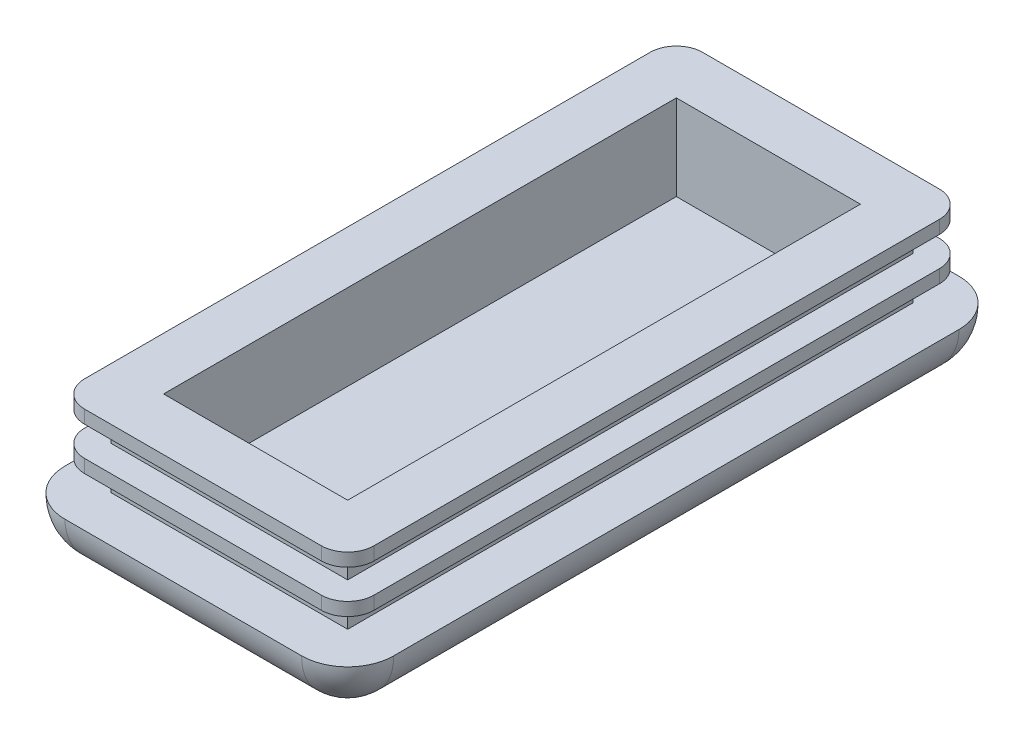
ISO-10303-21;
HEADER;
FILE_DESCRIPTION(('STEP AP214'),'2;1');
FILE_NAME('part.step','',(''),(''),'','','');
FILE_SCHEMA(('AUTOMOTIVE_DESIGN { 1 0 10303 214 1 1 1 1 }'));
ENDSEC;
DATA;
#1=APPLICATION_CONTEXT('core data for automotive mechanical design processes');
#2=APPLICATION_PROTOCOL_DEFINITION('international standard','automotive_design',2000,#1);
#3=PRODUCT_CONTEXT('',#1,'mechanical');
#4=PRODUCT('Part','Part','',(#3));
#5=PRODUCT_RELATED_PRODUCT_CATEGORY('part','',(#4));
#6=PRODUCT_DEFINITION_FORMATION('','',#4);
#7=PRODUCT_DEFINITION_CONTEXT('part definition',#1,'design');
#8=PRODUCT_DEFINITION('design','',#6,#7);
#9=PRODUCT_DEFINITION_SHAPE('','',#8);
#10=(LENGTH_UNIT() NAMED_UNIT(*) SI_UNIT(.MILLI.,.METRE.));
#11=(NAMED_UNIT(*) PLANE_ANGLE_UNIT() SI_UNIT($,.RADIAN.));
#12=(NAMED_UNIT(*) SI_UNIT($,.STERADIAN.) SOLID_ANGLE_UNIT());
#13=UNCERTAINTY_MEASURE_WITH_UNIT(LENGTH_MEASURE(1.E-05),#10,'distance_accuracy_value','');
#14=(GEOMETRIC_REPRESENTATION_CONTEXT(3) GLOBAL_UNCERTAINTY_ASSIGNED_CONTEXT((#13)) GLOBAL_UNIT_ASSIGNED_CONTEXT((#10,
#11,#12)) REPRESENTATION_CONTEXT('',''));
#15=CARTESIAN_POINT('',(0.,0.,0.));
#16=DIRECTION('',(0.,0.,1.));
#17=DIRECTION('',(1.,0.,0.));
#18=AXIS2_PLACEMENT_3D('',#15,#16,#17);
#19=CARTESIAN_POINT('',(0.,0.,0.));
#20=DIRECTION('',(0.,1.,0.));
#21=DIRECTION('',(0.,0.,1.));
#22=AXIS2_PLACEMENT_3D('',#19,#20,#21);
#23=PLANE('',#22);
#24=DIRECTION('',(0.,0.,-1.));
#25=VECTOR('',#24,1.);
#26=CARTESIAN_POINT('',(-7.,0.,19.5));
#27=LINE('',#26,#25);
#28=CARTESIAN_POINT('',(-7.,0.,19.5));
#29=VERTEX_POINT('',#28);
#30=CARTESIAN_POINT('',(-7.,0.,-19.5));
#31=VERTEX_POINT('',#30);
#32=EDGE_CURVE('E279',#29,#31,#27,.T.);
#33=ORIENTED_EDGE('',*,*,#32,.F.);
#34=DIRECTION('',(-1.,0.,0.));
#35=VECTOR('',#34,1.);
#36=CARTESIAN_POINT('',(7.,0.,19.5));
#37=LINE('',#36,#35);
#38=CARTESIAN_POINT('',(7.,0.,19.5));
#39=VERTEX_POINT('',#38);
#40=EDGE_CURVE('E284',#39,#29,#37,.T.);
#41=ORIENTED_EDGE('',*,*,#40,.F.);
#42=DIRECTION('',(0.,0.,1.));
#43=VECTOR('',#42,1.);
#44=CARTESIAN_POINT('',(7.,0.,-19.5));
#45=LINE('',#44,#43);
#46=CARTESIAN_POINT('',(7.,0.,-19.5));
#47=VERTEX_POINT('',#46);
#48=EDGE_CURVE('E268',#47,#39,#45,.T.);
#49=ORIENTED_EDGE('',*,*,#48,.F.);
#50=DIRECTION('',(1.,0.,0.));
#51=VECTOR('',#50,1.);
#52=CARTESIAN_POINT('',(-7.,0.,-19.5));
#53=LINE('',#52,#51);
#54=EDGE_CURVE('E274',#31,#47,#53,.T.);
#55=ORIENTED_EDGE('',*,*,#54,.F.);
#56=EDGE_LOOP('',(#33,#41,#49,#55));
#57=FACE_BOUND('',#56,.T.);
#58=ADVANCED_FACE('F16',(#57),#23,.T.);
#59=CARTESIAN_POINT('',(7.,0.,19.5));
#60=DIRECTION('',(0.,0.,-1.));
#61=DIRECTION('',(-1.,0.,0.));
#62=AXIS2_PLACEMENT_3D('',#59,#60,#61);
#63=PLANE('',#62);
#64=ORIENTED_EDGE('',*,*,#40,.T.);
#65=DIRECTION('',(0.,1.,0.));
#66=VECTOR('',#65,1.);
#67=CARTESIAN_POINT('',(-7.,0.,19.5));
#68=LINE('',#67,#66);
#69=CARTESIAN_POINT('',(-7.,6.5,19.5));
#70=VERTEX_POINT('',#69);
#71=EDGE_CURVE('E281',#70,#29,#68,.F.);
#72=ORIENTED_EDGE('',*,*,#71,.F.);
#73=DIRECTION('',(1.,0.,0.));
#74=VECTOR('',#73,1.);
#75=CARTESIAN_POINT('',(0.,6.5,19.5));
#76=LINE('',#75,#74);
#77=CARTESIAN_POINT('',(7.,6.5,19.5));
#78=VERTEX_POINT('',#77);
#79=EDGE_CURVE('E267',#78,#70,#76,.F.);
#80=ORIENTED_EDGE('',*,*,#79,.F.);
#81=DIRECTION('',(0.,1.,0.));
#82=VECTOR('',#81,1.);
#83=CARTESIAN_POINT('',(7.,0.,19.5));
#84=LINE('',#83,#82);
#85=EDGE_CURVE('E264',#39,#78,#84,.T.);
#86=ORIENTED_EDGE('',*,*,#85,.F.);
#87=EDGE_LOOP('',(#64,#72,#80,#86));
#88=FACE_BOUND('',#87,.T.);
#89=ADVANCED_FACE('F838',(#88),#63,.T.);
#90=CARTESIAN_POINT('',(-7.,0.,19.5));
#91=DIRECTION('',(1.,0.,0.));
#92=DIRECTION('',(0.,0.,-1.));
#93=AXIS2_PLACEMENT_3D('',#90,#91,#92);
#94=PLANE('',#93);
#95=ORIENTED_EDGE('',*,*,#32,.T.);
#96=DIRECTION('',(0.,1.,0.));
#97=VECTOR('',#96,1.);
#98=CARTESIAN_POINT('',(-7.,0.,-19.5));
#99=LINE('',#98,#97);
#100=CARTESIAN_POINT('',(-7.,6.5,-19.5));
#101=VERTEX_POINT('',#100);
#102=EDGE_CURVE('E276',#101,#31,#99,.F.);
#103=ORIENTED_EDGE('',*,*,#102,.F.);
#104=DIRECTION('',(0.,0.,1.));
#105=VECTOR('',#104,1.);
#106=CARTESIAN_POINT('',(-7.,6.5,0.));
#107=LINE('',#106,#105);
#108=EDGE_CURVE('E853',#70,#101,#107,.F.);
#109=ORIENTED_EDGE('',*,*,#108,.F.);
#110=ORIENTED_EDGE('',*,*,#71,.T.);
#111=EDGE_LOOP('',(#95,#103,#109,#110));
#112=FACE_BOUND('',#111,.T.);
#113=ADVANCED_FACE('F835',(#112),#94,.T.);
#114=CARTESIAN_POINT('',(-7.,0.,-19.5));
#115=DIRECTION('',(0.,0.,1.));
#116=DIRECTION('',(1.,0.,0.));
#117=AXIS2_PLACEMENT_3D('',#114,#115,#116);
#118=PLANE('',#117);
#119=ORIENTED_EDGE('',*,*,#54,.T.);
#120=DIRECTION('',(0.,1.,0.));
#121=VECTOR('',#120,1.);
#122=CARTESIAN_POINT('',(7.,0.,-19.5));
#123=LINE('',#122,#121);
#124=CARTESIAN_POINT('',(7.,6.5,-19.5));
#125=VERTEX_POINT('',#124);
#126=EDGE_CURVE('E271',#125,#47,#123,.F.);
#127=ORIENTED_EDGE('',*,*,#126,.F.);
#128=DIRECTION('',(1.,0.,0.));
#129=VECTOR('',#128,1.);
#130=CARTESIAN_POINT('',(0.,6.5,-19.5));
#131=LINE('',#130,#129);
#132=EDGE_CURVE('E857',#101,#125,#131,.T.);
#133=ORIENTED_EDGE('',*,*,#132,.F.);
#134=ORIENTED_EDGE('',*,*,#102,.T.);
#135=EDGE_LOOP('',(#119,#127,#133,#134));
#136=FACE_BOUND('',#135,.T.);
#137=ADVANCED_FACE('F831',(#136),#118,.T.);
#138=CARTESIAN_POINT('',(7.,0.,-19.5));
#139=DIRECTION('',(-1.,0.,0.));
#140=DIRECTION('',(0.,0.,1.));
#141=AXIS2_PLACEMENT_3D('',#138,#139,#140);
#142=PLANE('',#141);
#143=ORIENTED_EDGE('',*,*,#48,.T.);
#144=ORIENTED_EDGE('',*,*,#85,.T.);
#145=DIRECTION('',(0.,0.,1.));
#146=VECTOR('',#145,1.);
#147=CARTESIAN_POINT('',(7.,6.5,0.));
#148=LINE('',#147,#146);
#149=EDGE_CURVE('E245',#125,#78,#148,.T.);
#150=ORIENTED_EDGE('',*,*,#149,.F.);
#151=ORIENTED_EDGE('',*,*,#126,.T.);
#152=EDGE_LOOP('',(#143,#144,#150,#151));
#153=FACE_BOUND('',#152,.T.);
#154=ADVANCED_FACE('F821',(#153),#142,.T.);
#155=CARTESIAN_POINT('',(0.,6.5,0.));
#156=DIRECTION('',(0.,1.,0.));
#157=DIRECTION('',(0.,0.,1.));
#158=AXIS2_PLACEMENT_3D('',#155,#156,#157);
#159=PLANE('',#158);
#160=ORIENTED_EDGE('',*,*,#132,.T.);
#161=ORIENTED_EDGE('',*,*,#149,.T.);
#162=ORIENTED_EDGE('',*,*,#79,.T.);
#163=ORIENTED_EDGE('',*,*,#108,.T.);
#164=EDGE_LOOP('',(#160,#161,#162,#163));
#165=FACE_BOUND('',#164,.T.);
#166=CARTESIAN_POINT('',(-9.,6.5,23.5));
#167=CARTESIAN_POINT('',(-9.05625056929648,6.5,23.5000001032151));
#168=CARTESIAN_POINT('',(-9.11247489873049,6.5,23.497632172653));
#169=CARTESIAN_POINT('',(-9.22452319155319,6.5,23.4881767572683));
#170=CARTESIAN_POINT('',(-9.28034716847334,6.5,23.4810894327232));
#171=CARTESIAN_POINT('',(-9.44651010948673,6.5,23.4528056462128));
#172=CARTESIAN_POINT('',(-9.55573765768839,6.5,23.4245872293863));
#173=CARTESIAN_POINT('',(-9.76789974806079,6.5,23.350194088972));
#174=CARTESIAN_POINT('',(-9.87083086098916,6.5,23.3040096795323));
#175=CARTESIAN_POINT('',(-10.0674780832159,6.5,23.1950212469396));
#176=CARTESIAN_POINT('',(-10.1611955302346,6.5,23.132219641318));
#177=CARTESIAN_POINT('',(-10.3367725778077,6.5,22.991794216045));
#178=CARTESIAN_POINT('',(-10.4186319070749,6.5,22.9141700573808));
#179=CARTESIAN_POINT('',(-10.5681967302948,6.5,22.7462799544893));
#180=CARTESIAN_POINT('',(-10.6358995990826,6.5,22.6560116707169));
#181=CARTESIAN_POINT('',(-10.7552843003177,6.5,22.4652612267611));
#182=CARTESIAN_POINT('',(-10.8069422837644,6.5,22.3647641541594));
#183=CARTESIAN_POINT('',(-10.8925869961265,6.5,22.1565300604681));
#184=CARTESIAN_POINT('',(-10.9265841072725,6.5,22.0487973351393));
#185=CARTESIAN_POINT('',(-10.9674768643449,6.5,21.86700056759));
#186=CARTESIAN_POINT('',(-10.9796705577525,6.5,21.7940839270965));
#187=CARTESIAN_POINT('',(-10.995931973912,6.5,21.647454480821));
#188=CARTESIAN_POINT('',(-11.000011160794,6.5,21.5737429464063));
#189=CARTESIAN_POINT('',(-11.,6.5,21.5));
#190=B_SPLINE_CURVE_WITH_KNOTS('',3,(#166,#167,#168,#169,#170,#171,#172,#173,#174,#175,#176,
#177,#178,#179,#180,#181,#182,#183,#184,#185,#186,#187,#188,#189),.UNSPECIFIED.,.F.,.F.,(4,2,2,
2,2,2,2,2,2,2,2,4),(0.,0.168649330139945,0.337292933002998,0.673994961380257,1.01087876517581,
1.34771358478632,1.68455610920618,2.02146104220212,2.35886437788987,2.69606914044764,
2.91743597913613,3.13848984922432),.UNSPECIFIED.);
#191=CARTESIAN_POINT('',(-9.,6.5,23.5));
#192=VERTEX_POINT('',#191);
#193=CARTESIAN_POINT('',(-11.,6.5,21.5));
#194=VERTEX_POINT('',#193);
#195=EDGE_CURVE('E781',#192,#194,#190,.T.);
#196=ORIENTED_EDGE('',*,*,#195,.F.);
#197=DIRECTION('',(1.,0.,0.));
#198=VECTOR('',#197,1.);
#199=CARTESIAN_POINT('',(9.,6.5,23.5));
#200=LINE('',#199,#198);
#201=CARTESIAN_POINT('',(9.,6.5,23.5));
#202=VERTEX_POINT('',#201);
#203=EDGE_CURVE('E242',#202,#192,#200,.F.);
#204=ORIENTED_EDGE('',*,*,#203,.F.);
#205=CARTESIAN_POINT('',(11.,6.5,21.5));
#206=CARTESIAN_POINT('',(11.0000001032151,6.5,21.5562505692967));
#207=CARTESIAN_POINT('',(10.9976321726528,6.5,21.612474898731));
#208=CARTESIAN_POINT('',(10.9881767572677,6.5,21.7245231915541));
#209=CARTESIAN_POINT('',(10.9810894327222,6.5,21.7803471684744));
#210=CARTESIAN_POINT('',(10.9528056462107,6.5,21.9465101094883));
#211=CARTESIAN_POINT('',(10.9245872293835,6.5,22.0557376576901));
#212=CARTESIAN_POINT('',(10.8501940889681,6.5,22.2678997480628));
#213=CARTESIAN_POINT('',(10.8040096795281,6.5,22.3708308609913));
#214=CARTESIAN_POINT('',(10.6950212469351,6.5,22.5674780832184));
#215=CARTESIAN_POINT('',(10.6322196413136,6.5,22.6611955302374));
#216=CARTESIAN_POINT('',(10.4917942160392,6.5,22.8367725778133));
#217=CARTESIAN_POINT('',(10.4141700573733,6.5,22.9186319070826));
#218=CARTESIAN_POINT('',(10.2462799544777,6.5,23.0681967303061));
#219=CARTESIAN_POINT('',(10.1560116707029,6.5,23.1358995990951));
#220=CARTESIAN_POINT('',(9.96526122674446,6.5,23.25528430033));
#221=CARTESIAN_POINT('',(9.86476415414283,6.5,23.3069422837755));
#222=CARTESIAN_POINT('',(9.65653006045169,6.5,23.3925869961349));
#223=CARTESIAN_POINT('',(9.54879733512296,6.5,23.4265841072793));
#224=CARTESIAN_POINT('',(9.36700056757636,6.5,23.4674768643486));
#225=CARTESIAN_POINT('',(9.29408392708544,6.5,23.4796705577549));
#226=CARTESIAN_POINT('',(9.14745448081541,6.5,23.4959319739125));
#227=CARTESIAN_POINT('',(9.07374294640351,6.5,23.500011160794));
#228=CARTESIAN_POINT('',(9.00000000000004,6.5,23.5));
#229=B_SPLINE_CURVE_WITH_KNOTS('',3,(#205,#206,#207,#208,#209,#210,#211,#212,#213,#214,#215,
#216,#217,#218,#219,#220,#221,#222,#223,#224,#225,#226,#227,#228),.UNSPECIFIED.,.F.,.F.,(4,2,2,
2,2,2,2,2,2,2,2,4),(0.,0.168649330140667,0.337292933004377,0.673994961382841,1.01087876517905,
1.34771358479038,1.6845561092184,2.0214610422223,2.35886437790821,2.69606914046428,
2.91743597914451,3.13848984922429),.UNSPECIFIED.);
#230=CARTESIAN_POINT('',(11.,6.5,21.5));
#231=VERTEX_POINT('',#230);
#232=EDGE_CURVE('E23',#231,#202,#229,.T.);
#233=ORIENTED_EDGE('',*,*,#232,.F.);
#234=DIRECTION('',(0.,0.,-1.));
#235=VECTOR('',#234,1.);
#236=CARTESIAN_POINT('',(11.,6.5,-21.5));
#237=LINE('',#236,#235);
#238=CARTESIAN_POINT('',(11.,6.5,-21.5));
#239=VERTEX_POINT('',#238);
#240=EDGE_CURVE('E239',#239,#231,#237,.F.);
#241=ORIENTED_EDGE('',*,*,#240,.F.);
#242=CARTESIAN_POINT('',(9.,6.5,-23.5));
#243=CARTESIAN_POINT('',(9.05625056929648,6.5,-23.5000001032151));
#244=CARTESIAN_POINT('',(9.11247489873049,6.5,-23.497632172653));
#245=CARTESIAN_POINT('',(9.22452319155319,6.5,-23.4881767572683));
#246=CARTESIAN_POINT('',(9.28034716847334,6.5,-23.4810894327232));
#247=CARTESIAN_POINT('',(9.44651010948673,6.5,-23.4528056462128));
#248=CARTESIAN_POINT('',(9.55573765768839,6.5,-23.4245872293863));
#249=CARTESIAN_POINT('',(9.76789974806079,6.5,-23.350194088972));
#250=CARTESIAN_POINT('',(9.87083086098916,6.5,-23.3040096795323));
#251=CARTESIAN_POINT('',(10.0674780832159,6.5,-23.1950212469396));
#252=CARTESIAN_POINT('',(10.1611955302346,6.5,-23.132219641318));
#253=CARTESIAN_POINT('',(10.3367725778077,6.5,-22.991794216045));
#254=CARTESIAN_POINT('',(10.4186319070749,6.5,-22.9141700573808));
#255=CARTESIAN_POINT('',(10.5681967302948,6.5,-22.7462799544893));
#256=CARTESIAN_POINT('',(10.6358995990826,6.5,-22.6560116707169));
#257=CARTESIAN_POINT('',(10.7552843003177,6.5,-22.4652612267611));
#258=CARTESIAN_POINT('',(10.8069422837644,6.5,-22.3647641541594));
#259=CARTESIAN_POINT('',(10.8925869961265,6.5,-22.1565300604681));
#260=CARTESIAN_POINT('',(10.9265841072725,6.5,-22.0487973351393));
#261=CARTESIAN_POINT('',(10.9674768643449,6.5,-21.86700056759));
#262=CARTESIAN_POINT('',(10.9796705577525,6.5,-21.7940839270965));
#263=CARTESIAN_POINT('',(10.995931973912,6.5,-21.647454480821));
#264=CARTESIAN_POINT('',(11.000011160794,6.5,-21.5737429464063));
#265=CARTESIAN_POINT('',(11.,6.5,-21.5));
#266=B_SPLINE_CURVE_WITH_KNOTS('',3,(#242,#243,#244,#245,#246,#247,#248,#249,#250,#251,#252,
#253,#254,#255,#256,#257,#258,#259,#260,#261,#262,#263,#264,#265),.UNSPECIFIED.,.F.,.F.,(4,2,2,
2,2,2,2,2,2,2,2,4),(0.,0.168649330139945,0.337292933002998,0.673994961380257,1.01087876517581,
1.34771358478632,1.68455610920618,2.02146104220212,2.35886437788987,2.69606914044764,
2.91743597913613,3.13848984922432),.UNSPECIFIED.);
#267=CARTESIAN_POINT('',(9.,6.5,-23.5));
#268=VERTEX_POINT('',#267);
#269=EDGE_CURVE('E253',#268,#239,#266,.T.);
#270=ORIENTED_EDGE('',*,*,#269,.F.);
#271=DIRECTION('',(-1.,0.,0.));
#272=VECTOR('',#271,1.);
#273=CARTESIAN_POINT('',(-9.,6.5,-23.5));
#274=LINE('',#273,#272);
#275=CARTESIAN_POINT('',(-9.,6.5,-23.5));
#276=VERTEX_POINT('',#275);
#277=EDGE_CURVE('E262',#276,#268,#274,.F.);
#278=ORIENTED_EDGE('',*,*,#277,.F.);
#279=CARTESIAN_POINT('',(-11.,6.5,-21.5));
#280=CARTESIAN_POINT('',(-11.0000001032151,6.5,-21.5562505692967));
#281=CARTESIAN_POINT('',(-10.9976321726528,6.5,-21.612474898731));
#282=CARTESIAN_POINT('',(-10.9881767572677,6.5,-21.7245231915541));
#283=CARTESIAN_POINT('',(-10.9810894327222,6.5,-21.7803471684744));
#284=CARTESIAN_POINT('',(-10.9528056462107,6.5,-21.9465101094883));
#285=CARTESIAN_POINT('',(-10.9245872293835,6.5,-22.0557376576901));
#286=CARTESIAN_POINT('',(-10.8501940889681,6.5,-22.2678997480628));
#287=CARTESIAN_POINT('',(-10.8040096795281,6.5,-22.3708308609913));
#288=CARTESIAN_POINT('',(-10.6950212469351,6.5,-22.5674780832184));
#289=CARTESIAN_POINT('',(-10.6322196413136,6.5,-22.6611955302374));
#290=CARTESIAN_POINT('',(-10.4917942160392,6.5,-22.8367725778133));
#291=CARTESIAN_POINT('',(-10.4141700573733,6.5,-22.9186319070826));
#292=CARTESIAN_POINT('',(-10.2462799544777,6.5,-23.0681967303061));
#293=CARTESIAN_POINT('',(-10.1560116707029,6.5,-23.1358995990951));
#294=CARTESIAN_POINT('',(-9.96526122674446,6.5,-23.25528430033));
#295=CARTESIAN_POINT('',(-9.86476415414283,6.5,-23.3069422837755));
#296=CARTESIAN_POINT('',(-9.65653006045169,6.5,-23.3925869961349));
#297=CARTESIAN_POINT('',(-9.54879733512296,6.5,-23.4265841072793));
#298=CARTESIAN_POINT('',(-9.36700056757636,6.5,-23.4674768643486));
#299=CARTESIAN_POINT('',(-9.29408392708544,6.5,-23.4796705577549));
#300=CARTESIAN_POINT('',(-9.14745448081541,6.5,-23.4959319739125));
#301=CARTESIAN_POINT('',(-9.07374294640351,6.5,-23.500011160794));
#302=CARTESIAN_POINT('',(-9.00000000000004,6.5,-23.5));
#303=B_SPLINE_CURVE_WITH_KNOTS('',3,(#279,#280,#281,#282,#283,#284,#285,#286,#287,#288,#289,
#290,#291,#292,#293,#294,#295,#296,#297,#298,#299,#300,#301,#302),.UNSPECIFIED.,.F.,.F.,(4,2,2,
2,2,2,2,2,2,2,2,4),(0.,0.168649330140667,0.337292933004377,0.673994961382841,1.01087876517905,
1.34771358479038,1.6845561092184,2.0214610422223,2.35886437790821,2.69606914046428,
2.91743597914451,3.13848984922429),.UNSPECIFIED.);
#304=CARTESIAN_POINT('',(-11.,6.5,-21.5));
#305=VERTEX_POINT('',#304);
#306=EDGE_CURVE('E804',#305,#276,#303,.T.);
#307=ORIENTED_EDGE('',*,*,#306,.F.);
#308=DIRECTION('',(0.,0.,1.));
#309=VECTOR('',#308,1.);
#310=CARTESIAN_POINT('',(-11.,6.5,21.5));
#311=LINE('',#310,#309);
#312=EDGE_CURVE('E785',#194,#305,#311,.F.);
#313=ORIENTED_EDGE('',*,*,#312,.F.);
#314=EDGE_LOOP('',(#196,#204,#233,#241,#270,#278,#307,#313));
#315=FACE_BOUND('',#314,.T.);
#316=ADVANCED_FACE('F237',(#165,#315),#159,.T.);
#317=CARTESIAN_POINT('',(11.,6.5,21.5));
#318=CARTESIAN_POINT('',(11.,6.5,22.1283185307));
#319=CARTESIAN_POINT('',(10.7539699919,6.5,22.7572232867));
#320=CARTESIAN_POINT('',(10.2572232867,6.5,23.2539699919));
#321=CARTESIAN_POINT('',(9.62831853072,6.5,23.5));
#322=CARTESIAN_POINT('',(9.,6.5,23.5));
#323=(BOUNDED_CURVE() B_SPLINE_CURVE(5,(#317,#318,#319,#320,#321,#322),.UNSPECIFIED.,.F.,
.F.) B_SPLINE_CURVE_WITH_KNOTS((6,6),(0.,3.30977536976),
.UNSPECIFIED.) CURVE() GEOMETRIC_REPRESENTATION_ITEM() RATIONAL_B_SPLINE_CURVE((1.,1.,1.,1.,1.,1.)) REPRESENTATION_ITEM(''));
#324=DIRECTION('',(0.,-1.,0.));
#325=VECTOR('',#324,1.);
#326=SURFACE_OF_LINEAR_EXTRUSION('',#323,#325);
#327=ORIENTED_EDGE('',*,*,#232,.T.);
#328=DIRECTION('',(0.,1.,0.));
#329=VECTOR('',#328,1.);
#330=CARTESIAN_POINT('',(9.,6.5,23.5));
#331=LINE('',#330,#329);
#332=CARTESIAN_POINT('',(9.,5.5,23.5));
#333=VERTEX_POINT('',#332);
#334=EDGE_CURVE('E773',#333,#202,#331,.T.);
#335=ORIENTED_EDGE('',*,*,#334,.F.);
#336=CARTESIAN_POINT('',(9.,5.5,23.5));
#337=CARTESIAN_POINT('',(9.05625056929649,5.5,23.5000001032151));
#338=CARTESIAN_POINT('',(9.1124748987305,5.5,23.497632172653));
#339=CARTESIAN_POINT('',(9.2245231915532,5.5,23.4881767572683));
#340=CARTESIAN_POINT('',(9.28034716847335,5.5,23.4810894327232));
#341=CARTESIAN_POINT('',(9.44651010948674,5.5,23.4528056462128));
#342=CARTESIAN_POINT('',(9.5557376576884,5.5,23.4245872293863));
#343=CARTESIAN_POINT('',(9.7678997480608,5.5,23.350194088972));
#344=CARTESIAN_POINT('',(9.87083086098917,5.5,23.3040096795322));
#345=CARTESIAN_POINT('',(10.0674780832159,5.5,23.1950212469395));
#346=CARTESIAN_POINT('',(10.1611955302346,5.5,23.132219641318));
#347=CARTESIAN_POINT('',(10.3367725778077,5.5,22.9917942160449));
#348=CARTESIAN_POINT('',(10.4186319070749,5.5,22.9141700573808));
#349=CARTESIAN_POINT('',(10.5681967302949,5.5,22.7462799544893));
#350=CARTESIAN_POINT('',(10.6358995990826,5.5,22.6560116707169));
#351=CARTESIAN_POINT('',(10.7552843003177,5.5,22.4652612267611));
#352=CARTESIAN_POINT('',(10.8069422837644,5.5,22.3647641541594));
#353=CARTESIAN_POINT('',(10.8925869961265,5.5,22.1565300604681));
#354=CARTESIAN_POINT('',(10.9265841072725,5.50000000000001,22.0487973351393));
#355=CARTESIAN_POINT('',(10.9674768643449,5.50000000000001,21.86700056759));
#356=CARTESIAN_POINT('',(10.9796705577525,5.5,21.7940839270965));
#357=CARTESIAN_POINT('',(10.995931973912,5.5,21.647454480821));
#358=CARTESIAN_POINT('',(11.000011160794,5.49999999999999,21.5737429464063));
#359=CARTESIAN_POINT('',(11.,5.49999999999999,21.5));
#360=B_SPLINE_CURVE_WITH_KNOTS('',3,(#336,#337,#338,#339,#340,#341,#342,#343,#344,#345,#346,
#347,#348,#349,#350,#351,#352,#353,#354,#355,#356,#357,#358,#359),.UNSPECIFIED.,.F.,.F.,(4,2,2,
2,2,2,2,2,2,2,2,4),(0.,0.168649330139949,0.337292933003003,0.673994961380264,1.01087876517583,
1.34771358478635,1.6845561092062,2.02146104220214,2.35886437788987,2.69606914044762,
2.91743597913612,3.13848984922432),.UNSPECIFIED.);
#361=CARTESIAN_POINT('',(11.,5.5,21.5));
#362=VERTEX_POINT('',#361);
#363=EDGE_CURVE('E250',#333,#362,#360,.T.);
#364=ORIENTED_EDGE('',*,*,#363,.T.);
#365=DIRECTION('',(0.,1.,0.));
#366=VECTOR('',#365,1.);
#367=CARTESIAN_POINT('',(11.,6.5,21.5));
#368=LINE('',#367,#366);
#369=EDGE_CURVE('E247',#231,#362,#368,.F.);
#370=ORIENTED_EDGE('',*,*,#369,.F.);
#371=EDGE_LOOP('',(#327,#335,#364,#370));
#372=FACE_BOUND('',#371,.T.);
#373=ADVANCED_FACE('F248',(#372),#326,.T.);
#374=CARTESIAN_POINT('',(11.,6.5,-21.5));
#375=DIRECTION('',(1.,0.,0.));
#376=DIRECTION('',(0.,0.,-1.));
#377=AXIS2_PLACEMENT_3D('',#374,#375,#376);
#378=PLANE('',#377);
#379=ORIENTED_EDGE('',*,*,#240,.T.);
#380=ORIENTED_EDGE('',*,*,#369,.T.);
#381=DIRECTION('',(0.,0.,1.));
#382=VECTOR('',#381,1.);
#383=CARTESIAN_POINT('',(11.,5.5,0.));
#384=LINE('',#383,#382);
#385=CARTESIAN_POINT('',(11.,5.5,-21.5));
#386=VERTEX_POINT('',#385);
#387=EDGE_CURVE('E882',#362,#386,#384,.F.);
#388=ORIENTED_EDGE('',*,*,#387,.T.);
#389=DIRECTION('',(0.,-1.,0.));
#390=VECTOR('',#389,1.);
#391=CARTESIAN_POINT('',(11.,6.5,-21.5));
#392=LINE('',#391,#390);
#393=EDGE_CURVE('E257',#239,#386,#392,.T.);
#394=ORIENTED_EDGE('',*,*,#393,.F.);
#395=EDGE_LOOP('',(#379,#380,#388,#394));
#396=FACE_BOUND('',#395,.T.);
#397=ADVANCED_FACE('F255',(#396),#378,.T.);
#398=CARTESIAN_POINT('',(9.,6.5,-23.5));
#399=CARTESIAN_POINT('',(9.62831853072,6.5,-23.5));
#400=CARTESIAN_POINT('',(10.2572232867,6.5,-23.2539699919));
#401=CARTESIAN_POINT('',(10.7539699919,6.5,-22.7572232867));
#402=CARTESIAN_POINT('',(11.,6.5,-22.1283185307));
#403=CARTESIAN_POINT('',(11.,6.5,-21.5));
#404=(BOUNDED_CURVE() B_SPLINE_CURVE(5,(#398,#399,#400,#401,#402,#403),.UNSPECIFIED.,.F.,
.F.) B_SPLINE_CURVE_WITH_KNOTS((6,6),(0.,3.30977536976),
.UNSPECIFIED.) CURVE() GEOMETRIC_REPRESENTATION_ITEM() RATIONAL_B_SPLINE_CURVE((1.,1.,1.,1.,1.,1.)) REPRESENTATION_ITEM(''));
#405=DIRECTION('',(0.,-1.,0.));
#406=VECTOR('',#405,1.);
#407=SURFACE_OF_LINEAR_EXTRUSION('',#404,#406);
#408=ORIENTED_EDGE('',*,*,#269,.T.);
#409=ORIENTED_EDGE('',*,*,#393,.T.);
#410=CARTESIAN_POINT('',(11.,5.5,-21.5));
#411=CARTESIAN_POINT('',(11.0000001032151,5.5,-21.5562505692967));
#412=CARTESIAN_POINT('',(10.9976321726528,5.5,-21.612474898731));
#413=CARTESIAN_POINT('',(10.9881767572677,5.5,-21.7245231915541));
#414=CARTESIAN_POINT('',(10.9810894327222,5.5,-21.7803471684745));
#415=CARTESIAN_POINT('',(10.9528056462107,5.5,-21.9465101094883));
#416=CARTESIAN_POINT('',(10.9245872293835,5.5,-22.0557376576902));
#417=CARTESIAN_POINT('',(10.8501940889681,5.5,-22.2678997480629));
#418=CARTESIAN_POINT('',(10.804009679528,5.5,-22.3708308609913));
#419=CARTESIAN_POINT('',(10.6950212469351,5.5,-22.5674780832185));
#420=CARTESIAN_POINT('',(10.6322196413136,5.5,-22.6611955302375));
#421=CARTESIAN_POINT('',(10.4917942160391,5.5,-22.8367725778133));
#422=CARTESIAN_POINT('',(10.4141700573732,5.5,-22.9186319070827));
#423=CARTESIAN_POINT('',(10.2462799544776,5.5,-23.0681967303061));
#424=CARTESIAN_POINT('',(10.1560116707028,5.5,-23.1358995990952));
#425=CARTESIAN_POINT('',(9.96526122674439,5.5,-23.25528430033));
#426=CARTESIAN_POINT('',(9.86476415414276,5.5,-23.3069422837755));
#427=CARTESIAN_POINT('',(9.65653006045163,5.5,-23.3925869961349));
#428=CARTESIAN_POINT('',(9.5487973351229,5.5,-23.4265841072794));
#429=CARTESIAN_POINT('',(9.36700056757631,5.5,-23.4674768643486));
#430=CARTESIAN_POINT('',(9.2940839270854,5.5,-23.4796705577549));
#431=CARTESIAN_POINT('',(9.14745448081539,5.5,-23.4959319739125));
#432=CARTESIAN_POINT('',(9.07374294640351,5.5,-23.500011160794));
#433=CARTESIAN_POINT('',(9.00000000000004,5.5,-23.5));
#434=B_SPLINE_CURVE_WITH_KNOTS('',3,(#410,#411,#412,#413,#414,#415,#416,#417,#418,#419,#420,
#421,#422,#423,#424,#425,#426,#427,#428,#429,#430,#431,#432,#433),.UNSPECIFIED.,.F.,.F.,(4,2,2,
2,2,2,2,2,2,2,2,4),(0.,0.168649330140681,0.337292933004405,0.673994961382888,1.01087876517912,
1.34771358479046,1.68455610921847,2.02146104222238,2.35886437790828,2.69606914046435,
2.91743597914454,3.13848984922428),.UNSPECIFIED.);
#435=CARTESIAN_POINT('',(9.,5.5,-23.5));
#436=VERTEX_POINT('',#435);
#437=EDGE_CURVE('E879',#386,#436,#434,.T.);
#438=ORIENTED_EDGE('',*,*,#437,.T.);
#439=DIRECTION('',(0.,1.,0.));
#440=VECTOR('',#439,1.);
#441=CARTESIAN_POINT('',(9.,6.5,-23.5));
#442=LINE('',#441,#440);
#443=EDGE_CURVE('E810',#268,#436,#442,.F.);
#444=ORIENTED_EDGE('',*,*,#443,.F.);
#445=EDGE_LOOP('',(#408,#409,#438,#444));
#446=FACE_BOUND('',#445,.T.);
#447=ADVANCED_FACE('F907',(#446),#407,.T.);
#448=CARTESIAN_POINT('',(-9.,6.5,-23.5));
#449=DIRECTION('',(0.,0.,-1.));
#450=DIRECTION('',(-1.,0.,0.));
#451=AXIS2_PLACEMENT_3D('',#448,#449,#450);
#452=PLANE('',#451);
#453=ORIENTED_EDGE('',*,*,#277,.T.);
#454=ORIENTED_EDGE('',*,*,#443,.T.);
#455=DIRECTION('',(1.,0.,0.));
#456=VECTOR('',#455,1.);
#457=CARTESIAN_POINT('',(0.,5.5,-23.5));
#458=LINE('',#457,#456);
#459=CARTESIAN_POINT('',(-9.,5.5,-23.5));
#460=VERTEX_POINT('',#459);
#461=EDGE_CURVE('E877',#436,#460,#458,.F.);
#462=ORIENTED_EDGE('',*,*,#461,.T.);
#463=DIRECTION('',(0.,-1.,0.));
#464=VECTOR('',#463,1.);
#465=CARTESIAN_POINT('',(-9.,6.5,-23.5));
#466=LINE('',#465,#464);
#467=EDGE_CURVE('E790',#276,#460,#466,.T.);
#468=ORIENTED_EDGE('',*,*,#467,.F.);
#469=EDGE_LOOP('',(#453,#454,#462,#468));
#470=FACE_BOUND('',#469,.T.);
#471=ADVANCED_FACE('F799',(#470),#452,.T.);
#472=CARTESIAN_POINT('',(-11.,6.5,-21.5));
#473=CARTESIAN_POINT('',(-11.,6.5,-22.1283185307));
#474=CARTESIAN_POINT('',(-10.7539699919,6.5,-22.7572232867));
#475=CARTESIAN_POINT('',(-10.2572232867,6.5,-23.2539699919));
#476=CARTESIAN_POINT('',(-9.62831853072,6.5,-23.5));
#477=CARTESIAN_POINT('',(-9.,6.5,-23.5));
#478=(BOUNDED_CURVE() B_SPLINE_CURVE(5,(#472,#473,#474,#475,#476,#477),.UNSPECIFIED.,.F.,
.F.) B_SPLINE_CURVE_WITH_KNOTS((6,6),(0.,3.30977536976),
.UNSPECIFIED.) CURVE() GEOMETRIC_REPRESENTATION_ITEM() RATIONAL_B_SPLINE_CURVE((1.,1.,1.,1.,1.,1.)) REPRESENTATION_ITEM(''));
#479=DIRECTION('',(0.,-1.,0.));
#480=VECTOR('',#479,1.);
#481=SURFACE_OF_LINEAR_EXTRUSION('',#478,#480);
#482=ORIENTED_EDGE('',*,*,#306,.T.);
#483=ORIENTED_EDGE('',*,*,#467,.T.);
#484=CARTESIAN_POINT('',(-9.,5.5,-23.5));
#485=CARTESIAN_POINT('',(-9.05625056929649,5.5,-23.5000001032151));
#486=CARTESIAN_POINT('',(-9.1124748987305,5.5,-23.497632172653));
#487=CARTESIAN_POINT('',(-9.2245231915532,5.5,-23.4881767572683));
#488=CARTESIAN_POINT('',(-9.28034716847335,5.5,-23.4810894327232));
#489=CARTESIAN_POINT('',(-9.44651010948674,5.5,-23.4528056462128));
#490=CARTESIAN_POINT('',(-9.5557376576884,5.5,-23.4245872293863));
#491=CARTESIAN_POINT('',(-9.7678997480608,5.5,-23.350194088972));
#492=CARTESIAN_POINT('',(-9.87083086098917,5.5,-23.3040096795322));
#493=CARTESIAN_POINT('',(-10.0674780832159,5.5,-23.1950212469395));
#494=CARTESIAN_POINT('',(-10.1611955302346,5.5,-23.132219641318));
#495=CARTESIAN_POINT('',(-10.3367725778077,5.5,-22.9917942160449));
#496=CARTESIAN_POINT('',(-10.4186319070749,5.5,-22.9141700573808));
#497=CARTESIAN_POINT('',(-10.5681967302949,5.5,-22.7462799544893));
#498=CARTESIAN_POINT('',(-10.6358995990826,5.5,-22.6560116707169));
#499=CARTESIAN_POINT('',(-10.7552843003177,5.5,-22.4652612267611));
#500=CARTESIAN_POINT('',(-10.8069422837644,5.5,-22.3647641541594));
#501=CARTESIAN_POINT('',(-10.8925869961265,5.5,-22.1565300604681));
#502=CARTESIAN_POINT('',(-10.9265841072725,5.50000000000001,-22.0487973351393));
#503=CARTESIAN_POINT('',(-10.9674768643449,5.50000000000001,-21.86700056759));
#504=CARTESIAN_POINT('',(-10.9796705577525,5.5,-21.7940839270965));
#505=CARTESIAN_POINT('',(-10.995931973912,5.5,-21.647454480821));
#506=CARTESIAN_POINT('',(-11.000011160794,5.49999999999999,-21.5737429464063));
#507=CARTESIAN_POINT('',(-11.,5.49999999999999,-21.5));
#508=B_SPLINE_CURVE_WITH_KNOTS('',3,(#484,#485,#486,#487,#488,#489,#490,#491,#492,#493,#494,
#495,#496,#497,#498,#499,#500,#501,#502,#503,#504,#505,#506,#507),.UNSPECIFIED.,.F.,.F.,(4,2,2,
2,2,2,2,2,2,2,2,4),(0.,0.168649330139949,0.337292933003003,0.673994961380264,1.01087876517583,
1.34771358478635,1.6845561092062,2.02146104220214,2.35886437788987,2.69606914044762,
2.91743597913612,3.13848984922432),.UNSPECIFIED.);
#509=CARTESIAN_POINT('',(-11.,5.5,-21.5));
#510=VERTEX_POINT('',#509);
#511=EDGE_CURVE('E749',#460,#510,#508,.T.);
#512=ORIENTED_EDGE('',*,*,#511,.T.);
#513=DIRECTION('',(0.,1.,0.));
#514=VECTOR('',#513,1.);
#515=CARTESIAN_POINT('',(-11.,6.5,-21.5));
#516=LINE('',#515,#514);
#517=EDGE_CURVE('E782',#305,#510,#516,.F.);
#518=ORIENTED_EDGE('',*,*,#517,.F.);
#519=EDGE_LOOP('',(#482,#483,#512,#518));
#520=FACE_BOUND('',#519,.T.);
#521=ADVANCED_FACE('F795',(#520),#481,.T.);
#522=CARTESIAN_POINT('',(-11.,6.5,21.5));
#523=DIRECTION('',(-1.,0.,0.));
#524=DIRECTION('',(0.,0.,1.));
#525=AXIS2_PLACEMENT_3D('',#522,#523,#524);
#526=PLANE('',#525);
#527=ORIENTED_EDGE('',*,*,#312,.T.);
#528=ORIENTED_EDGE('',*,*,#517,.T.);
#529=DIRECTION('',(0.,0.,1.));
#530=VECTOR('',#529,1.);
#531=CARTESIAN_POINT('',(-11.,5.5,0.));
#532=LINE('',#531,#530);
#533=CARTESIAN_POINT('',(-11.,5.5,21.5));
#534=VERTEX_POINT('',#533);
#535=EDGE_CURVE('E748',#510,#534,#532,.T.);
#536=ORIENTED_EDGE('',*,*,#535,.T.);
#537=DIRECTION('',(0.,-1.,0.));
#538=VECTOR('',#537,1.);
#539=CARTESIAN_POINT('',(-11.,6.5,21.5));
#540=LINE('',#539,#538);
#541=EDGE_CURVE('E775',#194,#534,#540,.T.);
#542=ORIENTED_EDGE('',*,*,#541,.F.);
#543=EDGE_LOOP('',(#527,#528,#536,#542));
#544=FACE_BOUND('',#543,.T.);
#545=ADVANCED_FACE('F765',(#544),#526,.T.);
#546=CARTESIAN_POINT('',(-9.,6.5,23.5));
#547=CARTESIAN_POINT('',(-9.62831853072,6.5,23.5));
#548=CARTESIAN_POINT('',(-10.2572232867,6.5,23.2539699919));
#549=CARTESIAN_POINT('',(-10.7539699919,6.5,22.7572232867));
#550=CARTESIAN_POINT('',(-11.,6.5,22.1283185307));
#551=CARTESIAN_POINT('',(-11.,6.5,21.5));
#552=(BOUNDED_CURVE() B_SPLINE_CURVE(5,(#546,#547,#548,#549,#550,#551),.UNSPECIFIED.,.F.,
.F.) B_SPLINE_CURVE_WITH_KNOTS((6,6),(0.,3.30977536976),
.UNSPECIFIED.) CURVE() GEOMETRIC_REPRESENTATION_ITEM() RATIONAL_B_SPLINE_CURVE((1.,1.,1.,1.,1.,1.)) REPRESENTATION_ITEM(''));
#553=DIRECTION('',(0.,-1.,0.));
#554=VECTOR('',#553,1.);
#555=SURFACE_OF_LINEAR_EXTRUSION('',#552,#554);
#556=ORIENTED_EDGE('',*,*,#195,.T.);
#557=ORIENTED_EDGE('',*,*,#541,.T.);
#558=CARTESIAN_POINT('',(-11.,5.5,21.5));
#559=CARTESIAN_POINT('',(-11.0000001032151,5.5,21.5562505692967));
#560=CARTESIAN_POINT('',(-10.9976321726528,5.5,21.612474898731));
#561=CARTESIAN_POINT('',(-10.9881767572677,5.5,21.7245231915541));
#562=CARTESIAN_POINT('',(-10.9810894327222,5.5,21.7803471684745));
#563=CARTESIAN_POINT('',(-10.9528056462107,5.5,21.9465101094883));
#564=CARTESIAN_POINT('',(-10.9245872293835,5.5,22.0557376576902));
#565=CARTESIAN_POINT('',(-10.8501940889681,5.5,22.2678997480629));
#566=CARTESIAN_POINT('',(-10.804009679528,5.5,22.3708308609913));
#567=CARTESIAN_POINT('',(-10.6950212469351,5.5,22.5674780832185));
#568=CARTESIAN_POINT('',(-10.6322196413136,5.5,22.6611955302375));
#569=CARTESIAN_POINT('',(-10.4917942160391,5.5,22.8367725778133));
#570=CARTESIAN_POINT('',(-10.4141700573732,5.5,22.9186319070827));
#571=CARTESIAN_POINT('',(-10.2462799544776,5.5,23.0681967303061));
#572=CARTESIAN_POINT('',(-10.1560116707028,5.5,23.1358995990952));
#573=CARTESIAN_POINT('',(-9.96526122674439,5.5,23.25528430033));
#574=CARTESIAN_POINT('',(-9.86476415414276,5.5,23.3069422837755));
#575=CARTESIAN_POINT('',(-9.65653006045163,5.5,23.3925869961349));
#576=CARTESIAN_POINT('',(-9.5487973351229,5.5,23.4265841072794));
#577=CARTESIAN_POINT('',(-9.36700056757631,5.5,23.4674768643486));
#578=CARTESIAN_POINT('',(-9.2940839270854,5.5,23.4796705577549));
#579=CARTESIAN_POINT('',(-9.14745448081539,5.5,23.4959319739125));
#580=CARTESIAN_POINT('',(-9.07374294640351,5.5,23.500011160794));
#581=CARTESIAN_POINT('',(-9.00000000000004,5.5,23.5));
#582=B_SPLINE_CURVE_WITH_KNOTS('',3,(#558,#559,#560,#561,#562,#563,#564,#565,#566,#567,#568,
#569,#570,#571,#572,#573,#574,#575,#576,#577,#578,#579,#580,#581),.UNSPECIFIED.,.F.,.F.,(4,2,2,
2,2,2,2,2,2,2,2,4),(0.,0.168649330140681,0.337292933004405,0.673994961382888,1.01087876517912,
1.34771358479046,1.68455610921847,2.02146104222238,2.35886437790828,2.69606914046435,
2.91743597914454,3.13848984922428),.UNSPECIFIED.);
#583=CARTESIAN_POINT('',(-9.,5.5,23.5));
#584=VERTEX_POINT('',#583);
#585=EDGE_CURVE('E740',#534,#584,#582,.T.);
#586=ORIENTED_EDGE('',*,*,#585,.T.);
#587=DIRECTION('',(0.,1.,0.));
#588=VECTOR('',#587,1.);
#589=CARTESIAN_POINT('',(-9.,6.5,23.5));
#590=LINE('',#589,#588);
#591=EDGE_CURVE('E885',#192,#584,#590,.F.);
#592=ORIENTED_EDGE('',*,*,#591,.F.);
#593=EDGE_LOOP('',(#556,#557,#586,#592));
#594=FACE_BOUND('',#593,.T.);
#595=ADVANCED_FACE('F759',(#594),#555,.T.);
#596=CARTESIAN_POINT('',(9.,6.5,23.5));
#597=DIRECTION('',(0.,0.,1.));
#598=DIRECTION('',(1.,0.,0.));
#599=AXIS2_PLACEMENT_3D('',#596,#597,#598);
#600=PLANE('',#599);
#601=ORIENTED_EDGE('',*,*,#203,.T.);
#602=ORIENTED_EDGE('',*,*,#591,.T.);
#603=DIRECTION('',(1.,0.,0.));
#604=VECTOR('',#603,1.);
#605=CARTESIAN_POINT('',(0.,5.5,23.5));
#606=LINE('',#605,#604);
#607=EDGE_CURVE('E747',#584,#333,#606,.T.);
#608=ORIENTED_EDGE('',*,*,#607,.T.);
#609=ORIENTED_EDGE('',*,*,#334,.T.);
#610=EDGE_LOOP('',(#601,#602,#608,#609));
#611=FACE_BOUND('',#610,.T.);
#612=ADVANCED_FACE('F764',(#611),#600,.T.);
#613=CARTESIAN_POINT('',(0.,5.5,0.));
#614=DIRECTION('',(0.,1.,0.));
#615=DIRECTION('',(0.,0.,1.));
#616=AXIS2_PLACEMENT_3D('',#613,#614,#615);
#617=PLANE('',#616);
#618=DIRECTION('',(0.,0.,1.));
#619=VECTOR('',#618,1.);
#620=CARTESIAN_POINT('',(9.,5.5,-21.5));
#621=LINE('',#620,#619);
#622=CARTESIAN_POINT('',(9.,5.5,21.5));
#623=VERTEX_POINT('',#622);
#624=CARTESIAN_POINT('',(9.,5.5,-21.5));
#625=VERTEX_POINT('',#624);
#626=EDGE_CURVE('E1301',#623,#625,#621,.F.);
#627=ORIENTED_EDGE('',*,*,#626,.T.);
#628=DIRECTION('',(1.,0.,0.));
#629=VECTOR('',#628,1.);
#630=CARTESIAN_POINT('',(-9.,5.5,-21.5));
#631=LINE('',#630,#629);
#632=CARTESIAN_POINT('',(-9.,5.5,-21.5));
#633=VERTEX_POINT('',#632);
#634=EDGE_CURVE('E1305',#625,#633,#631,.F.);
#635=ORIENTED_EDGE('',*,*,#634,.T.);
#636=DIRECTION('',(0.,0.,-1.));
#637=VECTOR('',#636,1.);
#638=CARTESIAN_POINT('',(-9.,5.5,21.5));
#639=LINE('',#638,#637);
#640=CARTESIAN_POINT('',(-9.,5.5,21.5));
#641=VERTEX_POINT('',#640);
#642=EDGE_CURVE('E1307',#633,#641,#639,.F.);
#643=ORIENTED_EDGE('',*,*,#642,.T.);
#644=DIRECTION('',(-1.,0.,0.));
#645=VECTOR('',#644,1.);
#646=CARTESIAN_POINT('',(9.,5.5,21.5));
#647=LINE('',#646,#645);
#648=EDGE_CURVE('E1294',#641,#623,#647,.F.);
#649=ORIENTED_EDGE('',*,*,#648,.T.);
#650=EDGE_LOOP('',(#627,#635,#643,#649));
#651=FACE_BOUND('',#650,.T.);
#652=ORIENTED_EDGE('',*,*,#585,.F.);
#653=ORIENTED_EDGE('',*,*,#535,.F.);
#654=ORIENTED_EDGE('',*,*,#511,.F.);
#655=ORIENTED_EDGE('',*,*,#461,.F.);
#656=ORIENTED_EDGE('',*,*,#437,.F.);
#657=ORIENTED_EDGE('',*,*,#387,.F.);
#658=ORIENTED_EDGE('',*,*,#363,.F.);
#659=ORIENTED_EDGE('',*,*,#607,.F.);
#660=EDGE_LOOP('',(#652,#653,#654,#655,#656,#657,#658,#659));
#661=FACE_BOUND('',#660,.T.);
#662=ADVANCED_FACE('F755',(#651,#661),#617,.F.);
#663=CARTESIAN_POINT('',(-9.,0.,21.5));
#664=DIRECTION('',(1.,0.,0.));
#665=DIRECTION('',(0.,0.,-1.));
#666=AXIS2_PLACEMENT_3D('',#663,#664,#665);
#667=PLANE('',#666);
#668=DIRECTION('',(0.,1.,0.));
#669=VECTOR('',#668,1.);
#670=CARTESIAN_POINT('',(-9.,0.,21.5));
#671=LINE('',#670,#669);
#672=CARTESIAN_POINT('',(-9.,3.25,21.5));
#673=VERTEX_POINT('',#672);
#674=EDGE_CURVE('E1296',#673,#641,#671,.T.);
#675=ORIENTED_EDGE('',*,*,#674,.T.);
#676=ORIENTED_EDGE('',*,*,#642,.F.);
#677=DIRECTION('',(0.,1.,0.));
#678=VECTOR('',#677,1.);
#679=CARTESIAN_POINT('',(-9.,0.,-21.5));
#680=LINE('',#679,#678);
#681=CARTESIAN_POINT('',(-9.,3.25,-21.5));
#682=VERTEX_POINT('',#681);
#683=EDGE_CURVE('E1303',#633,#682,#680,.F.);
#684=ORIENTED_EDGE('',*,*,#683,.T.);
#685=DIRECTION('',(0.,0.,1.));
#686=VECTOR('',#685,1.);
#687=CARTESIAN_POINT('',(-9.,3.25,0.));
#688=LINE('',#687,#686);
#689=EDGE_CURVE('E1283',#673,#682,#688,.F.);
#690=ORIENTED_EDGE('',*,*,#689,.F.);
#691=EDGE_LOOP('',(#675,#676,#684,#690));
#692=FACE_BOUND('',#691,.T.);
#693=ADVANCED_FACE('F1016',(#692),#667,.F.);
#694=CARTESIAN_POINT('',(-9.,0.,-21.5));
#695=DIRECTION('',(0.,0.,1.));
#696=DIRECTION('',(1.,0.,0.));
#697=AXIS2_PLACEMENT_3D('',#694,#695,#696);
#698=PLANE('',#697);
#699=ORIENTED_EDGE('',*,*,#683,.F.);
#700=ORIENTED_EDGE('',*,*,#634,.F.);
#701=DIRECTION('',(0.,1.,0.));
#702=VECTOR('',#701,1.);
#703=CARTESIAN_POINT('',(9.,0.,-21.5));
#704=LINE('',#703,#702);
#705=CARTESIAN_POINT('',(9.,3.25,-21.5));
#706=VERTEX_POINT('',#705);
#707=EDGE_CURVE('E1299',#625,#706,#704,.F.);
#708=ORIENTED_EDGE('',*,*,#707,.T.);
#709=DIRECTION('',(1.,0.,0.));
#710=VECTOR('',#709,1.);
#711=CARTESIAN_POINT('',(0.,3.25,-21.5));
#712=LINE('',#711,#710);
#713=EDGE_CURVE('E1280',#682,#706,#712,.T.);
#714=ORIENTED_EDGE('',*,*,#713,.F.);
#715=EDGE_LOOP('',(#699,#700,#708,#714));
#716=FACE_BOUND('',#715,.T.);
#717=ADVANCED_FACE('F1024',(#716),#698,.F.);
#718=CARTESIAN_POINT('',(9.,0.,-21.5));
#719=DIRECTION('',(-1.,0.,0.));
#720=DIRECTION('',(0.,0.,1.));
#721=AXIS2_PLACEMENT_3D('',#718,#719,#720);
#722=PLANE('',#721);
#723=ORIENTED_EDGE('',*,*,#707,.F.);
#724=ORIENTED_EDGE('',*,*,#626,.F.);
#725=DIRECTION('',(0.,1.,0.));
#726=VECTOR('',#725,1.);
#727=CARTESIAN_POINT('',(9.,0.,21.5));
#728=LINE('',#727,#726);
#729=CARTESIAN_POINT('',(9.,3.25,21.5));
#730=VERTEX_POINT('',#729);
#731=EDGE_CURVE('E1286',#623,#730,#728,.F.);
#732=ORIENTED_EDGE('',*,*,#731,.T.);
#733=DIRECTION('',(0.,0.,1.));
#734=VECTOR('',#733,1.);
#735=CARTESIAN_POINT('',(9.,3.25,0.));
#736=LINE('',#735,#734);
#737=EDGE_CURVE('E1277',#706,#730,#736,.T.);
#738=ORIENTED_EDGE('',*,*,#737,.F.);
#739=EDGE_LOOP('',(#723,#724,#732,#738));
#740=FACE_BOUND('',#739,.T.);
#741=ADVANCED_FACE('F1032',(#740),#722,.F.);
#742=CARTESIAN_POINT('',(9.,0.,21.5));
#743=DIRECTION('',(0.,0.,-1.));
#744=DIRECTION('',(-1.,0.,0.));
#745=AXIS2_PLACEMENT_3D('',#742,#743,#744);
#746=PLANE('',#745);
#747=ORIENTED_EDGE('',*,*,#731,.F.);
#748=ORIENTED_EDGE('',*,*,#648,.F.);
#749=ORIENTED_EDGE('',*,*,#674,.F.);
#750=DIRECTION('',(1.,0.,0.));
#751=VECTOR('',#750,1.);
#752=CARTESIAN_POINT('',(0.,3.25,21.5));
#753=LINE('',#752,#751);
#754=EDGE_CURVE('E739',#730,#673,#753,.F.);
#755=ORIENTED_EDGE('',*,*,#754,.F.);
#756=EDGE_LOOP('',(#747,#748,#749,#755));
#757=FACE_BOUND('',#756,.T.);
#758=ADVANCED_FACE('F718',(#757),#746,.F.);
#759=CARTESIAN_POINT('',(0.,3.25,0.));
#760=DIRECTION('',(0.,1.,0.));
#761=DIRECTION('',(0.,0.,1.));
#762=AXIS2_PLACEMENT_3D('',#759,#760,#761);
#763=PLANE('',#762);
#764=ORIENTED_EDGE('',*,*,#737,.T.);
#765=ORIENTED_EDGE('',*,*,#754,.T.);
#766=ORIENTED_EDGE('',*,*,#689,.T.);
#767=ORIENTED_EDGE('',*,*,#713,.T.);
#768=EDGE_LOOP('',(#764,#765,#766,#767));
#769=FACE_BOUND('',#768,.T.);
#770=CARTESIAN_POINT('',(-9.,3.25,23.5));
#771=CARTESIAN_POINT('',(-9.05625056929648,3.25,23.5000001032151));
#772=CARTESIAN_POINT('',(-9.11247489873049,3.25,23.497632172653));
#773=CARTESIAN_POINT('',(-9.22452319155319,3.25,23.4881767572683));
#774=CARTESIAN_POINT('',(-9.28034716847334,3.25,23.4810894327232));
#775=CARTESIAN_POINT('',(-9.44651010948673,3.25,23.4528056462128));
#776=CARTESIAN_POINT('',(-9.55573765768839,3.25,23.4245872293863));
#777=CARTESIAN_POINT('',(-9.76789974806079,3.25,23.350194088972));
#778=CARTESIAN_POINT('',(-9.87083086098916,3.25,23.3040096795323));
#779=CARTESIAN_POINT('',(-10.0674780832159,3.25,23.1950212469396));
#780=CARTESIAN_POINT('',(-10.1611955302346,3.25,23.132219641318));
#781=CARTESIAN_POINT('',(-10.3367725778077,3.25,22.991794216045));
#782=CARTESIAN_POINT('',(-10.4186319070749,3.25,22.9141700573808));
#783=CARTESIAN_POINT('',(-10.5681967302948,3.25,22.7462799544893));
#784=CARTESIAN_POINT('',(-10.6358995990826,3.25,22.6560116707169));
#785=CARTESIAN_POINT('',(-10.7552843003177,3.25,22.4652612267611));
#786=CARTESIAN_POINT('',(-10.8069422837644,3.25,22.3647641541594));
#787=CARTESIAN_POINT('',(-10.8925869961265,3.25,22.1565300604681));
#788=CARTESIAN_POINT('',(-10.9265841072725,3.25,22.0487973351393));
#789=CARTESIAN_POINT('',(-10.9674768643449,3.25,21.86700056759));
#790=CARTESIAN_POINT('',(-10.9796705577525,3.25,21.7940839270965));
#791=CARTESIAN_POINT('',(-10.995931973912,3.25,21.647454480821));
#792=CARTESIAN_POINT('',(-11.000011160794,3.25,21.5737429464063));
#793=CARTESIAN_POINT('',(-11.,3.25,21.5));
#794=B_SPLINE_CURVE_WITH_KNOTS('',3,(#770,#771,#772,#773,#774,#775,#776,#777,#778,#779,#780,
#781,#782,#783,#784,#785,#786,#787,#788,#789,#790,#791,#792,#793),.UNSPECIFIED.,.F.,.F.,(4,2,2,
2,2,2,2,2,2,2,2,4),(0.,0.168649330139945,0.337292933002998,0.673994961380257,1.01087876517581,
1.34771358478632,1.68455610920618,2.02146104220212,2.35886437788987,2.69606914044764,
2.91743597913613,3.13848984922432),.UNSPECIFIED.);
#795=CARTESIAN_POINT('',(-9.,3.25,23.5));
#796=VERTEX_POINT('',#795);
#797=CARTESIAN_POINT('',(-11.,3.25,21.5));
#798=VERTEX_POINT('',#797);
#799=EDGE_CURVE('E694',#796,#798,#794,.T.);
#800=ORIENTED_EDGE('',*,*,#799,.F.);
#801=DIRECTION('',(1.,0.,0.));
#802=VECTOR('',#801,1.);
#803=CARTESIAN_POINT('',(9.,3.25,23.5));
#804=LINE('',#803,#802);
#805=CARTESIAN_POINT('',(9.,3.25,23.5));
#806=VERTEX_POINT('',#805);
#807=EDGE_CURVE('E663',#806,#796,#804,.F.);
#808=ORIENTED_EDGE('',*,*,#807,.F.);
#809=CARTESIAN_POINT('',(11.,3.25,21.5));
#810=CARTESIAN_POINT('',(11.0000001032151,3.25,21.5562505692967));
#811=CARTESIAN_POINT('',(10.9976321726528,3.25,21.612474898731));
#812=CARTESIAN_POINT('',(10.9881767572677,3.25,21.7245231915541));
#813=CARTESIAN_POINT('',(10.9810894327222,3.25,21.7803471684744));
#814=CARTESIAN_POINT('',(10.9528056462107,3.25,21.9465101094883));
#815=CARTESIAN_POINT('',(10.9245872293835,3.25,22.0557376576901));
#816=CARTESIAN_POINT('',(10.8501940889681,3.25,22.2678997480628));
#817=CARTESIAN_POINT('',(10.8040096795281,3.25,22.3708308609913));
#818=CARTESIAN_POINT('',(10.6950212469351,3.25,22.5674780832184));
#819=CARTESIAN_POINT('',(10.6322196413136,3.25,22.6611955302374));
#820=CARTESIAN_POINT('',(10.4917942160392,3.25,22.8367725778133));
#821=CARTESIAN_POINT('',(10.4141700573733,3.25,22.9186319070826));
#822=CARTESIAN_POINT('',(10.2462799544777,3.25,23.0681967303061));
#823=CARTESIAN_POINT('',(10.1560116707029,3.25,23.1358995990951));
#824=CARTESIAN_POINT('',(9.96526122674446,3.25,23.25528430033));
#825=CARTESIAN_POINT('',(9.86476415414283,3.25,23.3069422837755));
#826=CARTESIAN_POINT('',(9.65653006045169,3.25,23.3925869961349));
#827=CARTESIAN_POINT('',(9.54879733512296,3.25,23.4265841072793));
#828=CARTESIAN_POINT('',(9.36700056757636,3.25,23.4674768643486));
#829=CARTESIAN_POINT('',(9.29408392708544,3.25,23.4796705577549));
#830=CARTESIAN_POINT('',(9.14745448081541,3.25,23.4959319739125));
#831=CARTESIAN_POINT('',(9.07374294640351,3.25,23.500011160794));
#832=CARTESIAN_POINT('',(9.00000000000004,3.25,23.5));
#833=B_SPLINE_CURVE_WITH_KNOTS('',3,(#809,#810,#811,#812,#813,#814,#815,#816,#817,#818,#819,
#820,#821,#822,#823,#824,#825,#826,#827,#828,#829,#830,#831,#832),.UNSPECIFIED.,.F.,.F.,(4,2,2,
2,2,2,2,2,2,2,2,4),(0.,0.168649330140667,0.337292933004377,0.673994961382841,1.01087876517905,
1.34771358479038,1.6845561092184,2.0214610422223,2.35886437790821,2.69606914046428,
2.91743597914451,3.13848984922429),.UNSPECIFIED.);
#834=CARTESIAN_POINT('',(11.,3.25,21.5));
#835=VERTEX_POINT('',#834);
#836=EDGE_CURVE('E733',#835,#806,#833,.T.);
#837=ORIENTED_EDGE('',*,*,#836,.F.);
#838=DIRECTION('',(0.,0.,-1.));
#839=VECTOR('',#838,1.);
#840=CARTESIAN_POINT('',(11.,3.25,-21.5));
#841=LINE('',#840,#839);
#842=CARTESIAN_POINT('',(11.,3.25,-21.5));
#843=VERTEX_POINT('',#842);
#844=EDGE_CURVE('E738',#843,#835,#841,.F.);
#845=ORIENTED_EDGE('',*,*,#844,.F.);
#846=CARTESIAN_POINT('',(9.,3.25,-23.5));
#847=CARTESIAN_POINT('',(9.05625056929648,3.25,-23.5000001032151));
#848=CARTESIAN_POINT('',(9.11247489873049,3.25,-23.497632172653));
#849=CARTESIAN_POINT('',(9.22452319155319,3.25,-23.4881767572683));
#850=CARTESIAN_POINT('',(9.28034716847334,3.25,-23.4810894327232));
#851=CARTESIAN_POINT('',(9.44651010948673,3.25,-23.4528056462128));
#852=CARTESIAN_POINT('',(9.55573765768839,3.25,-23.4245872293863));
#853=CARTESIAN_POINT('',(9.76789974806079,3.25,-23.350194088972));
#854=CARTESIAN_POINT('',(9.87083086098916,3.25,-23.3040096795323));
#855=CARTESIAN_POINT('',(10.0674780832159,3.25,-23.1950212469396));
#856=CARTESIAN_POINT('',(10.1611955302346,3.25,-23.132219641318));
#857=CARTESIAN_POINT('',(10.3367725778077,3.25,-22.991794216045));
#858=CARTESIAN_POINT('',(10.4186319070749,3.25,-22.9141700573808));
#859=CARTESIAN_POINT('',(10.5681967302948,3.25,-22.7462799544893));
#860=CARTESIAN_POINT('',(10.6358995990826,3.25,-22.6560116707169));
#861=CARTESIAN_POINT('',(10.7552843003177,3.25,-22.4652612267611));
#862=CARTESIAN_POINT('',(10.8069422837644,3.25,-22.3647641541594));
#863=CARTESIAN_POINT('',(10.8925869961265,3.25,-22.1565300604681));
#864=CARTESIAN_POINT('',(10.9265841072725,3.25,-22.0487973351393));
#865=CARTESIAN_POINT('',(10.9674768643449,3.25,-21.86700056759));
#866=CARTESIAN_POINT('',(10.9796705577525,3.25,-21.7940839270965));
#867=CARTESIAN_POINT('',(10.995931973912,3.25,-21.647454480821));
#868=CARTESIAN_POINT('',(11.000011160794,3.25,-21.5737429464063));
#869=CARTESIAN_POINT('',(11.,3.25,-21.5));
#870=B_SPLINE_CURVE_WITH_KNOTS('',3,(#846,#847,#848,#849,#850,#851,#852,#853,#854,#855,#856,
#857,#858,#859,#860,#861,#862,#863,#864,#865,#866,#867,#868,#869),.UNSPECIFIED.,.F.,.F.,(4,2,2,
2,2,2,2,2,2,2,2,4),(0.,0.168649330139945,0.337292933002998,0.673994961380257,1.01087876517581,
1.34771358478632,1.68455610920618,2.02146104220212,2.35886437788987,2.69606914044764,
2.91743597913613,3.13848984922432),.UNSPECIFIED.);
#871=CARTESIAN_POINT('',(9.,3.25,-23.5));
#872=VERTEX_POINT('',#871);
#873=EDGE_CURVE('E726',#872,#843,#870,.T.);
#874=ORIENTED_EDGE('',*,*,#873,.F.);
#875=DIRECTION('',(-1.,0.,0.));
#876=VECTOR('',#875,1.);
#877=CARTESIAN_POINT('',(-9.,3.25,-23.5));
#878=LINE('',#877,#876);
#879=CARTESIAN_POINT('',(-9.,3.25,-23.5));
#880=VERTEX_POINT('',#879);
#881=EDGE_CURVE('E1251',#880,#872,#878,.F.);
#882=ORIENTED_EDGE('',*,*,#881,.F.);
#883=CARTESIAN_POINT('',(-11.,3.25,-21.5));
#884=CARTESIAN_POINT('',(-11.0000001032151,3.25,-21.5562505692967));
#885=CARTESIAN_POINT('',(-10.9976321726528,3.25,-21.612474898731));
#886=CARTESIAN_POINT('',(-10.9881767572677,3.25,-21.7245231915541));
#887=CARTESIAN_POINT('',(-10.9810894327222,3.25,-21.7803471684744));
#888=CARTESIAN_POINT('',(-10.9528056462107,3.25,-21.9465101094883));
#889=CARTESIAN_POINT('',(-10.9245872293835,3.25,-22.0557376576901));
#890=CARTESIAN_POINT('',(-10.8501940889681,3.25,-22.2678997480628));
#891=CARTESIAN_POINT('',(-10.8040096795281,3.25,-22.3708308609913));
#892=CARTESIAN_POINT('',(-10.6950212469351,3.25,-22.5674780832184));
#893=CARTESIAN_POINT('',(-10.6322196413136,3.25,-22.6611955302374));
#894=CARTESIAN_POINT('',(-10.4917942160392,3.25,-22.8367725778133));
#895=CARTESIAN_POINT('',(-10.4141700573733,3.25,-22.9186319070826));
#896=CARTESIAN_POINT('',(-10.2462799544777,3.25,-23.0681967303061));
#897=CARTESIAN_POINT('',(-10.1560116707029,3.25,-23.1358995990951));
#898=CARTESIAN_POINT('',(-9.96526122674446,3.25,-23.25528430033));
#899=CARTESIAN_POINT('',(-9.86476415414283,3.25,-23.3069422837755));
#900=CARTESIAN_POINT('',(-9.65653006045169,3.25,-23.3925869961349));
#901=CARTESIAN_POINT('',(-9.54879733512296,3.25,-23.4265841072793));
#902=CARTESIAN_POINT('',(-9.36700056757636,3.25,-23.4674768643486));
#903=CARTESIAN_POINT('',(-9.29408392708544,3.25,-23.4796705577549));
#904=CARTESIAN_POINT('',(-9.14745448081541,3.25,-23.4959319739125));
#905=CARTESIAN_POINT('',(-9.07374294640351,3.25,-23.500011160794));
#906=CARTESIAN_POINT('',(-9.00000000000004,3.25,-23.5));
#907=B_SPLINE_CURVE_WITH_KNOTS('',3,(#883,#884,#885,#886,#887,#888,#889,#890,#891,#892,#893,
#894,#895,#896,#897,#898,#899,#900,#901,#902,#903,#904,#905,#906),.UNSPECIFIED.,.F.,.F.,(4,2,2,
2,2,2,2,2,2,2,2,4),(0.,0.168649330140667,0.337292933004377,0.673994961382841,1.01087876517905,
1.34771358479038,1.6845561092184,2.0214610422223,2.35886437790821,2.69606914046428,
2.91743597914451,3.13848984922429),.UNSPECIFIED.);
#908=CARTESIAN_POINT('',(-11.,3.25,-21.5));
#909=VERTEX_POINT('',#908);
#910=EDGE_CURVE('E708',#909,#880,#907,.T.);
#911=ORIENTED_EDGE('',*,*,#910,.F.);
#912=DIRECTION('',(0.,0.,1.));
#913=VECTOR('',#912,1.);
#914=CARTESIAN_POINT('',(-11.,3.25,21.5));
#915=LINE('',#914,#913);
#916=EDGE_CURVE('E1247',#798,#909,#915,.F.);
#917=ORIENTED_EDGE('',*,*,#916,.F.);
#918=EDGE_LOOP('',(#800,#808,#837,#845,#874,#882,#911,#917));
#919=FACE_BOUND('',#918,.T.);
#920=ADVANCED_FACE('F713',(#769,#919),#763,.T.);
#921=CARTESIAN_POINT('',(11.,3.25,21.5));
#922=CARTESIAN_POINT('',(11.,3.25,22.1283185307));
#923=CARTESIAN_POINT('',(10.7539699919,3.25,22.7572232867));
#924=CARTESIAN_POINT('',(10.2572232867,3.25,23.2539699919));
#925=CARTESIAN_POINT('',(9.62831853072,3.25,23.5));
#926=CARTESIAN_POINT('',(9.,3.25,23.5));
#927=(BOUNDED_CURVE() B_SPLINE_CURVE(5,(#921,#922,#923,#924,#925,#926),.UNSPECIFIED.,.F.,
.F.) B_SPLINE_CURVE_WITH_KNOTS((6,6),(0.,3.30977536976),
.UNSPECIFIED.) CURVE() GEOMETRIC_REPRESENTATION_ITEM() RATIONAL_B_SPLINE_CURVE((1.,1.,1.,1.,1.,1.)) REPRESENTATION_ITEM(''));
#928=DIRECTION('',(0.,-1.,0.));
#929=VECTOR('',#928,1.);
#930=SURFACE_OF_LINEAR_EXTRUSION('',#927,#929);
#931=ORIENTED_EDGE('',*,*,#836,.T.);
#932=DIRECTION('',(0.,1.,0.));
#933=VECTOR('',#932,1.);
#934=CARTESIAN_POINT('',(9.,6.5,23.5));
#935=LINE('',#934,#933);
#936=CARTESIAN_POINT('',(9.,2.25,23.5));
#937=VERTEX_POINT('',#936);
#938=EDGE_CURVE('E664',#937,#806,#935,.T.);
#939=ORIENTED_EDGE('',*,*,#938,.F.);
#940=CARTESIAN_POINT('',(9.,2.25,23.5));
#941=CARTESIAN_POINT('',(9.05625056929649,2.25,23.5000001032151));
#942=CARTESIAN_POINT('',(9.1124748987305,2.25,23.497632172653));
#943=CARTESIAN_POINT('',(9.2245231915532,2.25,23.4881767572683));
#944=CARTESIAN_POINT('',(9.28034716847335,2.25,23.4810894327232));
#945=CARTESIAN_POINT('',(9.44651010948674,2.25,23.4528056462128));
#946=CARTESIAN_POINT('',(9.5557376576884,2.25,23.4245872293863));
#947=CARTESIAN_POINT('',(9.7678997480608,2.25,23.350194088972));
#948=CARTESIAN_POINT('',(9.87083086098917,2.25,23.3040096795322));
#949=CARTESIAN_POINT('',(10.0674780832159,2.25,23.1950212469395));
#950=CARTESIAN_POINT('',(10.1611955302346,2.25,23.132219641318));
#951=CARTESIAN_POINT('',(10.3367725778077,2.25,22.9917942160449));
#952=CARTESIAN_POINT('',(10.4186319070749,2.25,22.9141700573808));
#953=CARTESIAN_POINT('',(10.5681967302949,2.25,22.7462799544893));
#954=CARTESIAN_POINT('',(10.6358995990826,2.25,22.6560116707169));
#955=CARTESIAN_POINT('',(10.7552843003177,2.25,22.4652612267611));
#956=CARTESIAN_POINT('',(10.8069422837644,2.25,22.3647641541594));
#957=CARTESIAN_POINT('',(10.8925869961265,2.25,22.1565300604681));
#958=CARTESIAN_POINT('',(10.9265841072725,2.25,22.0487973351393));
#959=CARTESIAN_POINT('',(10.9674768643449,2.25,21.86700056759));
#960=CARTESIAN_POINT('',(10.9796705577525,2.25,21.7940839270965));
#961=CARTESIAN_POINT('',(10.995931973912,2.25,21.647454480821));
#962=CARTESIAN_POINT('',(11.000011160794,2.25,21.5737429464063));
#963=CARTESIAN_POINT('',(11.,2.25,21.5));
#964=B_SPLINE_CURVE_WITH_KNOTS('',3,(#940,#941,#942,#943,#944,#945,#946,#947,#948,#949,#950,
#951,#952,#953,#954,#955,#956,#957,#958,#959,#960,#961,#962,#963),.UNSPECIFIED.,.F.,.F.,(4,2,2,
2,2,2,2,2,2,2,2,4),(0.,0.168649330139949,0.337292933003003,0.673994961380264,1.01087876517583,
1.34771358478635,1.6845561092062,2.02146104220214,2.35886437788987,2.69606914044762,
2.91743597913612,3.13848984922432),.UNSPECIFIED.);
#965=CARTESIAN_POINT('',(11.,2.25,21.5));
#966=VERTEX_POINT('',#965);
#967=EDGE_CURVE('E659',#937,#966,#964,.T.);
#968=ORIENTED_EDGE('',*,*,#967,.T.);
#969=DIRECTION('',(0.,1.,0.));
#970=VECTOR('',#969,1.);
#971=CARTESIAN_POINT('',(11.,6.5,21.5));
#972=LINE('',#971,#970);
#973=EDGE_CURVE('E1264',#835,#966,#972,.F.);
#974=ORIENTED_EDGE('',*,*,#973,.F.);
#975=EDGE_LOOP('',(#931,#939,#968,#974));
#976=FACE_BOUND('',#975,.T.);
#977=ADVANCED_FACE('F717',(#976),#930,.T.);
#978=CARTESIAN_POINT('',(11.,6.5,-21.5));
#979=DIRECTION('',(1.,0.,0.));
#980=DIRECTION('',(0.,0.,-1.));
#981=AXIS2_PLACEMENT_3D('',#978,#979,#980);
#982=PLANE('',#981);
#983=ORIENTED_EDGE('',*,*,#844,.T.);
#984=ORIENTED_EDGE('',*,*,#973,.T.);
#985=DIRECTION('',(0.,0.,1.));
#986=VECTOR('',#985,1.);
#987=CARTESIAN_POINT('',(11.,2.25,0.));
#988=LINE('',#987,#986);
#989=CARTESIAN_POINT('',(11.,2.25,-21.5));
#990=VERTEX_POINT('',#989);
#991=EDGE_CURVE('E657',#966,#990,#988,.F.);
#992=ORIENTED_EDGE('',*,*,#991,.T.);
#993=DIRECTION('',(0.,-1.,0.));
#994=VECTOR('',#993,1.);
#995=CARTESIAN_POINT('',(11.,3.25,-21.5));
#996=LINE('',#995,#994);
#997=EDGE_CURVE('E1256',#843,#990,#996,.T.);
#998=ORIENTED_EDGE('',*,*,#997,.F.);
#999=EDGE_LOOP('',(#983,#984,#992,#998));
#1000=FACE_BOUND('',#999,.T.);
#1001=ADVANCED_FACE('F1060',(#1000),#982,.T.);
#1002=CARTESIAN_POINT('',(9.,3.25,-23.5));
#1003=CARTESIAN_POINT('',(9.62831853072,3.25,-23.5));
#1004=CARTESIAN_POINT('',(10.2572232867,3.25,-23.2539699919));
#1005=CARTESIAN_POINT('',(10.7539699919,3.25,-22.7572232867));
#1006=CARTESIAN_POINT('',(11.,3.25,-22.1283185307));
#1007=CARTESIAN_POINT('',(11.,3.25,-21.5));
#1008=(BOUNDED_CURVE() B_SPLINE_CURVE(5,(#1002,#1003,#1004,#1005,#1006,#1007),.UNSPECIFIED.,.F.,
.F.) B_SPLINE_CURVE_WITH_KNOTS((6,6),(0.,3.30977536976),
.UNSPECIFIED.) CURVE() GEOMETRIC_REPRESENTATION_ITEM() RATIONAL_B_SPLINE_CURVE((1.,1.,1.,1.,1.,1.)) REPRESENTATION_ITEM(''));
#1009=DIRECTION('',(0.,-1.,0.));
#1010=VECTOR('',#1009,1.);
#1011=SURFACE_OF_LINEAR_EXTRUSION('',#1008,#1010);
#1012=ORIENTED_EDGE('',*,*,#873,.T.);
#1013=ORIENTED_EDGE('',*,*,#997,.T.);
#1014=CARTESIAN_POINT('',(11.,2.25,-21.5));
#1015=CARTESIAN_POINT('',(11.0000001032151,2.25,-21.5562505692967));
#1016=CARTESIAN_POINT('',(10.9976321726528,2.25,-21.612474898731));
#1017=CARTESIAN_POINT('',(10.9881767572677,2.25,-21.7245231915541));
#1018=CARTESIAN_POINT('',(10.9810894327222,2.25,-21.7803471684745));
#1019=CARTESIAN_POINT('',(10.9528056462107,2.25,-21.9465101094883));
#1020=CARTESIAN_POINT('',(10.9245872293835,2.25,-22.0557376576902));
#1021=CARTESIAN_POINT('',(10.8501940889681,2.25,-22.2678997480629));
#1022=CARTESIAN_POINT('',(10.804009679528,2.25,-22.3708308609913));
#1023=CARTESIAN_POINT('',(10.6950212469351,2.25,-22.5674780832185));
#1024=CARTESIAN_POINT('',(10.6322196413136,2.25,-22.6611955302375));
#1025=CARTESIAN_POINT('',(10.4917942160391,2.25,-22.8367725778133));
#1026=CARTESIAN_POINT('',(10.4141700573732,2.25,-22.9186319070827));
#1027=CARTESIAN_POINT('',(10.2462799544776,2.25,-23.0681967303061));
#1028=CARTESIAN_POINT('',(10.1560116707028,2.25,-23.1358995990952));
#1029=CARTESIAN_POINT('',(9.96526122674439,2.25,-23.25528430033));
#1030=CARTESIAN_POINT('',(9.86476415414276,2.25,-23.3069422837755));
#1031=CARTESIAN_POINT('',(9.65653006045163,2.25,-23.3925869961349));
#1032=CARTESIAN_POINT('',(9.5487973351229,2.25,-23.4265841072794));
#1033=CARTESIAN_POINT('',(9.36700056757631,2.25,-23.4674768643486));
#1034=CARTESIAN_POINT('',(9.2940839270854,2.25,-23.4796705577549));
#1035=CARTESIAN_POINT('',(9.14745448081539,2.25,-23.4959319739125));
#1036=CARTESIAN_POINT('',(9.07374294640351,2.25,-23.500011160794));
#1037=CARTESIAN_POINT('',(9.00000000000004,2.25,-23.5));
#1038=B_SPLINE_CURVE_WITH_KNOTS('',3,(#1014,#1015,#1016,#1017,#1018,#1019,#1020,#1021,#1022,
#1023,#1024,#1025,#1026,#1027,#1028,#1029,#1030,#1031,#1032,#1033,#1034,#1035,#1036,#1037),
.UNSPECIFIED.,.F.,.F.,(4,2,2,2,2,2,2,2,2,2,2,4),(0.,0.168649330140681,0.337292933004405,
0.673994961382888,1.01087876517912,1.34771358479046,1.68455610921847,2.02146104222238,
2.35886437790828,2.69606914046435,2.91743597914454,3.13848984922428),.UNSPECIFIED.);
#1039=CARTESIAN_POINT('',(9.,2.25,-23.5));
#1040=VERTEX_POINT('',#1039);
#1041=EDGE_CURVE('E656',#990,#1040,#1038,.T.);
#1042=ORIENTED_EDGE('',*,*,#1041,.T.);
#1043=DIRECTION('',(0.,1.,0.));
#1044=VECTOR('',#1043,1.);
#1045=CARTESIAN_POINT('',(9.,6.5,-23.5));
#1046=LINE('',#1045,#1044);
#1047=EDGE_CURVE('E1248',#872,#1040,#1046,.F.);
#1048=ORIENTED_EDGE('',*,*,#1047,.F.);
#1049=EDGE_LOOP('',(#1012,#1013,#1042,#1048));
#1050=FACE_BOUND('',#1049,.T.);
#1051=ADVANCED_FACE('F1068',(#1050),#1011,.T.);
#1052=CARTESIAN_POINT('',(-9.,6.5,-23.5));
#1053=DIRECTION('',(0.,0.,-1.));
#1054=DIRECTION('',(-1.,0.,0.));
#1055=AXIS2_PLACEMENT_3D('',#1052,#1053,#1054);
#1056=PLANE('',#1055);
#1057=ORIENTED_EDGE('',*,*,#881,.T.);
#1058=ORIENTED_EDGE('',*,*,#1047,.T.);
#1059=DIRECTION('',(1.,0.,0.));
#1060=VECTOR('',#1059,1.);
#1061=CARTESIAN_POINT('',(0.,2.25,-23.5));
#1062=LINE('',#1061,#1060);
#1063=CARTESIAN_POINT('',(-9.,2.25,-23.5));
#1064=VERTEX_POINT('',#1063);
#1065=EDGE_CURVE('E654',#1040,#1064,#1062,.F.);
#1066=ORIENTED_EDGE('',*,*,#1065,.T.);
#1067=DIRECTION('',(0.,-1.,0.));
#1068=VECTOR('',#1067,1.);
#1069=CARTESIAN_POINT('',(-9.,3.25,-23.5));
#1070=LINE('',#1069,#1068);
#1071=EDGE_CURVE('E1241',#880,#1064,#1070,.T.);
#1072=ORIENTED_EDGE('',*,*,#1071,.F.);
#1073=EDGE_LOOP('',(#1057,#1058,#1066,#1072));
#1074=FACE_BOUND('',#1073,.T.);
#1075=ADVANCED_FACE('F1076',(#1074),#1056,.T.);
#1076=CARTESIAN_POINT('',(-11.,3.25,-21.5));
#1077=CARTESIAN_POINT('',(-11.,3.25,-22.1283185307));
#1078=CARTESIAN_POINT('',(-10.7539699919,3.25,-22.7572232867));
#1079=CARTESIAN_POINT('',(-10.2572232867,3.25,-23.2539699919));
#1080=CARTESIAN_POINT('',(-9.62831853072,3.25,-23.5));
#1081=CARTESIAN_POINT('',(-9.,3.25,-23.5));
#1082=(BOUNDED_CURVE() B_SPLINE_CURVE(5,(#1076,#1077,#1078,#1079,#1080,#1081),.UNSPECIFIED.,.F.,
.F.) B_SPLINE_CURVE_WITH_KNOTS((6,6),(0.,3.30977536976),
.UNSPECIFIED.) CURVE() GEOMETRIC_REPRESENTATION_ITEM() RATIONAL_B_SPLINE_CURVE((1.,1.,1.,1.,1.,1.)) REPRESENTATION_ITEM(''));
#1083=DIRECTION('',(0.,-1.,0.));
#1084=VECTOR('',#1083,1.);
#1085=SURFACE_OF_LINEAR_EXTRUSION('',#1082,#1084);
#1086=ORIENTED_EDGE('',*,*,#910,.T.);
#1087=ORIENTED_EDGE('',*,*,#1071,.T.);
#1088=CARTESIAN_POINT('',(-9.,2.25,-23.5));
#1089=CARTESIAN_POINT('',(-9.05625056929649,2.25,-23.5000001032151));
#1090=CARTESIAN_POINT('',(-9.1124748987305,2.25,-23.497632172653));
#1091=CARTESIAN_POINT('',(-9.2245231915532,2.25,-23.4881767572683));
#1092=CARTESIAN_POINT('',(-9.28034716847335,2.25,-23.4810894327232));
#1093=CARTESIAN_POINT('',(-9.44651010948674,2.25,-23.4528056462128));
#1094=CARTESIAN_POINT('',(-9.5557376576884,2.25,-23.4245872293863));
#1095=CARTESIAN_POINT('',(-9.7678997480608,2.25,-23.350194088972));
#1096=CARTESIAN_POINT('',(-9.87083086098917,2.25,-23.3040096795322));
#1097=CARTESIAN_POINT('',(-10.0674780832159,2.25,-23.1950212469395));
#1098=CARTESIAN_POINT('',(-10.1611955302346,2.25,-23.132219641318));
#1099=CARTESIAN_POINT('',(-10.3367725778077,2.25,-22.9917942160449));
#1100=CARTESIAN_POINT('',(-10.4186319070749,2.25,-22.9141700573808));
#1101=CARTESIAN_POINT('',(-10.5681967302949,2.25,-22.7462799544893));
#1102=CARTESIAN_POINT('',(-10.6358995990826,2.25,-22.6560116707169));
#1103=CARTESIAN_POINT('',(-10.7552843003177,2.25,-22.4652612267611));
#1104=CARTESIAN_POINT('',(-10.8069422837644,2.25,-22.3647641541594));
#1105=CARTESIAN_POINT('',(-10.8925869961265,2.25,-22.1565300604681));
#1106=CARTESIAN_POINT('',(-10.9265841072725,2.25,-22.0487973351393));
#1107=CARTESIAN_POINT('',(-10.9674768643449,2.25,-21.86700056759));
#1108=CARTESIAN_POINT('',(-10.9796705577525,2.25,-21.7940839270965));
#1109=CARTESIAN_POINT('',(-10.995931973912,2.25,-21.647454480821));
#1110=CARTESIAN_POINT('',(-11.000011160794,2.25,-21.5737429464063));
#1111=CARTESIAN_POINT('',(-11.,2.25,-21.5));
#1112=B_SPLINE_CURVE_WITH_KNOTS('',3,(#1088,#1089,#1090,#1091,#1092,#1093,#1094,#1095,#1096,
#1097,#1098,#1099,#1100,#1101,#1102,#1103,#1104,#1105,#1106,#1107,#1108,#1109,#1110,#1111),
.UNSPECIFIED.,.F.,.F.,(4,2,2,2,2,2,2,2,2,2,2,4),(0.,0.168649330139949,0.337292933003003,
0.673994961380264,1.01087876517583,1.34771358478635,1.6845561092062,2.02146104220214,
2.35886437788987,2.69606914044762,2.91743597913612,3.13848984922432),.UNSPECIFIED.);
#1113=CARTESIAN_POINT('',(-11.,2.25,-21.5));
#1114=VERTEX_POINT('',#1113);
#1115=EDGE_CURVE('E653',#1064,#1114,#1112,.T.);
#1116=ORIENTED_EDGE('',*,*,#1115,.T.);
#1117=DIRECTION('',(0.,1.,0.));
#1118=VECTOR('',#1117,1.);
#1119=CARTESIAN_POINT('',(-11.,6.5,-21.5));
#1120=LINE('',#1119,#1118);
#1121=EDGE_CURVE('E702',#909,#1114,#1120,.F.);
#1122=ORIENTED_EDGE('',*,*,#1121,.F.);
#1123=EDGE_LOOP('',(#1086,#1087,#1116,#1122));
#1124=FACE_BOUND('',#1123,.T.);
#1125=ADVANCED_FACE('F1084',(#1124),#1085,.T.);
#1126=CARTESIAN_POINT('',(-11.,6.5,21.5));
#1127=DIRECTION('',(-1.,0.,0.));
#1128=DIRECTION('',(0.,0.,1.));
#1129=AXIS2_PLACEMENT_3D('',#1126,#1127,#1128);
#1130=PLANE('',#1129);
#1131=ORIENTED_EDGE('',*,*,#916,.T.);
#1132=ORIENTED_EDGE('',*,*,#1121,.T.);
#1133=DIRECTION('',(0.,0.,1.));
#1134=VECTOR('',#1133,1.);
#1135=CARTESIAN_POINT('',(-11.,2.25,0.));
#1136=LINE('',#1135,#1134);
#1137=CARTESIAN_POINT('',(-11.,2.25,21.5));
#1138=VERTEX_POINT('',#1137);
#1139=EDGE_CURVE('E651',#1114,#1138,#1136,.T.);
#1140=ORIENTED_EDGE('',*,*,#1139,.T.);
#1141=DIRECTION('',(0.,-1.,0.));
#1142=VECTOR('',#1141,1.);
#1143=CARTESIAN_POINT('',(-11.,3.25,21.5));
#1144=LINE('',#1143,#1142);
#1145=EDGE_CURVE('E667',#798,#1138,#1144,.T.);
#1146=ORIENTED_EDGE('',*,*,#1145,.F.);
#1147=EDGE_LOOP('',(#1131,#1132,#1140,#1146));
#1148=FACE_BOUND('',#1147,.T.);
#1149=ADVANCED_FACE('F683',(#1148),#1130,.T.);
#1150=CARTESIAN_POINT('',(-9.,3.25,23.5));
#1151=CARTESIAN_POINT('',(-9.62831853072,3.25,23.5));
#1152=CARTESIAN_POINT('',(-10.2572232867,3.25,23.2539699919));
#1153=CARTESIAN_POINT('',(-10.7539699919,3.25,22.7572232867));
#1154=CARTESIAN_POINT('',(-11.,3.25,22.1283185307));
#1155=CARTESIAN_POINT('',(-11.,3.25,21.5));
#1156=(BOUNDED_CURVE() B_SPLINE_CURVE(5,(#1150,#1151,#1152,#1153,#1154,#1155),.UNSPECIFIED.,.F.,
.F.) B_SPLINE_CURVE_WITH_KNOTS((6,6),(0.,3.30977536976),
.UNSPECIFIED.) CURVE() GEOMETRIC_REPRESENTATION_ITEM() RATIONAL_B_SPLINE_CURVE((1.,1.,1.,1.,1.,1.)) REPRESENTATION_ITEM(''));
#1157=DIRECTION('',(0.,-1.,0.));
#1158=VECTOR('',#1157,1.);
#1159=SURFACE_OF_LINEAR_EXTRUSION('',#1156,#1158);
#1160=ORIENTED_EDGE('',*,*,#799,.T.);
#1161=ORIENTED_EDGE('',*,*,#1145,.T.);
#1162=CARTESIAN_POINT('',(-11.,2.25,21.5));
#1163=CARTESIAN_POINT('',(-11.0000001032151,2.25,21.5562505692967));
#1164=CARTESIAN_POINT('',(-10.9976321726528,2.25,21.612474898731));
#1165=CARTESIAN_POINT('',(-10.9881767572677,2.25,21.7245231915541));
#1166=CARTESIAN_POINT('',(-10.9810894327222,2.25,21.7803471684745));
#1167=CARTESIAN_POINT('',(-10.9528056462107,2.25,21.9465101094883));
#1168=CARTESIAN_POINT('',(-10.9245872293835,2.25,22.0557376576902));
#1169=CARTESIAN_POINT('',(-10.8501940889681,2.25,22.2678997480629));
#1170=CARTESIAN_POINT('',(-10.804009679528,2.25,22.3708308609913));
#1171=CARTESIAN_POINT('',(-10.6950212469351,2.25,22.5674780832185));
#1172=CARTESIAN_POINT('',(-10.6322196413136,2.25,22.6611955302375));
#1173=CARTESIAN_POINT('',(-10.4917942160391,2.25,22.8367725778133));
#1174=CARTESIAN_POINT('',(-10.4141700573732,2.25,22.9186319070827));
#1175=CARTESIAN_POINT('',(-10.2462799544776,2.25,23.0681967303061));
#1176=CARTESIAN_POINT('',(-10.1560116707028,2.25,23.1358995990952));
#1177=CARTESIAN_POINT('',(-9.96526122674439,2.25,23.25528430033));
#1178=CARTESIAN_POINT('',(-9.86476415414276,2.25,23.3069422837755));
#1179=CARTESIAN_POINT('',(-9.65653006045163,2.25,23.3925869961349));
#1180=CARTESIAN_POINT('',(-9.5487973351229,2.25,23.4265841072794));
#1181=CARTESIAN_POINT('',(-9.36700056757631,2.25,23.4674768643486));
#1182=CARTESIAN_POINT('',(-9.2940839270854,2.25,23.4796705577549));
#1183=CARTESIAN_POINT('',(-9.14745448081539,2.25,23.4959319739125));
#1184=CARTESIAN_POINT('',(-9.07374294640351,2.25,23.500011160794));
#1185=CARTESIAN_POINT('',(-9.00000000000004,2.25,23.5));
#1186=B_SPLINE_CURVE_WITH_KNOTS('',3,(#1162,#1163,#1164,#1165,#1166,#1167,#1168,#1169,#1170,
#1171,#1172,#1173,#1174,#1175,#1176,#1177,#1178,#1179,#1180,#1181,#1182,#1183,#1184,#1185),
.UNSPECIFIED.,.F.,.F.,(4,2,2,2,2,2,2,2,2,2,2,4),(0.,0.168649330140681,0.337292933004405,
0.673994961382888,1.01087876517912,1.34771358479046,1.68455610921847,2.02146104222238,
2.35886437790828,2.69606914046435,2.91743597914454,3.13848984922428),.UNSPECIFIED.);
#1187=CARTESIAN_POINT('',(-9.,2.25,23.5));
#1188=VERTEX_POINT('',#1187);
#1189=EDGE_CURVE('E650',#1138,#1188,#1186,.T.);
#1190=ORIENTED_EDGE('',*,*,#1189,.T.);
#1191=DIRECTION('',(0.,1.,0.));
#1192=VECTOR('',#1191,1.);
#1193=CARTESIAN_POINT('',(-9.,6.5,23.5));
#1194=LINE('',#1193,#1192);
#1195=EDGE_CURVE('E660',#796,#1188,#1194,.F.);
#1196=ORIENTED_EDGE('',*,*,#1195,.F.);
#1197=EDGE_LOOP('',(#1160,#1161,#1190,#1196));
#1198=FACE_BOUND('',#1197,.T.);
#1199=ADVANCED_FACE('F677',(#1198),#1159,.T.);
#1200=CARTESIAN_POINT('',(9.,6.5,23.5));
#1201=DIRECTION('',(0.,0.,1.));
#1202=DIRECTION('',(1.,0.,0.));
#1203=AXIS2_PLACEMENT_3D('',#1200,#1201,#1202);
#1204=PLANE('',#1203);
#1205=ORIENTED_EDGE('',*,*,#807,.T.);
#1206=ORIENTED_EDGE('',*,*,#1195,.T.);
#1207=DIRECTION('',(1.,0.,0.));
#1208=VECTOR('',#1207,1.);
#1209=CARTESIAN_POINT('',(0.,2.25,23.5));
#1210=LINE('',#1209,#1208);
#1211=EDGE_CURVE('E647',#1188,#937,#1210,.T.);
#1212=ORIENTED_EDGE('',*,*,#1211,.T.);
#1213=ORIENTED_EDGE('',*,*,#938,.T.);
#1214=EDGE_LOOP('',(#1205,#1206,#1212,#1213));
#1215=FACE_BOUND('',#1214,.T.);
#1216=ADVANCED_FACE('F682',(#1215),#1204,.T.);
#1217=CARTESIAN_POINT('',(0.,2.25,0.));
#1218=DIRECTION('',(0.,1.,0.));
#1219=DIRECTION('',(0.,0.,1.));
#1220=AXIS2_PLACEMENT_3D('',#1217,#1218,#1219);
#1221=PLANE('',#1220);
#1222=DIRECTION('',(0.,0.,1.));
#1223=VECTOR('',#1222,1.);
#1224=CARTESIAN_POINT('',(9.,2.25,-21.5));
#1225=LINE('',#1224,#1223);
#1226=CARTESIAN_POINT('',(9.,2.25,21.5));
#1227=VERTEX_POINT('',#1226);
#1228=CARTESIAN_POINT('',(9.,2.25,-21.5));
#1229=VERTEX_POINT('',#1228);
#1230=EDGE_CURVE('E590',#1227,#1229,#1225,.F.);
#1231=ORIENTED_EDGE('',*,*,#1230,.T.);
#1232=DIRECTION('',(1.,0.,0.));
#1233=VECTOR('',#1232,1.);
#1234=CARTESIAN_POINT('',(-9.,2.25,-21.5));
#1235=LINE('',#1234,#1233);
#1236=CARTESIAN_POINT('',(-9.,2.25,-21.5));
#1237=VERTEX_POINT('',#1236);
#1238=EDGE_CURVE('E588',#1229,#1237,#1235,.F.);
#1239=ORIENTED_EDGE('',*,*,#1238,.T.);
#1240=DIRECTION('',(0.,0.,-1.));
#1241=VECTOR('',#1240,1.);
#1242=CARTESIAN_POINT('',(-9.,2.25,21.5));
#1243=LINE('',#1242,#1241);
#1244=CARTESIAN_POINT('',(-9.,2.25,21.5));
#1245=VERTEX_POINT('',#1244);
#1246=EDGE_CURVE('E635',#1237,#1245,#1243,.F.);
#1247=ORIENTED_EDGE('',*,*,#1246,.T.);
#1248=DIRECTION('',(-1.,0.,0.));
#1249=VECTOR('',#1248,1.);
#1250=CARTESIAN_POINT('',(9.,2.25,21.5));
#1251=LINE('',#1250,#1249);
#1252=EDGE_CURVE('E642',#1245,#1227,#1251,.F.);
#1253=ORIENTED_EDGE('',*,*,#1252,.T.);
#1254=EDGE_LOOP('',(#1231,#1239,#1247,#1253));
#1255=FACE_BOUND('',#1254,.T.);
#1256=ORIENTED_EDGE('',*,*,#1189,.F.);
#1257=ORIENTED_EDGE('',*,*,#1139,.F.);
#1258=ORIENTED_EDGE('',*,*,#1115,.F.);
#1259=ORIENTED_EDGE('',*,*,#1065,.F.);
#1260=ORIENTED_EDGE('',*,*,#1041,.F.);
#1261=ORIENTED_EDGE('',*,*,#991,.F.);
#1262=ORIENTED_EDGE('',*,*,#967,.F.);
#1263=ORIENTED_EDGE('',*,*,#1211,.F.);
#1264=EDGE_LOOP('',(#1256,#1257,#1258,#1259,#1260,#1261,#1262,#1263));
#1265=FACE_BOUND('',#1264,.T.);
#1266=ADVANCED_FACE('F601',(#1255,#1265),#1221,.F.);
#1267=CARTESIAN_POINT('',(-9.,0.,-21.5));
#1268=DIRECTION('',(0.,0.,1.));
#1269=DIRECTION('',(1.,0.,0.));
#1270=AXIS2_PLACEMENT_3D('',#1267,#1268,#1269);
#1271=PLANE('',#1270);
#1272=DIRECTION('',(0.,1.,0.));
#1273=VECTOR('',#1272,1.);
#1274=CARTESIAN_POINT('',(9.,0.,-21.5));
#1275=LINE('',#1274,#1273);
#1276=CARTESIAN_POINT('',(9.,0.,-21.5));
#1277=VERTEX_POINT('',#1276);
#1278=EDGE_CURVE('E586',#1229,#1277,#1275,.F.);
#1279=ORIENTED_EDGE('',*,*,#1278,.T.);
#1280=DIRECTION('',(1.,0.,0.));
#1281=VECTOR('',#1280,1.);
#1282=CARTESIAN_POINT('',(0.,0.,-21.5));
#1283=LINE('',#1282,#1281);
#1284=CARTESIAN_POINT('',(-9.,0.,-21.5));
#1285=VERTEX_POINT('',#1284);
#1286=EDGE_CURVE('E289',#1285,#1277,#1283,.T.);
#1287=ORIENTED_EDGE('',*,*,#1286,.F.);
#1288=DIRECTION('',(0.,1.,0.));
#1289=VECTOR('',#1288,1.);
#1290=CARTESIAN_POINT('',(-9.,0.,-21.5));
#1291=LINE('',#1290,#1289);
#1292=EDGE_CURVE('E573',#1285,#1237,#1291,.T.);
#1293=ORIENTED_EDGE('',*,*,#1292,.T.);
#1294=ORIENTED_EDGE('',*,*,#1238,.F.);
#1295=EDGE_LOOP('',(#1279,#1287,#1293,#1294));
#1296=FACE_BOUND('',#1295,.T.);
#1297=ADVANCED_FACE('F587',(#1296),#1271,.F.);
#1298=CARTESIAN_POINT('',(9.,0.,-21.5));
#1299=DIRECTION('',(-1.,0.,0.));
#1300=DIRECTION('',(0.,0.,1.));
#1301=AXIS2_PLACEMENT_3D('',#1298,#1299,#1300);
#1302=PLANE('',#1301);
#1303=DIRECTION('',(0.,1.,0.));
#1304=VECTOR('',#1303,1.);
#1305=CARTESIAN_POINT('',(9.,0.,21.5));
#1306=LINE('',#1305,#1304);
#1307=CARTESIAN_POINT('',(9.,0.,21.5));
#1308=VERTEX_POINT('',#1307);
#1309=EDGE_CURVE('E582',#1227,#1308,#1306,.F.);
#1310=ORIENTED_EDGE('',*,*,#1309,.T.);
#1311=DIRECTION('',(0.,0.,1.));
#1312=VECTOR('',#1311,1.);
#1313=CARTESIAN_POINT('',(9.,0.,0.));
#1314=LINE('',#1313,#1312);
#1315=EDGE_CURVE('E536',#1277,#1308,#1314,.T.);
#1316=ORIENTED_EDGE('',*,*,#1315,.F.);
#1317=ORIENTED_EDGE('',*,*,#1278,.F.);
#1318=ORIENTED_EDGE('',*,*,#1230,.F.);
#1319=EDGE_LOOP('',(#1310,#1316,#1317,#1318));
#1320=FACE_BOUND('',#1319,.T.);
#1321=ADVANCED_FACE('F592',(#1320),#1302,.F.);
#1322=CARTESIAN_POINT('',(9.,0.,21.5));
#1323=DIRECTION('',(0.,0.,-1.));
#1324=DIRECTION('',(-1.,0.,0.));
#1325=AXIS2_PLACEMENT_3D('',#1322,#1323,#1324);
#1326=PLANE('',#1325);
#1327=DIRECTION('',(0.,1.,0.));
#1328=VECTOR('',#1327,1.);
#1329=CARTESIAN_POINT('',(-9.,0.,21.5));
#1330=LINE('',#1329,#1328);
#1331=CARTESIAN_POINT('',(-9.,0.,21.5));
#1332=VERTEX_POINT('',#1331);
#1333=EDGE_CURVE('E571',#1245,#1332,#1330,.F.);
#1334=ORIENTED_EDGE('',*,*,#1333,.T.);
#1335=DIRECTION('',(1.,0.,0.));
#1336=VECTOR('',#1335,1.);
#1337=CARTESIAN_POINT('',(0.,0.,21.5));
#1338=LINE('',#1337,#1336);
#1339=EDGE_CURVE('E539',#1308,#1332,#1338,.F.);
#1340=ORIENTED_EDGE('',*,*,#1339,.F.);
#1341=ORIENTED_EDGE('',*,*,#1309,.F.);
#1342=ORIENTED_EDGE('',*,*,#1252,.F.);
#1343=EDGE_LOOP('',(#1334,#1340,#1341,#1342));
#1344=FACE_BOUND('',#1343,.T.);
#1345=ADVANCED_FACE('F594',(#1344),#1326,.F.);
#1346=CARTESIAN_POINT('',(-9.,0.,21.5));
#1347=DIRECTION('',(1.,0.,0.));
#1348=DIRECTION('',(0.,0.,-1.));
#1349=AXIS2_PLACEMENT_3D('',#1346,#1347,#1348);
#1350=PLANE('',#1349);
#1351=ORIENTED_EDGE('',*,*,#1292,.F.);
#1352=DIRECTION('',(0.,0.,1.));
#1353=VECTOR('',#1352,1.);
#1354=CARTESIAN_POINT('',(-9.,0.,0.));
#1355=LINE('',#1354,#1353);
#1356=EDGE_CURVE('E385',#1332,#1285,#1355,.F.);
#1357=ORIENTED_EDGE('',*,*,#1356,.F.);
#1358=ORIENTED_EDGE('',*,*,#1333,.F.);
#1359=ORIENTED_EDGE('',*,*,#1246,.F.);
#1360=EDGE_LOOP('',(#1351,#1357,#1358,#1359));
#1361=FACE_BOUND('',#1360,.T.);
#1362=ADVANCED_FACE('F307',(#1361),#1350,.F.);
#1363=CARTESIAN_POINT('',(9.79392359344,-3.57867161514,-18.7239235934));
#1364=CARTESIAN_POINT('',(9.65705161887,-3.66599564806,-19.0354436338));
#1365=CARTESIAN_POINT('',(9.50926204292,-3.74240207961,-19.3360460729));
#1366=CARTESIAN_POINT('',(9.35082935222,-3.80816539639,-19.6260053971));
#1367=CARTESIAN_POINT('',(8.98240485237,-3.92811690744,-20.2343329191));
#1368=CARTESIAN_POINT('',(8.58760158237,-4.02168964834,-20.8162816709));
#1369=CARTESIAN_POINT('',(8.32415091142,-4.02241898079,-21.0811910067));
#1370=CARTESIAN_POINT('',(7.74138291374,-3.92945497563,-21.4780309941));
#1371=CARTESIAN_POINT('',(7.13202073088,-3.80989678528,-21.8482767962));
#1372=CARTESIAN_POINT('',(6.84029861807,-3.74379866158,-22.0078026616));
#1373=CARTESIAN_POINT('',(6.5378801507,-3.66700418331,-22.1566321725));
#1374=CARTESIAN_POINT('',(6.2244051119,-3.57915313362,-22.2944051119));
#1375=CARTESIAN_POINT('',(10.2441519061,-3.46117894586,-19.1741519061));
#1376=CARTESIAN_POINT('',(10.1245258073,-3.56574885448,-19.5029178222));
#1377=CARTESIAN_POINT('',(9.99036434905,-3.65578340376,-19.817148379));
#1378=CARTESIAN_POINT('',(9.8587844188,-3.748399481,-20.1339604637));
#1379=CARTESIAN_POINT('',(9.52679241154,-3.90478348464,-20.7787204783));
#1380=CARTESIAN_POINT('',(9.1766979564,-4.04306504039,-21.4053780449));
#1381=CARTESIAN_POINT('',(8.91404000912,-4.04458709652,-21.6710801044));
#1382=CARTESIAN_POINT('',(8.28603613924,-3.90638721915,-22.0226842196));
#1383=CARTESIAN_POINT('',(7.64019846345,-3.75035353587,-22.3564545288));
#1384=CARTESIAN_POINT('',(7.3212081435,-3.65698720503,-22.4887121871));
#1385=CARTESIAN_POINT('',(7.00518047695,-3.56658352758,-22.6239324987));
#1386=CARTESIAN_POINT('',(6.6743229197,-3.46134995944,-22.7443229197));
#1387=CARTESIAN_POINT('',(10.6342477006,-3.28355375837,-19.5642477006));
#1388=CARTESIAN_POINT('',(10.5296018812,-3.40310394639,-19.9079938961));
#1389=CARTESIAN_POINT('',(10.4206619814,-3.51836005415,-20.2474460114));
#1390=CARTESIAN_POINT('',(10.2753462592,-3.59724033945,-20.5505223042));
#1391=CARTESIAN_POINT('',(10.0174819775,-3.82775206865,-21.2694100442));
#1392=CARTESIAN_POINT('',(9.58406327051,-3.88270937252,-21.812743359));
#1393=CARTESIAN_POINT('',(9.31923002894,-3.88205613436,-22.0762701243));
#1394=CARTESIAN_POINT('',(8.77810828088,-3.83073837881,-22.5147563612));
#1395=CARTESIAN_POINT('',(8.05612012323,-3.59855421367,-22.7723761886));
#1396=CARTESIAN_POINT('',(7.7519170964,-3.51997517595,-22.91942114));
#1397=CARTESIAN_POINT('',(7.41009162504,-3.4037736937,-23.0288436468));
#1398=CARTESIAN_POINT('',(7.06422355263,-3.28352961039,-23.1342235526));
#1399=CARTESIAN_POINT('',(10.9723391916,-3.0539242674,-19.9023391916));
#1400=CARTESIAN_POINT('',(10.8816628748,-3.18744395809,-20.2600548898));
#1401=CARTESIAN_POINT('',(10.7728040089,-3.30278109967,-20.5995880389));
#1402=CARTESIAN_POINT('',(10.6654188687,-3.4195919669,-20.9405949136));
#1403=CARTESIAN_POINT('',(10.3714027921,-3.61395190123,-21.6233308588));
#1404=CARTESIAN_POINT('',(9.95255214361,-3.68347726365,-22.1812322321));
#1405=CARTESIAN_POINT('',(9.68896557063,-3.68407069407,-22.4460056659));
#1406=CARTESIAN_POINT('',(9.13044451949,-3.61535363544,-22.8670925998));
#1407=CARTESIAN_POINT('',(8.44731737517,-3.42203048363,-23.1635734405));
#1408=CARTESIAN_POINT('',(8.10366637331,-3.30400347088,-23.2711704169));
#1409=CARTESIAN_POINT('',(7.762327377,-3.18828846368,-23.3810793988));
#1410=CARTESIAN_POINT('',(7.40232941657,-3.05391449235,-23.4723294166));
#1411=CARTESIAN_POINT('',(11.5924968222,-2.53579416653,-20.5224968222));
#1412=CARTESIAN_POINT('',(11.5250370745,-2.6925304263,-20.9034290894));
#1413=CARTESIAN_POINT('',(11.437860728,-2.82955008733,-21.264644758));
#1414=CARTESIAN_POINT('',(11.3320472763,-2.94793264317,-21.6072233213));
#1415=CARTESIAN_POINT('',(11.0338659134,-3.13812729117,-22.2857939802));
#1416=CARTESIAN_POINT('',(10.5957544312,-3.18839181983,-22.8244345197));
#1417=CARTESIAN_POINT('',(10.3316644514,-3.18848184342,-23.0887045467));
#1418=CARTESIAN_POINT('',(9.79324246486,-3.13986384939,-23.5298905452));
#1419=CARTESIAN_POINT('',(9.11362227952,-2.95004765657,-23.8298783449));
#1420=CARTESIAN_POINT('',(8.76943600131,-2.83148536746,-23.9369400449));
#1421=CARTESIAN_POINT('',(8.40581764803,-2.69349100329,-24.0245696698));
#1422=CARTESIAN_POINT('',(8.02248914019,-2.53578648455,-24.0924891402));
#1423=CARTESIAN_POINT('',(12.0571232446,-1.8621328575,-20.9871232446));
#1424=CARTESIAN_POINT('',(12.0055030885,-2.03470870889,-21.3838951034));
#1425=CARTESIAN_POINT('',(11.9244655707,-2.17786719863,-21.7512496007));
#1426=CARTESIAN_POINT('',(11.8056127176,-2.28321035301,-22.0807887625));
#1427=CARTESIAN_POINT('',(11.4828065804,-2.44878022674,-22.7347346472));
#1428=CARTESIAN_POINT('',(11.0464766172,-2.50082627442,-23.2751567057));
#1429=CARTESIAN_POINT('',(10.7826557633,-2.50118542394,-23.5396958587));
#1430=CARTESIAN_POINT('',(10.2416817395,-2.45001539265,-23.9783298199));
#1431=CARTESIAN_POINT('',(9.58713913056,-2.28527677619,-24.3033951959));
#1432=CARTESIAN_POINT('',(9.25583406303,-2.17959569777,-24.4233381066));
#1433=CARTESIAN_POINT('',(8.88645173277,-2.03583735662,-24.5052037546));
#1434=CARTESIAN_POINT('',(8.48712666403,-1.86213627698,-24.557126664));
#1435=CARTESIAN_POINT('',(12.2481709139,-1.48261377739,-21.1781709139));
#1436=CARTESIAN_POINT('',(12.2021606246,-1.66079949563,-21.5805526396));
#1437=CARTESIAN_POINT('',(12.113406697,-1.79624157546,-21.9401907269));
#1438=CARTESIAN_POINT('',(11.9977957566,-1.90482664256,-22.2729718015));
#1439=CARTESIAN_POINT('',(11.6704736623,-2.06588055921,-22.9224017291));
#1440=CARTESIAN_POINT('',(11.2303552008,-2.11413810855,-23.4590352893));
#1441=CARTESIAN_POINT('',(10.9664442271,-2.11440713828,-23.7234843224));
#1442=CARTESIAN_POINT('',(10.4293566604,-2.06712356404,-24.1660047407));
#1443=CARTESIAN_POINT('',(9.77925460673,-1.90682550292,-24.4955106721));
#1444=CARTESIAN_POINT('',(9.44484969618,-1.79804458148,-24.6123537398));
#1445=CARTESIAN_POINT('',(9.08307414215,-1.66189301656,-24.7018261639));
#1446=CARTESIAN_POINT('',(8.67817829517,-1.48262115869,-24.7481782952));
#1447=CARTESIAN_POINT('',(12.4585116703,-0.837815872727,-21.3885116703));
#1448=CARTESIAN_POINT('',(12.4239813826,-1.0274815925,-21.8023733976));
#1449=CARTESIAN_POINT('',(12.3555855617,-1.1832817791,-22.1823695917));
#1450=CARTESIAN_POINT('',(12.2231075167,-1.27499974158,-22.4982835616));
#1451=CARTESIAN_POINT('',(11.8988032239,-1.43907145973,-23.1507312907));
#1452=CARTESIAN_POINT('',(11.4609401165,-1.48958436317,-23.689620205));
#1453=CARTESIAN_POINT('',(11.197032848,-1.48985709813,-23.9540729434));
#1454=CARTESIAN_POINT('',(10.6577684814,-1.44039672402,-24.3944165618));
#1455=CARTESIAN_POINT('',(10.0044398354,-1.27687207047,-24.7206959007));
#1456=CARTESIAN_POINT('',(9.68715157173,-1.18520779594,-24.8546556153));
#1457=CARTESIAN_POINT('',(9.30505343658,-1.0287336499,-24.9238054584));
#1458=CARTESIAN_POINT('',(8.88850079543,-0.83780499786,-24.9585007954));
#1459=CARTESIAN_POINT('',(12.5145419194,-0.0387074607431,-21.4445419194));
#1460=CARTESIAN_POINT('',(12.5194306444,-0.267792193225,-21.8978226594));
#1461=CARTESIAN_POINT('',(12.4420208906,-0.414578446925,-22.2688049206));
#1462=CARTESIAN_POINT('',(12.3268405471,-0.523594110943,-22.6020165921));
#1463=CARTESIAN_POINT('',(12.021932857,-0.707062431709,-23.2738609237));
#1464=CARTESIAN_POINT('',(11.5863032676,-0.759808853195,-23.8149833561));
#1465=CARTESIAN_POINT('',(11.3224602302,-0.760145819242,-24.0795003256));
#1466=CARTESIAN_POINT('',(10.7809641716,-0.708453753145,-24.517612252));
#1467=CARTESIAN_POINT('',(10.1084565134,-0.525750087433,-24.8247125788));
#1468=CARTESIAN_POINT('',(9.77352422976,-0.41644179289,-24.9410282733));
#1469=CARTESIAN_POINT('',(9.40068680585,-0.269228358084,-25.0194388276));
#1470=CARTESIAN_POINT('',(8.94454863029,-0.038714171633,-25.0145486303));
#1471=CARTESIAN_POINT('',(12.5030194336,0.257386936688,-21.4330194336));
#1472=CARTESIAN_POINT('',(12.5257816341,0.0104287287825,-21.904173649));
#1473=CARTESIAN_POINT('',(12.456036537,-0.144022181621,-22.2828205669));
#1474=CARTESIAN_POINT('',(12.3473233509,-0.259505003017,-22.6224993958));
#1475=CARTESIAN_POINT('',(12.0486407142,-0.449198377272,-23.300568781));
#1476=CARTESIAN_POINT('',(11.615171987,-0.504105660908,-23.8438520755));
#1477=CARTESIAN_POINT('',(11.3513436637,-0.504457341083,-24.1083837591));
#1478=CARTESIAN_POINT('',(10.8077283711,-0.450646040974,-24.5443764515));
#1479=CARTESIAN_POINT('',(10.1290217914,-0.261743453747,-24.8452778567));
#1480=CARTESIAN_POINT('',(9.7876686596,-0.146014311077,-24.9551727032));
#1481=CARTESIAN_POINT('',(9.40713563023,0.00889472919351,-25.025887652));
#1482=CARTESIAN_POINT('',(8.93301912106,0.257387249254,-25.0030191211));
#1483=CARTESIAN_POINT('',(12.4781643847,0.566813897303,-21.4081643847));
#1484=CARTESIAN_POINT('',(12.506541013,0.314241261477,-21.884933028));
#1485=CARTESIAN_POINT('',(12.4572504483,0.139335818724,-22.2840344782));
#1486=CARTESIAN_POINT('',(12.3492699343,0.023120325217,-22.6244459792));
#1487=CARTESIAN_POINT('',(12.0594618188,-0.175447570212,-23.3113898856));
#1488=CARTESIAN_POINT('',(11.6286202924,-0.232982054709,-23.8573003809));
#1489=CARTESIAN_POINT('',(11.3647899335,-0.233331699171,-24.1218300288));
#1490=CARTESIAN_POINT('',(10.8186324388,-0.176978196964,-24.5552805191));
#1491=CARTESIAN_POINT('',(10.1310584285,0.0207918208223,-24.8473144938));
#1492=CARTESIAN_POINT('',(9.78902350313,0.13720275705,-24.9565275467));
#1493=CARTESIAN_POINT('',(9.3879869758,0.312615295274,-25.0067389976));
#1494=CARTESIAN_POINT('',(8.90817700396,0.566801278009,-24.978177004));
#1495=CARTESIAN_POINT('',(12.4349637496,0.89458644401,-21.3649637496));
#1496=CARTESIAN_POINT('',(12.4734646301,0.631889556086,-21.851856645));
#1497=CARTESIAN_POINT('',(12.4352475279,0.445910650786,-22.2620315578));
#1498=CARTESIAN_POINT('',(12.3357543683,0.321207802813,-22.6109304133));
#1499=CARTESIAN_POINT('',(12.0534877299,0.115098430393,-23.3054157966));
#1500=CARTESIAN_POINT('',(11.626958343,0.0532518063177,-23.8556384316));
#1501=CARTESIAN_POINT('',(11.3631413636,0.0528887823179,-24.120181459));
#1502=CARTESIAN_POINT('',(10.8127309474,0.113495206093,-24.5493790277));
#1503=CARTESIAN_POINT('',(10.117668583,0.318753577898,-24.8339246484));
#1504=CARTESIAN_POINT('',(9.767176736,0.44362143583,-24.9346807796));
#1505=CARTESIAN_POINT('',(9.35497744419,0.630196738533,-24.973729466));
#1506=CARTESIAN_POINT('',(8.86499897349,0.894551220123,-24.9349989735));
#1507=B_SPLINE_SURFACE_WITH_KNOTS('',5,5,((#1363,#1364,#1365,#1366,#1367,#1368,#1369,#1370,
#1371,#1372,#1373,#1374),(#1375,#1376,#1377,#1378,#1379,#1380,#1381,#1382,#1383,#1384,#1385,
#1386),(#1387,#1388,#1389,#1390,#1391,#1392,#1393,#1394,#1395,#1396,#1397,#1398),(#1399,#1400,
#1401,#1402,#1403,#1404,#1405,#1406,#1407,#1408,#1409,#1410),(#1411,#1412,#1413,#1414,#1415,
#1416,#1417,#1418,#1419,#1420,#1421,#1422),(#1423,#1424,#1425,#1426,#1427,#1428,#1429,#1430,
#1431,#1432,#1433,#1434),(#1435,#1436,#1437,#1438,#1439,#1440,#1441,#1442,#1443,#1444,#1445,
#1446),(#1447,#1448,#1449,#1450,#1451,#1452,#1453,#1454,#1455,#1456,#1457,#1458),(#1459,#1460,
#1461,#1462,#1463,#1464,#1465,#1466,#1467,#1468,#1469,#1470),(#1471,#1472,#1473,#1474,#1475,
#1476,#1477,#1478,#1479,#1480,#1481,#1482),(#1483,#1484,#1485,#1486,#1487,#1488,#1489,#1490,
#1491,#1492,#1493,#1494),(#1495,#1496,#1497,#1498,#1499,#1500,#1501,#1502,#1503,#1504,#1505,
#1506)),.UNSPECIFIED.,.F.,.F.,.F.,(6,3,3,6),(6,3,3,6),(-3.38400240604,-1.0662912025,
1.26303779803,2.42479776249),(-2.52437120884,-0.939066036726,0.928968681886,2.52437120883),.UNSPECIFIED.);
#1508=CARTESIAN_POINT('',(8.49999999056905,-3.99999706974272,-20.9999999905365));
#1509=CARTESIAN_POINT('',(8.50832178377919,-3.99979046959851,-21.0663336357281));
#1510=CARTESIAN_POINT('',(8.5167057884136,-3.99812595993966,-21.1326680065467));
#1511=CARTESIAN_POINT('',(8.53337656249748,-3.99167806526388,-21.2645736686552));
#1512=CARTESIAN_POINT('',(8.54166351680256,-3.98692351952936,-21.3301463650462));
#1513=CARTESIAN_POINT('',(8.5580061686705,-3.97415226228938,-21.4604261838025));
#1514=CARTESIAN_POINT('',(8.56606324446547,-3.96616404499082,-21.5251358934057));
#1515=CARTESIAN_POINT('',(8.5819979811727,-3.94698854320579,-21.6537124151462));
#1516=CARTESIAN_POINT('',(8.58987640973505,-3.93582000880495,-21.7175819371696));
#1517=CARTESIAN_POINT('',(8.60554928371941,-3.9103942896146,-21.8445653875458));
#1518=CARTESIAN_POINT('',(8.61334387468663,-3.89614388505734,-21.9076806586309));
#1519=CARTESIAN_POINT('',(8.62892267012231,-3.86464178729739,-22.0332254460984));
#1520=CARTESIAN_POINT('',(8.636706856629,-3.8473871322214,-22.0956542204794));
#1521=CARTESIAN_POINT('',(8.6522631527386,-3.80988373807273,-22.2198289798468));
#1522=CARTESIAN_POINT('',(8.66003514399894,-3.78962559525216,-22.281572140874));
#1523=CARTESIAN_POINT('',(8.67548518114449,-3.74603284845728,-22.4043006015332));
#1524=CARTESIAN_POINT('',(8.68316263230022,-3.72268455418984,-22.4652811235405));
#1525=CARTESIAN_POINT('',(8.69829405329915,-3.67278668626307,-22.5863731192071));
#1526=CARTESIAN_POINT('',(8.70574644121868,-3.64621907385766,-22.6464773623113));
#1527=CARTESIAN_POINT('',(8.72039067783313,-3.59030325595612,-22.764892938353));
#1528=CARTESIAN_POINT('',(8.72758397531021,-3.5609756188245,-22.8232138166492));
#1529=CARTESIAN_POINT('',(8.74179054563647,-3.49962864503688,-22.9381433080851));
#1530=CARTESIAN_POINT('',(8.74880441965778,-3.46762045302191,-22.9947577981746));
#1531=CARTESIAN_POINT('',(8.76267838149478,-3.40094539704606,-23.1063068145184));
#1532=CARTESIAN_POINT('',(8.76953867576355,-3.36628241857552,-23.1612436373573));
#1533=CARTESIAN_POINT('',(8.78309472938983,-3.29429131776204,-23.2694316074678));
#1534=CARTESIAN_POINT('',(8.78979034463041,-3.25696096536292,-23.3226812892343));
#1535=CARTESIAN_POINT('',(8.80299385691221,-3.17961728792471,-23.4274763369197));
#1536=CARTESIAN_POINT('',(8.80950111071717,-3.13959603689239,-23.4790159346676));
#1537=CARTESIAN_POINT('',(8.82230724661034,-3.05685388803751,-23.5803719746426));
#1538=CARTESIAN_POINT('',(8.82860482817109,-3.01411969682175,-23.6301777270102));
#1539=CARTESIAN_POINT('',(8.84095305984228,-2.92592306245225,-23.7280385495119));
#1540=CARTESIAN_POINT('',(8.84700147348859,-2.88044237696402,-23.7760774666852));
#1541=CARTESIAN_POINT('',(8.85870893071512,-2.78725974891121,-23.8697213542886));
#1542=CARTESIAN_POINT('',(8.86436905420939,-2.73956464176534,-23.915332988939));
#1543=CARTESIAN_POINT('',(8.87532490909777,-2.64228304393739,-24.0038299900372));
#1544=CARTESIAN_POINT('',(8.88062291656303,-2.59271215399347,-24.0467322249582));
#1545=CARTESIAN_POINT('',(8.89088605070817,-2.49172149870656,-24.1298528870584));
#1546=CARTESIAN_POINT('',(8.8958525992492,-2.44031130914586,-24.1700827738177));
#1547=CARTESIAN_POINT('',(8.90548433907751,-2.33567681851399,-24.2478934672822));
#1548=CARTESIAN_POINT('',(8.91015018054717,-2.28245683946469,-24.2854800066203));
#1549=CARTESIAN_POINT('',(8.91920049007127,-2.17422650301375,-24.3580298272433));
#1550=CARTESIAN_POINT('',(8.92358492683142,-2.11921594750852,-24.3929928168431));
#1551=CARTESIAN_POINT('',(8.93207237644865,-2.00740724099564,-24.4603020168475));
#1552=CARTESIAN_POINT('',(8.93617465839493,-1.95060496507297,-24.4926414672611));
#1553=CARTESIAN_POINT('',(8.94407281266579,-1.83518737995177,-24.5546827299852));
#1554=CARTESIAN_POINT('',(8.94786704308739,-1.77656439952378,-24.5843704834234));
#1555=CARTESIAN_POINT('',(8.95508275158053,-1.65744827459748,-24.6410576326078));
#1556=CARTESIAN_POINT('',(8.95850110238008,-1.59694413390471,-24.6680343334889));
#1557=CARTESIAN_POINT('',(8.96485622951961,-1.4750334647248,-24.7187823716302));
#1558=CARTESIAN_POINT('',(8.9677959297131,-1.41363512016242,-24.7425729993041));
#1559=CARTESIAN_POINT('',(8.97325753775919,-1.29004792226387,-24.7869515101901));
#1560=CARTESIAN_POINT('',(8.97578161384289,-1.22786512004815,-24.8075559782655));
#1561=CARTESIAN_POINT('',(8.98043936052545,-1.10274713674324,-24.8456037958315));
#1562=CARTESIAN_POINT('',(8.98257427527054,-1.03981506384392,-24.8630572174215));
#1563=CARTESIAN_POINT('',(8.98649165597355,-0.913239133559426,-24.8948434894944));
#1564=CARTESIAN_POINT('',(8.98827454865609,-0.849596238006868,-24.9091801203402));
#1565=CARTESIAN_POINT('',(8.99154807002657,-0.721653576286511,-24.9348012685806));
#1566=CARTESIAN_POINT('',(8.99303851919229,-0.657353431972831,-24.9460839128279));
#1567=CARTESIAN_POINT('',(8.9957425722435,-0.528054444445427,-24.9656200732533));
#1568=CARTESIAN_POINT('',(8.99695519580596,-0.463053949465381,-24.9738629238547));
#1569=CARTESIAN_POINT('',(8.99873228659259,-0.332124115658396,-24.986951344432));
#1570=CARTESIAN_POINT('',(8.99929093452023,-0.266191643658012,-24.991766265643));
#1571=CARTESIAN_POINT('',(8.99994692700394,-0.133500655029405,-24.9982025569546));
#1572=CARTESIAN_POINT('',(9.00003957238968,-0.0667405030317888,-24.9997912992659));
#1573=CARTESIAN_POINT('',(8.99999983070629,2.27170442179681E-07,-24.9998841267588));
#1574=B_SPLINE_CURVE_WITH_KNOTS('',3,(#1508,#1509,#1510,#1511,#1512,#1513,#1514,#1515,#1516,
#1517,#1518,#1519,#1520,#1521,#1522,#1523,#1524,#1525,#1526,#1527,#1528,#1529,#1530,#1531,#1532,
#1533,#1534,#1535,#1536,#1537,#1538,#1539,#1540,#1541,#1542,#1543,#1544,#1545,#1546,#1547,#1548,
#1549,#1550,#1551,#1552,#1553,#1554,#1555,#1556,#1557,#1558,#1559,#1560,#1561,#1562,#1563,#1564,
#1565,#1566,#1567,#1568,#1569,#1570,#1571,#1572,#1573),.UNSPECIFIED.,.F.,.F.,(4,2,2,2,2,2,2,2,2,
2,2,2,2,2,2,2,2,2,2,2,2,2,2,2,2,2,2,2,2,2,2,2,4),(0.,0.200565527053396,0.399285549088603,
0.596291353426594,0.792158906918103,0.987599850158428,1.18323457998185,1.37949529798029,
1.57665659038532,1.77497870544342,1.97192500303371,2.16808966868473,2.36397252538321,
2.56002111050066,2.75667484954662,2.95438032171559,3.15358606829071,3.35221321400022,
3.54944810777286,3.74577383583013,3.9416597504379,4.13756741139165,4.33396480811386,
4.53134831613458,4.73026637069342,4.92791961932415,5.12450662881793,5.32045368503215,
5.5161617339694,5.71198954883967,5.90849806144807,6.10674219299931,6.30698146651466),.UNSPECIFIED.);
#1575=CARTESIAN_POINT('',(8.99999991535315,1.13585221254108E-07,-24.9999420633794));
#1576=VERTEX_POINT('',#1575);
#1577=CARTESIAN_POINT('',(8.49999999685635,-3.99999902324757,-20.9999999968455));
#1578=VERTEX_POINT('',#1577);
#1579=EDGE_CURVE('E365',#1576,#1578,#1574,.F.);
#1580=CARTESIAN_POINT('',(12.4998827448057,0.,-21.4999998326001));
#1581=CARTESIAN_POINT('',(12.4998218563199,0.,-21.5494840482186));
#1582=CARTESIAN_POINT('',(12.4987766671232,0.,-21.598964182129));
#1583=CARTESIAN_POINT('',(12.494651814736,0.,-21.6978420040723));
#1584=CARTESIAN_POINT('',(12.4915720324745,0.,-21.7472396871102));
#1585=CARTESIAN_POINT('',(12.4791861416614,0.,-21.8951413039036));
#1586=CARTESIAN_POINT('',(12.466733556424,0.,-21.9934017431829));
#1587=CARTESIAN_POINT('',(12.4334537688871,0.,-22.1884021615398));
#1588=CARTESIAN_POINT('',(12.4126332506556,0.,-22.2851432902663));
#1589=CARTESIAN_POINT('',(12.3627684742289,0.,-22.4764881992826));
#1590=CARTESIAN_POINT('',(12.3337236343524,0.,-22.5710918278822));
#1591=CARTESIAN_POINT('',(12.2677217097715,0.,-22.7575624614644));
#1592=CARTESIAN_POINT('',(12.2307602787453,0.,-22.8494279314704));
#1593=CARTESIAN_POINT('',(12.1697388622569,0.,-22.9846771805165));
#1594=CARTESIAN_POINT('',(12.1484664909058,0.,-23.0293390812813));
#1595=CARTESIAN_POINT('',(12.1040868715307,0.,-23.1177409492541));
#1596=CARTESIAN_POINT('',(12.0809796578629,0.,-23.161480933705));
#1597=CARTESIAN_POINT('',(12.008840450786,0.,-23.2911246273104));
#1598=CARTESIAN_POINT('',(11.9569780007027,0.,-23.3754808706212));
#1599=CARTESIAN_POINT('',(11.8462571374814,0.,-23.5394099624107));
#1600=CARTESIAN_POINT('',(11.7873981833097,0.,-23.6189824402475));
#1601=CARTESIAN_POINT('',(11.6016012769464,0.,-23.8491371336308));
#1602=CARTESIAN_POINT('',(11.4649083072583,0.,-23.99210944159));
#1603=CARTESIAN_POINT('',(11.2436884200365,0.,-24.1878446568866));
#1604=CARTESIAN_POINT('',(11.1671946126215,0.,-24.2500048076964));
#1605=CARTESIAN_POINT('',(11.0092327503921,0.,-24.3676487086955));
#1606=CARTESIAN_POINT('',(10.9277673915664,0.,-24.4231360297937));
#1607=CARTESIAN_POINT('',(10.8021523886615,0.,-24.5010013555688));
#1608=CARTESIAN_POINT('',(10.7596569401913,0.,-24.5260896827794));
#1609=CARTESIAN_POINT('',(10.6736251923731,0.,-24.5743991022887));
#1610=CARTESIAN_POINT('',(10.6300890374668,0.,-24.597620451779));
#1611=CARTESIAN_POINT('',(10.4980762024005,0.,-24.6645637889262));
#1612=CARTESIAN_POINT('',(10.4082005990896,0.,-24.7055617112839));
#1613=CARTESIAN_POINT('',(10.2253935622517,0.,-24.7799363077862));
#1614=CARTESIAN_POINT('',(10.1324633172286,0.,-24.8133159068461));
#1615=CARTESIAN_POINT('',(9.94413506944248,0.,-24.8720232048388));
#1616=CARTESIAN_POINT('',(9.84873794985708,0.,-24.8973537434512));
#1617=CARTESIAN_POINT('',(9.62889907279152,0.,-24.9457390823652));
#1618=CARTESIAN_POINT('',(9.50385638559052,0.,-24.9661355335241));
#1619=CARTESIAN_POINT('',(9.31537814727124,0.,-24.9863834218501));
#1620=CARTESIAN_POINT('',(9.2524501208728,0.,-24.9914083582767));
#1621=CARTESIAN_POINT('',(9.12635150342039,0.,-24.9981262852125));
#1622=CARTESIAN_POINT('',(9.06318073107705,0.,-24.9998158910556));
#1623=CARTESIAN_POINT('',(8.99999983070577,0.,-24.9998841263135));
#1624=B_SPLINE_CURVE_WITH_KNOTS('',3,(#1580,#1581,#1582,#1583,#1584,#1585,#1586,#1587,#1588,
#1589,#1590,#1591,#1592,#1593,#1594,#1595,#1596,#1597,#1598,#1599,#1600,#1601,#1602,#1603,#1604,
#1605,#1606,#1607,#1608,#1609,#1610,#1611,#1612,#1613,#1614,#1615,#1616,#1617,#1618,#1619,#1620,
#1621,#1622,#1623),.UNSPECIFIED.,.F.,.F.,(4,2,2,2,2,2,2,2,2,2,2,2,2,2,2,2,2,2,2,2,2,4),(0.,
0.148435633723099,0.296879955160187,0.593625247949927,0.890133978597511,1.1866636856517,
1.48335661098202,1.63172799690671,1.78009660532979,2.07673949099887,2.37340533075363,
2.9634978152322,3.25894315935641,3.5542296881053,3.70223686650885,3.85022362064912,
4.14621625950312,4.44209506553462,4.73786937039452,5.11709140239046,5.30640146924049,
5.49590354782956),.UNSPECIFIED.);
#1625=CARTESIAN_POINT('',(12.4999413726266,1.14539336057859E-07,-21.4999999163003));
#1626=VERTEX_POINT('',#1625);
#1627=EDGE_CURVE('E325',#1626,#1576,#1624,.T.);
#1628=CARTESIAN_POINT('',(12.4998827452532,2.2907867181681E-07,-21.4999998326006));
#1629=CARTESIAN_POINT('',(12.4997906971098,-0.0534675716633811,-21.4998729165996));
#1630=CARTESIAN_POINT('',(12.498760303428,-0.10694295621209,-21.4997154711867));
#1631=CARTESIAN_POINT('',(12.4946428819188,-0.213533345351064,-21.4991844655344));
#1632=CARTESIAN_POINT('',(12.4915665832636,-0.26664877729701,-21.498812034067));
#1633=CARTESIAN_POINT('',(12.4832040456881,-0.372402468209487,-21.4977010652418));
#1634=CARTESIAN_POINT('',(12.4779303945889,-0.42504172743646,-21.4969646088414));
#1635=CARTESIAN_POINT('',(12.4652189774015,-0.529871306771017,-21.4951714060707));
#1636=CARTESIAN_POINT('',(12.4577885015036,-0.582062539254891,-21.4941157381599));
#1637=CARTESIAN_POINT('',(12.440965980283,-0.686131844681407,-21.4918716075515));
#1638=CARTESIAN_POINT('',(12.4315736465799,-0.738009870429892,-21.490683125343));
#1639=CARTESIAN_POINT('',(12.4107631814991,-0.84143096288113,-21.4881102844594));
#1640=CARTESIAN_POINT('',(12.3993421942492,-0.892973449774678,-21.4867256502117));
#1641=CARTESIAN_POINT('',(12.3744474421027,-0.995689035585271,-21.4837315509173));
#1642=CARTESIAN_POINT('',(12.3609686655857,-1.04686090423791,-21.4821215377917));
#1643=CARTESIAN_POINT('',(12.3319289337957,-1.14880542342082,-21.4786452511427));
#1644=CARTESIAN_POINT('',(12.3163605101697,-1.19957591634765,-21.4767780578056));
#1645=CARTESIAN_POINT('',(12.2831175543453,-1.30069145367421,-21.4727615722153));
#1646=CARTESIAN_POINT('',(12.2654329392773,-1.35103312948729,-21.4706109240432));
#1647=CARTESIAN_POINT('',(12.2279345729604,-1.45126660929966,-21.4660011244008));
#1648=CARTESIAN_POINT('',(12.2081080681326,-1.50115355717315,-21.46354010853));
#1649=CARTESIAN_POINT('',(12.167164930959,-1.59840300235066,-21.4583963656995));
#1650=CARTESIAN_POINT('',(12.1461143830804,-1.64579388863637,-21.4557239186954));
#1651=CARTESIAN_POINT('',(12.102323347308,-1.7394371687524,-21.4501499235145));
#1652=CARTESIAN_POINT('',(12.0795934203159,-1.78569458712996,-21.4472498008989));
#1653=CARTESIAN_POINT('',(12.032476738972,-1.877101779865,-21.441249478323));
#1654=CARTESIAN_POINT('',(12.0080972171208,-1.92225534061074,-21.4381501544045));
#1655=CARTESIAN_POINT('',(11.957702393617,-2.01147454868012,-21.4317702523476));
#1656=CARTESIAN_POINT('',(11.9316914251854,-2.05554267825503,-21.4284901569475));
#1657=CARTESIAN_POINT('',(11.8780430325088,-2.14259947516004,-21.4217557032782));
#1658=CARTESIAN_POINT('',(11.8504073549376,-2.18558923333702,-21.4183015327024));
#1659=CARTESIAN_POINT('',(11.7935087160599,-2.27048792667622,-21.4112160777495));
#1660=CARTESIAN_POINT('',(11.7642451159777,-2.3123964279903,-21.4075847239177));
#1661=CARTESIAN_POINT('',(11.7040823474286,-2.39512394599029,-21.4001346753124));
#1662=CARTESIAN_POINT('',(11.6731802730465,-2.43594081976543,-21.3963156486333));
#1663=CARTESIAN_POINT('',(11.6097277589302,-2.51647202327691,-21.3884755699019));
#1664=CARTESIAN_POINT('',(11.5771722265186,-2.55618228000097,-21.3844538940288));
#1665=CARTESIAN_POINT('',(11.5103976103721,-2.63448495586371,-21.376191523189));
#1666=CARTESIAN_POINT('',(11.4761713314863,-2.67307113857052,-21.3719498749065));
#1667=CARTESIAN_POINT('',(11.4060368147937,-2.74910772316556,-21.363227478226));
#1668=CARTESIAN_POINT('',(11.3701193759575,-2.78654948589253,-21.3587453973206));
#1669=CARTESIAN_POINT('',(11.296764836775,-2.86008706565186,-21.3495403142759));
#1670=CARTESIAN_POINT('',(11.2593238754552,-2.89617895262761,-21.3448166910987));
#1671=CARTESIAN_POINT('',(11.1832983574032,-2.96668080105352,-21.3352157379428));
#1672=CARTESIAN_POINT('',(11.1447212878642,-3.00109897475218,-21.3303394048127));
#1673=CARTESIAN_POINT('',(11.0664459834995,-3.06827591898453,-21.3204537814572));
#1674=CARTESIAN_POINT('',(11.0267530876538,-3.10104100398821,-21.3154451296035));
#1675=CARTESIAN_POINT('',(10.9462581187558,-3.1649233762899,-21.3053049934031));
#1676=CARTESIAN_POINT('',(10.9054594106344,-3.19604496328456,-21.300173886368));
#1677=CARTESIAN_POINT('',(10.8227620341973,-3.25664955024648,-21.2897962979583));
#1678=CARTESIAN_POINT('',(10.7808649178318,-3.28613469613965,-21.2845499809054));
#1679=CARTESIAN_POINT('',(10.6959793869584,-3.34347583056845,-21.2739491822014));
#1680=CARTESIAN_POINT('',(10.652990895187,-3.37133170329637,-21.2685946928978));
#1681=CARTESIAN_POINT('',(10.5659266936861,-3.42542012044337,-21.2577810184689));
#1682=CARTESIAN_POINT('',(10.5218494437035,-3.45165015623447,-21.2523216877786));
#1683=CARTESIAN_POINT('',(10.4326000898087,-3.50248158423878,-21.2412892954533));
#1684=CARTESIAN_POINT('',(10.3874250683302,-3.52707779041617,-21.2357159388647));
#1685=CARTESIAN_POINT('',(10.2959538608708,-3.57461787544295,-21.2244319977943));
#1686=CARTESIAN_POINT('',(10.249653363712,-3.59755333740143,-21.2187208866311));
#1687=CARTESIAN_POINT('',(10.1558888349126,-3.64172988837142,-21.2071047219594));
#1688=CARTESIAN_POINT('',(10.1084190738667,-3.66295855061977,-21.2011986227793));
#1689=CARTESIAN_POINT('',(10.0122249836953,-3.70368350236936,-21.1891775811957));
#1690=CARTESIAN_POINT('',(9.9634929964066,-3.72316127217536,-21.1830611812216));
#1691=CARTESIAN_POINT('',(9.86523103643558,-3.76019368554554,-21.1707478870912));
#1692=CARTESIAN_POINT('',(9.815699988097,-3.77774543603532,-21.1645508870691));
#1693=CARTESIAN_POINT('',(9.71586818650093,-3.81095981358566,-21.1520942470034));
#1694=CARTESIAN_POINT('',(9.66556573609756,-3.82661729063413,-21.1458344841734));
#1695=CARTESIAN_POINT('',(9.56418851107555,-3.85604424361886,-21.133254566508));
#1696=CARTESIAN_POINT('',(9.51311138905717,-3.86980556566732,-21.1269342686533));
#1697=CARTESIAN_POINT('',(9.41014386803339,-3.89540471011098,-21.1141905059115));
#1698=CARTESIAN_POINT('',(9.35825038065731,-3.90722996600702,-21.1077666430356));
#1699=CARTESIAN_POINT('',(9.27948171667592,-3.92352681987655,-21.0979719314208));
#1700=CARTESIAN_POINT('',(9.25275924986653,-3.928770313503,-21.0946414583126));
#1701=CARTESIAN_POINT('',(9.19927275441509,-3.93869069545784,-21.0879633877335));
#1702=CARTESIAN_POINT('',(9.1725089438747,-3.94336879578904,-21.0846158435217));
#1703=CARTESIAN_POINT('',(9.09221120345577,-3.9565405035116,-21.0745501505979));
#1704=CARTESIAN_POINT('',(9.03854249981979,-3.96419813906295,-21.0677929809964));
#1705=CARTESIAN_POINT('',(8.93104764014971,-3.9772430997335,-21.0542063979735));
#1706=CARTESIAN_POINT('',(8.87722198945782,-3.98263478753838,-21.04737714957));
#1707=CARTESIAN_POINT('',(8.76947741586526,-3.99120453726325,-21.033700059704));
#1708=CARTESIAN_POINT('',(8.71555873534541,-3.99438574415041,-21.0268522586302));
#1709=CARTESIAN_POINT('',(8.60776417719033,-3.99868936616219,-21.0132926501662));
#1710=CARTESIAN_POINT('',(8.55388855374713,-3.99981712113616,-21.0065805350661));
#1711=CARTESIAN_POINT('',(8.49999999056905,-3.99999706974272,-20.9999999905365));
#1712=B_SPLINE_CURVE_WITH_KNOTS('',3,(#1628,#1629,#1630,#1631,#1632,#1633,#1634,#1635,#1636,
#1637,#1638,#1639,#1640,#1641,#1642,#1643,#1644,#1645,#1646,#1647,#1648,#1649,#1650,#1651,#1652,
#1653,#1654,#1655,#1656,#1657,#1658,#1659,#1660,#1661,#1662,#1663,#1664,#1665,#1666,#1667,#1668,
#1669,#1670,#1671,#1672,#1673,#1674,#1675,#1676,#1677,#1678,#1679,#1680,#1681,#1682,#1683,#1684,
#1685,#1686,#1687,#1688,#1689,#1690,#1691,#1692,#1693,#1694,#1695,#1696,#1697,#1698,#1699,#1700,
#1701,#1702,#1703,#1704,#1705,#1706,#1707,#1708,#1709,#1710,#1711),.UNSPECIFIED.,.F.,.F.,(4,2,2,
2,2,2,2,2,2,2,2,2,2,2,2,2,2,2,2,2,2,2,2,2,2,2,2,2,2,2,2,2,2,2,2,2,2,2,2,2,2,4),(0.,
0.160409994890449,0.319985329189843,0.478658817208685,0.636802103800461,0.794968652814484,
0.953359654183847,1.11214274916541,1.27150924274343,1.4316677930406,1.59283886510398,
1.748572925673,1.90339961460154,2.05758669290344,2.21138029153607,2.36501147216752,
2.51870336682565,2.67267760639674,2.82715885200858,2.98237705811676,3.13856856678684,
3.29518411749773,3.4509317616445,3.60603070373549,3.76070142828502,3.91516428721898,
4.06963811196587,4.22434463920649,4.37952082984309,4.53543520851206,4.69239770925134,
4.85086209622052,5.00956134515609,5.16868279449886,5.32846846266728,5.48925333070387,
5.57155308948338,5.65367317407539,5.81751716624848,5.98104424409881,6.14433818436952,
6.3072068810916),.UNSPECIFIED.);
#1713=EDGE_CURVE('E363',#1578,#1626,#1712,.F.);
#1714=ORIENTED_EDGE('',*,*,#1579,.F.);
#1715=ORIENTED_EDGE('',*,*,#1627,.F.);
#1716=ORIENTED_EDGE('',*,*,#1713,.F.);
#1717=EDGE_LOOP('',(#1714,#1715,#1716));
#1718=FACE_BOUND('',#1717,.T.);
#1719=ADVANCED_FACE('F327',(#1718),#1507,.F.);
#1720=CARTESIAN_POINT('',(6.22392359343,-3.57867161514,22.2939235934));
#1721=CARTESIAN_POINT('',(6.53544363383,-3.66599564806,22.1570516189));
#1722=CARTESIAN_POINT('',(6.83604607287,-3.74240207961,22.0092620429));
#1723=CARTESIAN_POINT('',(7.12600539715,-3.8081653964,21.8508293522));
#1724=CARTESIAN_POINT('',(7.73433291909,-3.92811690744,21.4824048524));
#1725=CARTESIAN_POINT('',(8.31628167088,-4.02168964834,21.0876015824));
#1726=CARTESIAN_POINT('',(8.58119100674,-4.02241898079,20.8241509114));
#1727=CARTESIAN_POINT('',(8.97803099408,-3.92945497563,20.2413829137));
#1728=CARTESIAN_POINT('',(9.34827679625,-3.80989678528,19.6320207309));
#1729=CARTESIAN_POINT('',(9.50780266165,-3.74379866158,19.3402986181));
#1730=CARTESIAN_POINT('',(9.65663217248,-3.66700418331,19.0378801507));
#1731=CARTESIAN_POINT('',(9.7944051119,-3.57915313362,18.7244051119));
#1732=CARTESIAN_POINT('',(6.67415190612,-3.46117894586,22.7441519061));
#1733=CARTESIAN_POINT('',(7.00291782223,-3.56574885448,22.6245258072));
#1734=CARTESIAN_POINT('',(7.317148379,-3.65578340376,22.490364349));
#1735=CARTESIAN_POINT('',(7.63396046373,-3.748399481,22.3587844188));
#1736=CARTESIAN_POINT('',(8.27872047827,-3.90478348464,22.0267924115));
#1737=CARTESIAN_POINT('',(8.90537804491,-4.04306504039,21.6766979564));
#1738=CARTESIAN_POINT('',(9.17108010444,-4.04458709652,21.4140400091));
#1739=CARTESIAN_POINT('',(9.52268421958,-3.90638721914,20.7860361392));
#1740=CARTESIAN_POINT('',(9.85645452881,-3.75035353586,20.1401984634));
#1741=CARTESIAN_POINT('',(9.98871218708,-3.65698720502,19.8212081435));
#1742=CARTESIAN_POINT('',(10.1239324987,-3.56658352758,19.5051804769));
#1743=CARTESIAN_POINT('',(10.2443229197,-3.46134995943,19.1743229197));
#1744=CARTESIAN_POINT('',(7.06424770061,-3.28355375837,23.1342477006));
#1745=CARTESIAN_POINT('',(7.40799389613,-3.4031039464,23.0296018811));
#1746=CARTESIAN_POINT('',(7.74744601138,-3.51836005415,22.9206619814));
#1747=CARTESIAN_POINT('',(8.05052230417,-3.59724033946,22.7753462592));
#1748=CARTESIAN_POINT('',(8.76941004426,-3.82775206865,22.5174819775));
#1749=CARTESIAN_POINT('',(9.31274335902,-3.88270937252,22.0840632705));
#1750=CARTESIAN_POINT('',(9.57627012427,-3.88205613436,21.8192300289));
#1751=CARTESIAN_POINT('',(10.0147563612,-3.8307383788,21.2781082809));
#1752=CARTESIAN_POINT('',(10.2723761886,-3.59855421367,20.5561201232));
#1753=CARTESIAN_POINT('',(10.41942114,-3.51997517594,20.2519170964));
#1754=CARTESIAN_POINT('',(10.5288436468,-3.40377369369,19.910091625));
#1755=CARTESIAN_POINT('',(10.6342235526,-3.28352961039,19.5642235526));
#1756=CARTESIAN_POINT('',(7.40233919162,-3.0539242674,23.4723391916));
#1757=CARTESIAN_POINT('',(7.76005488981,-3.1874439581,23.3816628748));
#1758=CARTESIAN_POINT('',(8.09958803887,-3.30278109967,23.2728040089));
#1759=CARTESIAN_POINT('',(8.44059491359,-3.4195919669,23.1654188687));
#1760=CARTESIAN_POINT('',(9.12333085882,-3.61395190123,22.8714027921));
#1761=CARTESIAN_POINT('',(9.68123223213,-3.68347726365,22.4525521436));
#1762=CARTESIAN_POINT('',(9.94600566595,-3.68407069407,22.1889655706));
#1763=CARTESIAN_POINT('',(10.3670925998,-3.61535363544,21.6304445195));
#1764=CARTESIAN_POINT('',(10.6635734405,-3.42203048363,20.9473173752));
#1765=CARTESIAN_POINT('',(10.7711704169,-3.30400347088,20.6036663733));
#1766=CARTESIAN_POINT('',(10.8810793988,-3.18828846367,20.262327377));
#1767=CARTESIAN_POINT('',(10.9723294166,-3.05391449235,19.9023294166));
#1768=CARTESIAN_POINT('',(8.02249682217,-2.53579416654,24.0924968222));
#1769=CARTESIAN_POINT('',(8.40342908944,-2.69253042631,24.0250370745));
#1770=CARTESIAN_POINT('',(8.76464475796,-2.82955008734,23.937860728));
#1771=CARTESIAN_POINT('',(9.10722332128,-2.94793264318,23.8320472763));
#1772=CARTESIAN_POINT('',(9.78579398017,-3.13812729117,23.5338659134));
#1773=CARTESIAN_POINT('',(10.3244345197,-3.18839181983,23.0957544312));
#1774=CARTESIAN_POINT('',(10.5887045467,-3.18848184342,22.8316644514));
#1775=CARTESIAN_POINT('',(11.0298905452,-3.13986384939,22.2932424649));
#1776=CARTESIAN_POINT('',(11.3298783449,-2.95004765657,21.6136222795));
#1777=CARTESIAN_POINT('',(11.4369400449,-2.83148536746,21.2694360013));
#1778=CARTESIAN_POINT('',(11.5245696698,-2.69349100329,20.905817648));
#1779=CARTESIAN_POINT('',(11.5924891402,-2.53578648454,20.5224891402));
#1780=CARTESIAN_POINT('',(8.48712324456,-1.86213285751,24.5571232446));
#1781=CARTESIAN_POINT('',(8.88389510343,-2.03470870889,24.5055030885));
#1782=CARTESIAN_POINT('',(9.25124960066,-2.17786719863,24.4244655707));
#1783=CARTESIAN_POINT('',(9.58078876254,-2.28321035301,24.3056127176));
#1784=CARTESIAN_POINT('',(10.2347346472,-2.44878022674,23.9828065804));
#1785=CARTESIAN_POINT('',(10.7751567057,-2.50082627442,23.5464766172));
#1786=CARTESIAN_POINT('',(11.0396958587,-2.50118542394,23.2826557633));
#1787=CARTESIAN_POINT('',(11.4783298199,-2.45001539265,22.7416817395));
#1788=CARTESIAN_POINT('',(11.8033951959,-2.28527677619,22.0871391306));
#1789=CARTESIAN_POINT('',(11.9233381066,-2.17959569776,21.755834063));
#1790=CARTESIAN_POINT('',(12.0052037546,-2.03583735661,21.3864517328));
#1791=CARTESIAN_POINT('',(12.057126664,-1.86213627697,20.987126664));
#1792=CARTESIAN_POINT('',(8.67817091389,-1.4826137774,24.7481709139));
#1793=CARTESIAN_POINT('',(9.08055263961,-1.66079949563,24.7021606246));
#1794=CARTESIAN_POINT('',(9.44019072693,-1.79624157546,24.613406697));
#1795=CARTESIAN_POINT('',(9.77297180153,-1.90482664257,24.4977957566));
#1796=CARTESIAN_POINT('',(10.4224017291,-2.06588055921,24.1704736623));
#1797=CARTESIAN_POINT('',(10.9590352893,-2.11413810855,23.7303552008));
#1798=CARTESIAN_POINT('',(11.2234843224,-2.11440713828,23.4664442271));
#1799=CARTESIAN_POINT('',(11.6660047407,-2.06712356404,22.9293566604));
#1800=CARTESIAN_POINT('',(11.9955106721,-1.90682550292,22.2792546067));
#1801=CARTESIAN_POINT('',(12.1123537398,-1.79804458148,21.9448496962));
#1802=CARTESIAN_POINT('',(12.2018261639,-1.66189301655,21.5830741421));
#1803=CARTESIAN_POINT('',(12.2481782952,-1.48262115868,21.1781782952));
#1804=CARTESIAN_POINT('',(8.88851167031,-0.837815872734,24.9585116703));
#1805=CARTESIAN_POINT('',(9.30237339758,-1.02748159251,24.9239813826));
#1806=CARTESIAN_POINT('',(9.68236959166,-1.1832817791,24.8555855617));
#1807=CARTESIAN_POINT('',(9.99828356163,-1.27499974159,24.7231075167));
#1808=CARTESIAN_POINT('',(10.6507312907,-1.43907145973,24.3988032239));
#1809=CARTESIAN_POINT('',(11.189620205,-1.48958436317,23.9609401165));
#1810=CARTESIAN_POINT('',(11.4540729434,-1.48985709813,23.697032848));
#1811=CARTESIAN_POINT('',(11.8944165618,-1.44039672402,23.1577684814));
#1812=CARTESIAN_POINT('',(12.2206959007,-1.27687207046,22.5044398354));
#1813=CARTESIAN_POINT('',(12.3546556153,-1.18520779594,22.1871515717));
#1814=CARTESIAN_POINT('',(12.4238054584,-1.02873364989,21.8050534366));
#1815=CARTESIAN_POINT('',(12.4585007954,-0.837804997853,21.3885007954));
#1816=CARTESIAN_POINT('',(8.94454191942,-0.0387074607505,25.0145419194));
#1817=CARTESIAN_POINT('',(9.39782265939,-0.267792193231,25.0194306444));
#1818=CARTESIAN_POINT('',(9.76880492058,-0.414578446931,24.9420208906));
#1819=CARTESIAN_POINT('',(10.1020165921,-0.523594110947,24.8268405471));
#1820=CARTESIAN_POINT('',(10.7738609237,-0.707062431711,24.521932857));
#1821=CARTESIAN_POINT('',(11.3149833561,-0.759808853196,24.0863032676));
#1822=CARTESIAN_POINT('',(11.5795003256,-0.760145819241,23.8224602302));
#1823=CARTESIAN_POINT('',(12.017612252,-0.708453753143,23.2809641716));
#1824=CARTESIAN_POINT('',(12.3247125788,-0.525750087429,22.6084565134));
#1825=CARTESIAN_POINT('',(12.4410282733,-0.416441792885,22.2735242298));
#1826=CARTESIAN_POINT('',(12.5194388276,-0.269228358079,21.9006868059));
#1827=CARTESIAN_POINT('',(12.5145486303,-0.0387141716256,21.4445486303));
#1828=CARTESIAN_POINT('',(8.93301943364,0.25738693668,25.0030194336));
#1829=CARTESIAN_POINT('',(9.40417364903,0.010428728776,25.0257816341));
#1830=CARTESIAN_POINT('',(9.78282056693,-0.144022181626,24.956036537));
#1831=CARTESIAN_POINT('',(10.1224993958,-0.259505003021,24.8473233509));
#1832=CARTESIAN_POINT('',(10.800568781,-0.449198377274,24.5486407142));
#1833=CARTESIAN_POINT('',(11.3438520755,-0.504105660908,24.115171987));
#1834=CARTESIAN_POINT('',(11.6083837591,-0.504457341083,23.8513436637));
#1835=CARTESIAN_POINT('',(12.0443764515,-0.450646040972,23.3077283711));
#1836=CARTESIAN_POINT('',(12.3452778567,-0.261743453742,22.6290217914));
#1837=CARTESIAN_POINT('',(12.4551727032,-0.146014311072,22.2876686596));
#1838=CARTESIAN_POINT('',(12.525887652,0.00889472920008,21.9071356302));
#1839=CARTESIAN_POINT('',(12.5030191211,0.257387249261,21.4330191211));
#1840=CARTESIAN_POINT('',(8.90816438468,0.566813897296,24.9781643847));
#1841=CARTESIAN_POINT('',(9.38493302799,0.31424126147,25.006541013));
#1842=CARTESIAN_POINT('',(9.78403447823,0.139335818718,24.9572504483));
#1843=CARTESIAN_POINT('',(10.1244459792,0.0231203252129,24.8492699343));
#1844=CARTESIAN_POINT('',(10.8113898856,-0.175447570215,24.5594618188));
#1845=CARTESIAN_POINT('',(11.3573003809,-0.23298205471,24.1286202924));
#1846=CARTESIAN_POINT('',(11.6218300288,-0.23333169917,23.8647899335));
#1847=CARTESIAN_POINT('',(12.0552805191,-0.176978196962,23.3186324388));
#1848=CARTESIAN_POINT('',(12.3473144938,0.0207918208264,22.6310584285));
#1849=CARTESIAN_POINT('',(12.4565275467,0.137202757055,22.2890235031));
#1850=CARTESIAN_POINT('',(12.5067389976,0.31261529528,21.8879869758));
#1851=CARTESIAN_POINT('',(12.478177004,0.566801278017,21.408177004));
#1852=CARTESIAN_POINT('',(8.86496374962,0.894586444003,24.9349637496));
#1853=CARTESIAN_POINT('',(9.35185664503,0.63188955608,24.9734646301));
#1854=CARTESIAN_POINT('',(9.76203155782,0.445910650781,24.9352475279));
#1855=CARTESIAN_POINT('',(10.1109304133,0.321207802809,24.8357543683));
#1856=CARTESIAN_POINT('',(10.8054157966,0.115098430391,24.5534877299));
#1857=CARTESIAN_POINT('',(11.3556384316,0.0532518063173,24.126958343));
#1858=CARTESIAN_POINT('',(11.620181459,0.0528887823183,23.8631413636));
#1859=CARTESIAN_POINT('',(12.0493790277,0.113495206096,23.3127309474));
#1860=CARTESIAN_POINT('',(12.3339246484,0.318753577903,22.617668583));
#1861=CARTESIAN_POINT('',(12.4346807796,0.443621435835,22.267176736));
#1862=CARTESIAN_POINT('',(12.473729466,0.630196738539,21.8549774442));
#1863=CARTESIAN_POINT('',(12.4349989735,0.89455122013,21.3649989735));
#1864=B_SPLINE_SURFACE_WITH_KNOTS('',5,5,((#1720,#1721,#1722,#1723,#1724,#1725,#1726,#1727,
#1728,#1729,#1730,#1731),(#1732,#1733,#1734,#1735,#1736,#1737,#1738,#1739,#1740,#1741,#1742,
#1743),(#1744,#1745,#1746,#1747,#1748,#1749,#1750,#1751,#1752,#1753,#1754,#1755),(#1756,#1757,
#1758,#1759,#1760,#1761,#1762,#1763,#1764,#1765,#1766,#1767),(#1768,#1769,#1770,#1771,#1772,
#1773,#1774,#1775,#1776,#1777,#1778,#1779),(#1780,#1781,#1782,#1783,#1784,#1785,#1786,#1787,
#1788,#1789,#1790,#1791),(#1792,#1793,#1794,#1795,#1796,#1797,#1798,#1799,#1800,#1801,#1802,
#1803),(#1804,#1805,#1806,#1807,#1808,#1809,#1810,#1811,#1812,#1813,#1814,#1815),(#1816,#1817,
#1818,#1819,#1820,#1821,#1822,#1823,#1824,#1825,#1826,#1827),(#1828,#1829,#1830,#1831,#1832,
#1833,#1834,#1835,#1836,#1837,#1838,#1839),(#1840,#1841,#1842,#1843,#1844,#1845,#1846,#1847,
#1848,#1849,#1850,#1851),(#1852,#1853,#1854,#1855,#1856,#1857,#1858,#1859,#1860,#1861,#1862,
#1863)),.UNSPECIFIED.,.F.,.F.,.F.,(6,3,3,6),(6,3,3,6),(-3.38400240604,-1.0662912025,
1.26303779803,2.42479776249),(-2.52437120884,-0.939066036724,0.928968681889,2.52437120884),.UNSPECIFIED.);
#1865=CARTESIAN_POINT('',(8.49999999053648,-3.99999706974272,20.9999999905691));
#1866=CARTESIAN_POINT('',(8.56633363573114,-3.99979046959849,21.008321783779));
#1867=CARTESIAN_POINT('',(8.63266800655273,-3.99812595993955,21.0167057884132));
#1868=CARTESIAN_POINT('',(8.76457366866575,-3.99167806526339,21.0333765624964));
#1869=CARTESIAN_POINT('',(8.83014636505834,-3.98692351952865,21.041663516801));
#1870=CARTESIAN_POINT('',(8.96042618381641,-3.97415226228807,21.0580061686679));
#1871=CARTESIAN_POINT('',(9.02513589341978,-3.96616404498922,21.0660632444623));
#1872=CARTESIAN_POINT('',(9.1537124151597,-3.94698854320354,21.0819979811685));
#1873=CARTESIAN_POINT('',(9.21758193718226,-3.9358200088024,21.0898764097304));
#1874=CARTESIAN_POINT('',(9.34456538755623,-3.91039428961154,21.1055492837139));
#1875=CARTESIAN_POINT('',(9.40768065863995,-3.89614388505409,21.1133438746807));
#1876=CARTESIAN_POINT('',(9.53322544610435,-3.86464178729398,21.1289226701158));
#1877=CARTESIAN_POINT('',(9.59565422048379,-3.84738713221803,21.1367068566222));
#1878=CARTESIAN_POINT('',(9.7198289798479,-3.80988373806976,21.1522631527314));
#1879=CARTESIAN_POINT('',(9.78157214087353,-3.78962559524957,21.1600351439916));
#1880=CARTESIAN_POINT('',(9.90430060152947,-3.74603284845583,21.1754851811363));
#1881=CARTESIAN_POINT('',(9.96528112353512,-3.72268455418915,21.1831626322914));
#1882=CARTESIAN_POINT('',(10.0863731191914,-3.67278668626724,21.1982940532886));
#1883=CARTESIAN_POINT('',(10.146477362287,-3.64621907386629,21.2057464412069));
#1884=CARTESIAN_POINT('',(10.2648929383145,-3.59030325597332,21.2203906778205));
#1885=CARTESIAN_POINT('',(10.3232138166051,-3.56097561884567,21.2275839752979));
#1886=CARTESIAN_POINT('',(10.4381433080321,-3.49962864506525,21.2417905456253));
#1887=CARTESIAN_POINT('',(10.4947577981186,-3.46762045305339,21.2488044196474));
#1888=CARTESIAN_POINT('',(10.6063068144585,-3.4009453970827,21.2626783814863));
#1889=CARTESIAN_POINT('',(10.6612436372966,-3.3662824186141,21.2695386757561));
#1890=CARTESIAN_POINT('',(10.7694316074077,-3.29429131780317,21.2830947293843));
#1891=CARTESIAN_POINT('',(10.8226812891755,-3.25696096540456,21.2897903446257));
#1892=CARTESIAN_POINT('',(10.9274763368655,-3.17961728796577,21.3029938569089));
#1893=CARTESIAN_POINT('',(10.9790159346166,-3.13959603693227,21.3095011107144));
#1894=CARTESIAN_POINT('',(11.0803719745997,-3.05685388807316,21.3223072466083));
#1895=CARTESIAN_POINT('',(11.130177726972,-3.01411969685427,21.3286048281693));
#1896=CARTESIAN_POINT('',(11.2280385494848,-2.92592306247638,21.3409530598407));
#1897=CARTESIAN_POINT('',(11.2760774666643,-2.8804423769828,21.3470014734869));
#1898=CARTESIAN_POINT('',(11.3697213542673,-2.78725974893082,21.3587089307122));
#1899=CARTESIAN_POINT('',(11.4153329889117,-2.73956464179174,21.3643690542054));
#1900=CARTESIAN_POINT('',(11.5038299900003,-2.64228304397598,21.375324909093));
#1901=CARTESIAN_POINT('',(11.5467322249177,-2.59271215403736,21.3806229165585));
#1902=CARTESIAN_POINT('',(11.6298528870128,-2.49172149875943,21.3908860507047));
#1903=CARTESIAN_POINT('',(11.6700827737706,-2.4403113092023,21.3958525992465));
#1904=CARTESIAN_POINT('',(11.7478934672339,-2.33567681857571,21.4054843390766));
#1905=CARTESIAN_POINT('',(11.7854800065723,-2.28245683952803,21.4101501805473));
#1906=CARTESIAN_POINT('',(11.8580298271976,-2.17422650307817,21.4192004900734));
#1907=CARTESIAN_POINT('',(11.8929928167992,-2.11921594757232,21.4235849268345));
#1908=CARTESIAN_POINT('',(11.9603020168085,-2.00740724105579,21.4320723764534));
#1909=CARTESIAN_POINT('',(11.9926414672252,-1.95060496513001,21.4361746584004));
#1910=CARTESIAN_POINT('',(12.0546827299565,-1.83518737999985,21.4440728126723));
#1911=CARTESIAN_POINT('',(12.0843704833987,-1.77656439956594,21.4478670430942));
#1912=CARTESIAN_POINT('',(12.1410576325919,-1.65744827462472,21.4550827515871));
#1913=CARTESIAN_POINT('',(12.1680343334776,-1.59694413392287,21.458501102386));
#1914=CARTESIAN_POINT('',(12.2187823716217,-1.47503346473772,21.4648562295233));
#1915=CARTESIAN_POINT('',(12.2425729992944,-1.41363512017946,21.4677959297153));
#1916=CARTESIAN_POINT('',(12.286951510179,-1.29004792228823,21.4732575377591));
#1917=CARTESIAN_POINT('',(12.3075559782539,-1.22786512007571,21.4757816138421));
#1918=CARTESIAN_POINT('',(12.3456037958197,-1.10274713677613,21.4804393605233));
#1919=CARTESIAN_POINT('',(12.3630572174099,-1.03981506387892,21.4825742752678));
#1920=CARTESIAN_POINT('',(12.3948434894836,-0.913239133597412,21.4864916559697));
#1921=CARTESIAN_POINT('',(12.4091801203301,-0.84959623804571,21.4882745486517));
#1922=CARTESIAN_POINT('',(12.434801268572,-0.721653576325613,21.4915480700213));
#1923=CARTESIAN_POINT('',(12.4460839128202,-0.657353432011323,21.4930385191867));
#1924=CARTESIAN_POINT('',(12.4656200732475,-0.528054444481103,21.4957425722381));
#1925=CARTESIAN_POINT('',(12.47386292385,-0.463053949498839,21.4969551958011));
#1926=CARTESIAN_POINT('',(12.4869513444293,-0.332124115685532,21.4987322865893));
#1927=CARTESIAN_POINT('',(12.4917662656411,-0.266191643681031,21.4992909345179));
#1928=CARTESIAN_POINT('',(12.4982025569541,-0.133500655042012,21.4999469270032));
#1929=CARTESIAN_POINT('',(12.4997912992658,-0.0667405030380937,21.5000395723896));
#1930=CARTESIAN_POINT('',(12.4998841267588,2.27170442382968E-07,21.4999998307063));
#1931=B_SPLINE_CURVE_WITH_KNOTS('',3,(#1865,#1866,#1867,#1868,#1869,#1870,#1871,#1872,#1873,
#1874,#1875,#1876,#1877,#1878,#1879,#1880,#1881,#1882,#1883,#1884,#1885,#1886,#1887,#1888,#1889,
#1890,#1891,#1892,#1893,#1894,#1895,#1896,#1897,#1898,#1899,#1900,#1901,#1902,#1903,#1904,#1905,
#1906,#1907,#1908,#1909,#1910,#1911,#1912,#1913,#1914,#1915,#1916,#1917,#1918,#1919,#1920,#1921,
#1922,#1923,#1924,#1925,#1926,#1927,#1928,#1929,#1930),.UNSPECIFIED.,.F.,.F.,(4,2,2,2,2,2,2,2,2,
2,2,2,2,2,2,2,2,2,2,2,2,2,2,2,2,2,2,2,2,2,2,2,4),(0.,0.200565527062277,0.399285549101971,
0.596291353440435,0.792158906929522,0.987599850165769,1.18323457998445,1.37949529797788,
1.57665659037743,1.77497870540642,1.97192500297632,2.16808966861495,2.36397252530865,
2.56002111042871,2.7566748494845,2.95438032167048,3.15358606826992,3.35221321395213,
3.54944810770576,3.74577383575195,3.94165975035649,4.13756741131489,4.33396480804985,
4.53134831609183,4.73026637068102,4.92791961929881,5.12450662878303,5.32045368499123,
5.51616173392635,5.71198954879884,5.90849806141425,6.106742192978,6.30698146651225),.UNSPECIFIED.);
#1932=CARTESIAN_POINT('',(12.4999420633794,1.13585221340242E-07,21.4999999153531));
#1933=VERTEX_POINT('',#1932);
#1934=CARTESIAN_POINT('',(8.49999999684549,-3.99999902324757,20.9999999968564));
#1935=VERTEX_POINT('',#1934);
#1936=EDGE_CURVE('E373',#1933,#1935,#1931,.F.);
#1937=CARTESIAN_POINT('',(8.99999983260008,0.,24.9998827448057));
#1938=CARTESIAN_POINT('',(9.04948404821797,0.,24.9998218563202));
#1939=CARTESIAN_POINT('',(9.09896418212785,0.,24.9987766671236));
#1940=CARTESIAN_POINT('',(9.19784200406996,0.,24.9946518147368));
#1941=CARTESIAN_POINT('',(9.24723968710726,0.,24.9915720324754));
#1942=CARTESIAN_POINT('',(9.39514130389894,0.,24.979186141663));
#1943=CARTESIAN_POINT('',(9.49340174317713,0.,24.9667335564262));
#1944=CARTESIAN_POINT('',(9.68840216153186,0.,24.9334537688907));
#1945=CARTESIAN_POINT('',(9.78514329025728,0.,24.9126332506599));
#1946=CARTESIAN_POINT('',(9.97648819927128,0.,24.8627684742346));
#1947=CARTESIAN_POINT('',(10.0710918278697,0.,24.8337236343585));
#1948=CARTESIAN_POINT('',(10.2575624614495,0.,24.7677217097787));
#1949=CARTESIAN_POINT('',(10.3494279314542,0.,24.730760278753));
#1950=CARTESIAN_POINT('',(10.4846771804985,0.,24.6697388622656));
#1951=CARTESIAN_POINT('',(10.5293390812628,0.,24.6484664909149));
#1952=CARTESIAN_POINT('',(10.6177409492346,0.,24.6040868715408));
#1953=CARTESIAN_POINT('',(10.661480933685,0.,24.5809796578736));
#1954=CARTESIAN_POINT('',(10.7911246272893,0.,24.5088404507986));
#1955=CARTESIAN_POINT('',(10.8754808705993,0.,24.4569780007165));
#1956=CARTESIAN_POINT('',(11.0394099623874,0.,24.346257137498));
#1957=CARTESIAN_POINT('',(11.1189824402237,0.,24.2873981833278));
#1958=CARTESIAN_POINT('',(11.3491371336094,0.,24.1016012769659));
#1959=CARTESIAN_POINT('',(11.4921094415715,0.,23.9649083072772));
#1960=CARTESIAN_POINT('',(11.687844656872,0.,23.7436884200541));
#1961=CARTESIAN_POINT('',(11.7500048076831,0.,23.6671946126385));
#1962=CARTESIAN_POINT('',(11.8676487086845,0.,23.5092327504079));
#1963=CARTESIAN_POINT('',(11.9231360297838,0.,23.4277673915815));
#1964=CARTESIAN_POINT('',(12.0010013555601,0.,23.3021523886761));
#1965=CARTESIAN_POINT('',(12.0260896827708,0.,23.259656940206));
#1966=CARTESIAN_POINT('',(12.0743991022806,0.,23.1736251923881));
#1967=CARTESIAN_POINT('',(12.0976204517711,0.,23.1300890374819));
#1968=CARTESIAN_POINT('',(12.1645637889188,0.,22.998076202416));
#1969=CARTESIAN_POINT('',(12.2055617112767,0.,22.9082005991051));
#1970=CARTESIAN_POINT('',(12.2799363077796,0.,22.7253935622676));
#1971=CARTESIAN_POINT('',(12.3133159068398,0.,22.6324633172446));
#1972=CARTESIAN_POINT('',(12.3720232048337,0.,22.4441350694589));
#1973=CARTESIAN_POINT('',(12.3973537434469,0.,22.3487379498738));
#1974=CARTESIAN_POINT('',(12.4457390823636,0.,22.1288990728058));
#1975=CARTESIAN_POINT('',(12.4661355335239,0.,22.0038563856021));
#1976=CARTESIAN_POINT('',(12.4863834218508,0.,21.8153781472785));
#1977=CARTESIAN_POINT('',(12.4914083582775,0.,21.7524501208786));
#1978=CARTESIAN_POINT('',(12.4981262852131,0.,21.6263515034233));
#1979=CARTESIAN_POINT('',(12.4998158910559,0.,21.5631807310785));
#1980=CARTESIAN_POINT('',(12.4998841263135,0.,21.4999998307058));
#1981=B_SPLINE_CURVE_WITH_KNOTS('',3,(#1937,#1938,#1939,#1940,#1941,#1942,#1943,#1944,#1945,
#1946,#1947,#1948,#1949,#1950,#1951,#1952,#1953,#1954,#1955,#1956,#1957,#1958,#1959,#1960,#1961,
#1962,#1963,#1964,#1965,#1966,#1967,#1968,#1969,#1970,#1971,#1972,#1973,#1974,#1975,#1976,#1977,
#1978,#1979,#1980),.UNSPECIFIED.,.F.,.F.,(4,2,2,2,2,2,2,2,2,2,2,2,2,2,2,2,2,2,2,2,2,4),(0.,
0.148435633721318,0.296879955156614,0.593625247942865,0.890133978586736,1.18666368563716,
1.48335661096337,1.63172799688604,1.78009660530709,2.07673949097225,2.37340533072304,
2.96349781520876,3.25894315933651,3.55422968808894,3.70223686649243,3.85022362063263,
4.14621625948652,4.44209506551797,4.73786937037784,5.11709140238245,5.30640146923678,
5.49590354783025),.UNSPECIFIED.);
#1982=CARTESIAN_POINT('',(8.99999991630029,1.14539336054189E-07,24.9999413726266));
#1983=VERTEX_POINT('',#1982);
#1984=EDGE_CURVE('E326',#1983,#1933,#1981,.T.);
#1985=CARTESIAN_POINT('',(8.99999983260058,2.29078671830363E-07,24.9998827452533));
#1986=CARTESIAN_POINT('',(8.99987291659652,-0.0534675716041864,24.99979069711));
#1987=CARTESIAN_POINT('',(8.99971547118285,-0.106942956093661,24.9987603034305));
#1988=CARTESIAN_POINT('',(8.99918446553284,-0.21353334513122,24.99464288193));
#1989=CARTESIAN_POINT('',(8.99881203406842,-0.266648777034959,24.9915665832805));
#1990=CARTESIAN_POINT('',(8.9977010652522,-0.372402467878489,24.9832040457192));
#1991=CARTESIAN_POINT('',(8.99696460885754,-0.425041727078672,24.9779303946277));
#1992=CARTESIAN_POINT('',(8.99517140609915,-0.529871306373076,24.9652189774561));
#1993=CARTESIAN_POINT('',(8.9941157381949,-0.582062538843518,24.9577885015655));
#1994=CARTESIAN_POINT('',(8.99187160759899,-0.686131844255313,24.9409659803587));
#1995=CARTESIAN_POINT('',(8.99068312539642,-0.738009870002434,24.9315736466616));
#1996=CARTESIAN_POINT('',(8.98811028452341,-0.841430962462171,24.9107631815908));
#1997=CARTESIAN_POINT('',(8.98672565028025,-0.892973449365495,24.8993421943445));
#1998=CARTESIAN_POINT('',(8.98373155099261,-0.995689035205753,24.8744474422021));
#1999=CARTESIAN_POINT('',(8.98212153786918,-1.04686090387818,24.8609686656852));
#2000=CARTESIAN_POINT('',(8.97864525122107,-1.14880542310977,24.8319289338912));
#2001=CARTESIAN_POINT('',(8.97677805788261,-1.19957591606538,24.8163605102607));
#2002=CARTESIAN_POINT('',(8.9727615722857,-1.30069145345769,24.7831175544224));
#2003=CARTESIAN_POINT('',(8.97061092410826,-1.35103312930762,24.7654329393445));
#2004=CARTESIAN_POINT('',(8.9660011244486,-1.45126660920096,24.7279345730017));
#2005=CARTESIAN_POINT('',(8.96354010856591,-1.50115355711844,24.7081080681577));
#2006=CARTESIAN_POINT('',(8.95839636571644,-1.59840300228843,24.6671649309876));
#2007=CARTESIAN_POINT('',(8.95572391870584,-1.64579388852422,24.6461143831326));
#2008=CARTESIAN_POINT('',(8.95014992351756,-1.73943716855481,24.6023233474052));
#2009=CARTESIAN_POINT('',(8.94724980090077,-1.78569458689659,24.5795934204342));
#2010=CARTESIAN_POINT('',(8.94124947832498,-1.87710177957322,24.5324767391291));
#2011=CARTESIAN_POINT('',(8.93815015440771,-1.92225534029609,24.5080972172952));
#2012=CARTESIAN_POINT('',(8.93177025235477,-2.01147454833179,24.4577023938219));
#2013=CARTESIAN_POINT('',(8.92849015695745,-2.05554267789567,24.4316914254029));
#2014=CARTESIAN_POINT('',(8.92175570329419,-2.14259947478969,24.3780430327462));
#2015=CARTESIAN_POINT('',(8.91830153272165,-2.18558923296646,24.3504073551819));
#2016=CARTESIAN_POINT('',(8.91121607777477,-2.27048792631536,24.2935087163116));
#2017=CARTESIAN_POINT('',(8.90758472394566,-2.31239642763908,24.2642451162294));
#2018=CARTESIAN_POINT('',(8.90013467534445,-2.39512394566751,24.2040823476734));
#2019=CARTESIAN_POINT('',(8.89631564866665,-2.43594081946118,24.1731802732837));
#2020=CARTESIAN_POINT('',(8.88847556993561,-2.51647202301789,24.1097277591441));
#2021=CARTESIAN_POINT('',(8.88445389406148,-2.55618227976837,24.0771722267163));
#2022=CARTESIAN_POINT('',(8.87619152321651,-2.63448495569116,24.0103976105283));
#2023=CARTESIAN_POINT('',(8.87194987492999,-2.6730711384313,23.9761713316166));
#2024=CARTESIAN_POINT('',(8.86322747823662,-2.74910772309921,23.9060368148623));
#2025=CARTESIAN_POINT('',(8.85874539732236,-2.78654948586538,23.8701193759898));
#2026=CARTESIAN_POINT('',(8.84954031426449,-2.86008706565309,23.7967648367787));
#2027=CARTESIAN_POINT('',(8.84481669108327,-2.89617895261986,23.7593238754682));
#2028=CARTESIAN_POINT('',(8.83521573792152,-2.96668080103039,23.6832983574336));
#2029=CARTESIAN_POINT('',(8.83033940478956,-3.00109897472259,23.6447212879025));
#2030=CARTESIAN_POINT('',(8.82045378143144,-3.06827591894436,23.566445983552));
#2031=CARTESIAN_POINT('',(8.81544512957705,-3.10104100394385,23.5267530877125));
#2032=CARTESIAN_POINT('',(8.80530499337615,-3.16492337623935,23.4462581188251));
#2033=CARTESIAN_POINT('',(8.80017388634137,-3.19604496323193,23.405459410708));
#2034=CARTESIAN_POINT('',(8.78979629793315,-3.25664955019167,23.3227620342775));
#2035=CARTESIAN_POINT('',(8.78454998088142,-3.28613469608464,23.2808649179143));
#2036=CARTESIAN_POINT('',(8.77394918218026,-3.34347583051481,23.195979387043));
#2037=CARTESIAN_POINT('',(8.76859469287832,-3.3713317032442,23.1529908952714));
#2038=CARTESIAN_POINT('',(8.75778101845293,-3.42542012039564,23.0659266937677));
#2039=CARTESIAN_POINT('',(8.75232168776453,-3.45165015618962,23.0218494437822));
#2040=CARTESIAN_POINT('',(8.74128929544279,-3.50248158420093,22.932600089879));
#2041=CARTESIAN_POINT('',(8.73571593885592,-3.52707779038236,22.8874250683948));
#2042=CARTESIAN_POINT('',(8.72443199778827,-3.57461787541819,22.7959538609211));
#2043=CARTESIAN_POINT('',(8.71872088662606,-3.59755333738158,22.7496533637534));
#2044=CARTESIAN_POINT('',(8.70710472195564,-3.64172988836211,22.655888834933));
#2045=CARTESIAN_POINT('',(8.70119862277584,-3.66295855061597,22.6084190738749));
#2046=CARTESIAN_POINT('',(8.68917758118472,-3.7036835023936,22.5122249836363));
#2047=CARTESIAN_POINT('',(8.68306118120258,-3.72316127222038,22.4634929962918));
#2048=CARTESIAN_POINT('',(8.67074788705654,-3.76019368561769,22.3652310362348));
#2049=CARTESIAN_POINT('',(8.66455088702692,-3.77774543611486,22.3156999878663));
#2050=CARTESIAN_POINT('',(8.65209424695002,-3.81095981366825,22.2158681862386));
#2051=CARTESIAN_POINT('',(8.6458344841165,-3.8266172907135,22.1655657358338));
#2052=CARTESIAN_POINT('',(8.63325456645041,-3.85604424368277,22.0641885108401));
#2053=CARTESIAN_POINT('',(8.6269342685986,-3.86980556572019,22.0131113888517));
#2054=CARTESIAN_POINT('',(8.61419050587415,-3.89540471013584,21.910143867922));
#2055=CARTESIAN_POINT('',(8.60776664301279,-3.90722996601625,21.8582503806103));
#2056=CARTESIAN_POINT('',(8.59797193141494,-3.92352681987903,21.7794817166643));
#2057=CARTESIAN_POINT('',(8.59464145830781,-3.92877031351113,21.7527592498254));
#2058=CARTESIAN_POINT('',(8.58796338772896,-3.93869069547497,21.6992727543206));
#2059=CARTESIAN_POINT('',(8.5846158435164,-3.94336879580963,21.6725089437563));
#2060=CARTESIAN_POINT('',(8.57455015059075,-3.95654050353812,21.5922112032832));
#2061=CARTESIAN_POINT('',(8.56779298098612,-3.9641981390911,21.5385424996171));
#2062=CARTESIAN_POINT('',(8.55420639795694,-3.97724309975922,21.4310476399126));
#2063=CARTESIAN_POINT('',(8.54737714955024,-3.98263478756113,21.3772219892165));
#2064=CARTESIAN_POINT('',(8.53370005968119,-3.99120453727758,21.2694774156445));
#2065=CARTESIAN_POINT('',(8.52685225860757,-3.99438574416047,21.2155587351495));
#2066=CARTESIAN_POINT('',(8.51329265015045,-3.99868936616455,21.1077641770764));
#2067=CARTESIAN_POINT('',(8.50658053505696,-3.99981712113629,21.0538885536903));
#2068=CARTESIAN_POINT('',(8.49999999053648,-3.99999706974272,20.9999999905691));
#2069=B_SPLINE_CURVE_WITH_KNOTS('',3,(#1985,#1986,#1987,#1988,#1989,#1990,#1991,#1992,#1993,
#1994,#1995,#1996,#1997,#1998,#1999,#2000,#2001,#2002,#2003,#2004,#2005,#2006,#2007,#2008,#2009,
#2010,#2011,#2012,#2013,#2014,#2015,#2016,#2017,#2018,#2019,#2020,#2021,#2022,#2023,#2024,#2025,
#2026,#2027,#2028,#2029,#2030,#2031,#2032,#2033,#2034,#2035,#2036,#2037,#2038,#2039,#2040,#2041,
#2042,#2043,#2044,#2045,#2046,#2047,#2048,#2049,#2050,#2051,#2052,#2053,#2054,#2055,#2056,#2057,
#2058,#2059,#2060,#2061,#2062,#2063,#2064,#2065,#2066,#2067,#2068),.UNSPECIFIED.,.F.,.F.,(4,2,2,
2,2,2,2,2,2,2,2,2,2,2,2,2,2,2,2,2,2,2,2,2,2,2,2,2,2,2,2,2,2,2,2,2,2,2,2,2,2,4),(0.,
0.160409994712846,0.3199853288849,0.478658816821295,0.636802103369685,0.794968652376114,
0.953359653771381,1.11214274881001,1.27150924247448,1.43166779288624,1.59283886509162,
1.74857292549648,1.90339961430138,2.05758669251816,2.21138029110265,2.36501147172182,
2.51870336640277,2.6726776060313,2.82715885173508,2.98237705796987,3.13856856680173,
3.2951841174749,3.45093176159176,3.6060307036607,3.76070142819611,3.915164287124,
4.06963811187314,4.2243446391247,4.37952082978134,4.53543520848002,4.69239770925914,
4.85086209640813,5.00956134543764,5.16868279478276,5.3284684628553,5.48925333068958,
5.57155308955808,5.6536731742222,5.81751716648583,5.98104424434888,6.14433818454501,
6.30720688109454),.UNSPECIFIED.);
#2070=EDGE_CURVE('E443',#1935,#1983,#2069,.F.);
#2071=ORIENTED_EDGE('',*,*,#1936,.F.);
#2072=ORIENTED_EDGE('',*,*,#1984,.F.);
#2073=ORIENTED_EDGE('',*,*,#2070,.F.);
#2074=EDGE_LOOP('',(#2071,#2072,#2073));
#2075=FACE_BOUND('',#2074,.T.);
#2076=ADVANCED_FACE('F334',(#2075),#1864,.F.);
#2077=CARTESIAN_POINT('',(-9.7939235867,-3.57867160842,-18.7239235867));
#2078=CARTESIAN_POINT('',(-9.65705161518,-3.66599564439,-19.0354436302));
#2079=CARTESIAN_POINT('',(-9.50926204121,-3.74240207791,-19.3360460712));
#2080=CARTESIAN_POINT('',(-9.35082935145,-3.80816539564,-19.6260053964));
#2081=CARTESIAN_POINT('',(-8.9824048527,-3.92811690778,-20.2343329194));
#2082=CARTESIAN_POINT('',(-8.58760158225,-4.02168964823,-20.8162816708));
#2083=CARTESIAN_POINT('',(-8.32415091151,-4.0224189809,-21.0811910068));
#2084=CARTESIAN_POINT('',(-7.74138291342,-3.92945497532,-21.4780309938));
#2085=CARTESIAN_POINT('',(-7.13202073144,-3.80989678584,-21.8482767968));
#2086=CARTESIAN_POINT('',(-6.8402986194,-3.74379866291,-22.007802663));
#2087=CARTESIAN_POINT('',(-6.53788015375,-3.66700418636,-22.1566321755));
#2088=CARTESIAN_POINT('',(-6.22440511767,-3.57915313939,-22.2944051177));
#2089=CARTESIAN_POINT('',(-10.2441518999,-3.46117893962,-19.1741518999));
#2090=CARTESIAN_POINT('',(-10.1245258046,-3.56574885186,-19.5029178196));
#2091=CARTESIAN_POINT('',(-9.9903643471,-3.65578340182,-19.8171483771));
#2092=CARTESIAN_POINT('',(-9.85878441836,-3.74839948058,-20.1339604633));
#2093=CARTESIAN_POINT('',(-9.52679241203,-3.90478348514,-20.7787204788));
#2094=CARTESIAN_POINT('',(-9.17669795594,-4.04306503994,-21.4053780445));
#2095=CARTESIAN_POINT('',(-8.91404000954,-4.04458709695,-21.6710801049));
#2096=CARTESIAN_POINT('',(-8.28603613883,-3.90638721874,-22.0226842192));
#2097=CARTESIAN_POINT('',(-7.6401984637,-3.75035353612,-22.3564545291));
#2098=CARTESIAN_POINT('',(-7.3212081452,-3.65698720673,-22.4887121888));
#2099=CARTESIAN_POINT('',(-7.00518047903,-3.56658352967,-22.6239325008));
#2100=CARTESIAN_POINT('',(-6.67432292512,-3.46134996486,-22.7443229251));
#2101=CARTESIAN_POINT('',(-10.6342476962,-3.28355375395,-19.5642476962));
#2102=CARTESIAN_POINT('',(-10.5296018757,-3.40310394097,-19.9079938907));
#2103=CARTESIAN_POINT('',(-10.4206619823,-3.51836005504,-20.2474460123));
#2104=CARTESIAN_POINT('',(-10.2753462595,-3.59724033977,-20.5505223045));
#2105=CARTESIAN_POINT('',(-10.0174819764,-3.82775206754,-21.2694100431));
#2106=CARTESIAN_POINT('',(-9.58406327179,-3.8827093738,-21.8127433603));
#2107=CARTESIAN_POINT('',(-9.31923002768,-3.88205613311,-22.076270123));
#2108=CARTESIAN_POINT('',(-8.77810828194,-3.83073837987,-22.5147563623));
#2109=CARTESIAN_POINT('',(-8.05612012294,-3.59855421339,-22.7723761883));
#2110=CARTESIAN_POINT('',(-7.75191709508,-3.51997517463,-22.9194211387));
#2111=CARTESIAN_POINT('',(-7.41009163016,-3.40377369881,-23.0288436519));
#2112=CARTESIAN_POINT('',(-7.06422355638,-3.28352961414,-23.1342235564));
#2113=CARTESIAN_POINT('',(-10.9723391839,-3.05392425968,-19.9023391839));
#2114=CARTESIAN_POINT('',(-10.8816628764,-3.18744395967,-20.2600548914));
#2115=CARTESIAN_POINT('',(-10.7728040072,-3.30278109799,-20.5995880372));
#2116=CARTESIAN_POINT('',(-10.6654188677,-3.41959196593,-20.9405949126));
#2117=CARTESIAN_POINT('',(-10.3714027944,-3.61395190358,-21.6233308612));
#2118=CARTESIAN_POINT('',(-9.95255214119,-3.68347726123,-22.1812322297));
#2119=CARTESIAN_POINT('',(-9.68896557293,-3.68407069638,-22.4460056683));
#2120=CARTESIAN_POINT('',(-9.13044451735,-3.6153536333,-22.8670925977));
#2121=CARTESIAN_POINT('',(-8.44731737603,-3.42203048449,-23.1635734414));
#2122=CARTESIAN_POINT('',(-8.10366637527,-3.30400347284,-23.2711704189));
#2123=CARTESIAN_POINT('',(-7.76232737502,-3.1882884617,-23.3810793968));
#2124=CARTESIAN_POINT('',(-7.40232942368,-3.05391449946,-23.4723294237));
#2125=CARTESIAN_POINT('',(-11.5924968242,-2.53579416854,-20.5224968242));
#2126=CARTESIAN_POINT('',(-11.5250370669,-2.69253041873,-20.9034290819));
#2127=CARTESIAN_POINT('',(-11.4378607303,-2.82955008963,-21.2646447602));
#2128=CARTESIAN_POINT('',(-11.3320472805,-2.9479326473,-21.6072233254));
#2129=CARTESIAN_POINT('',(-11.0338659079,-3.13812728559,-22.2857939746));
#2130=CARTESIAN_POINT('',(-10.5957544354,-3.18839182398,-22.8244345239));
#2131=CARTESIAN_POINT('',(-10.331664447,-3.188481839,-23.0887045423));
#2132=CARTESIAN_POINT('',(-9.79324247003,-3.13986385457,-23.5298905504));
#2133=CARTESIAN_POINT('',(-9.11362227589,-2.95004765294,-23.8298783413));
#2134=CARTESIAN_POINT('',(-8.7694359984,-2.83148536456,-23.936940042));
#2135=CARTESIAN_POINT('',(-8.40581765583,-2.69349101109,-24.0245696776));
#2136=CARTESIAN_POINT('',(-8.02248913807,-2.53578648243,-24.0924891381));
#2137=CARTESIAN_POINT('',(-12.0571232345,-1.86213284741,-20.9871232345));
#2138=CARTESIAN_POINT('',(-12.0055030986,-2.03470871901,-21.3838951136));
#2139=CARTESIAN_POINT('',(-11.9244655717,-2.1778671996,-21.7512496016));
#2140=CARTESIAN_POINT('',(-11.8056127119,-2.28321034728,-22.0807887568));
#2141=CARTESIAN_POINT('',(-11.48280658,-2.44878022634,-22.7347346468));
#2142=CARTESIAN_POINT('',(-11.0464766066,-2.50082626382,-23.2751566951));
#2143=CARTESIAN_POINT('',(-10.7826557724,-2.50118543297,-23.5396958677));
#2144=CARTESIAN_POINT('',(-10.2416817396,-2.45001539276,-23.97832982));
#2145=CARTESIAN_POINT('',(-9.58713913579,-2.28527678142,-24.3033952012));
#2146=CARTESIAN_POINT('',(-9.25583406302,-2.17959569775,-24.4233381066));
#2147=CARTESIAN_POINT('',(-8.88645172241,-2.03583734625,-24.5052037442));
#2148=CARTESIAN_POINT('',(-8.4871266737,-1.86213628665,-24.5571266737));
#2149=CARTESIAN_POINT('',(-12.2481709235,-1.48261378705,-21.1781709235));
#2150=CARTESIAN_POINT('',(-12.2021606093,-1.66079948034,-21.5805526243));
#2151=CARTESIAN_POINT('',(-12.1134066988,-1.7962415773,-21.9401907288));
#2152=CARTESIAN_POINT('',(-11.9977957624,-1.90482664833,-22.2729718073));
#2153=CARTESIAN_POINT('',(-11.6704736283,-2.0658805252,-22.9224016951));
#2154=CARTESIAN_POINT('',(-11.2303552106,-2.11413811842,-23.4590352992));
#2155=CARTESIAN_POINT('',(-10.9664442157,-2.11440712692,-23.7234843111));
#2156=CARTESIAN_POINT('',(-10.4293566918,-2.06712359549,-24.1660047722));
#2157=CARTESIAN_POINT('',(-9.77925460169,-1.90682549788,-24.4955106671));
#2158=CARTESIAN_POINT('',(-9.44484969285,-1.79804457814,-24.6123537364));
#2159=CARTESIAN_POINT('',(-9.08307415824,-1.66189303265,-24.70182618));
#2160=CARTESIAN_POINT('',(-8.67817828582,-1.48262114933,-24.7481782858));
#2161=CARTESIAN_POINT('',(-12.4585116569,-0.837815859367,-21.3885116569));
#2162=CARTESIAN_POINT('',(-12.4239814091,-1.02748161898,-21.802373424));
#2163=CARTESIAN_POINT('',(-12.3555855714,-1.18328178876,-22.1823696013));
#2164=CARTESIAN_POINT('',(-12.223107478,-1.27499970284,-22.4982835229));
#2165=CARTESIAN_POINT('',(-11.8988032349,-1.43907147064,-23.1507313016));
#2166=CARTESIAN_POINT('',(-11.4609400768,-1.48958432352,-23.6896201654));
#2167=CARTESIAN_POINT('',(-11.1970328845,-1.48985713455,-23.9540729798));
#2168=CARTESIAN_POINT('',(-10.6577684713,-1.4403967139,-24.3944165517));
#2169=CARTESIAN_POINT('',(-10.0044398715,-1.27687210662,-24.7206959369));
#2170=CARTESIAN_POINT('',(-9.68715156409,-1.1852077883,-24.8546556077));
#2171=CARTESIAN_POINT('',(-9.30505340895,-1.02873362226,-24.9238054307));
#2172=CARTESIAN_POINT('',(-8.88850080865,-0.837805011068,-24.9585008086));
#2173=CARTESIAN_POINT('',(-12.5145419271,-0.0387074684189,-21.4445419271));
#2174=CARTESIAN_POINT('',(-12.519430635,-0.267792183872,-21.89782265));
#2175=CARTESIAN_POINT('',(-12.4420208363,-0.414578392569,-22.2688048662));
#2176=CARTESIAN_POINT('',(-12.3268406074,-0.523594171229,-22.6020166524));
#2177=CARTESIAN_POINT('',(-12.0219328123,-0.707062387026,-23.2738608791));
#2178=CARTESIAN_POINT('',(-11.5863032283,-0.759808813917,-23.8149833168));
#2179=CARTESIAN_POINT('',(-11.3224602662,-0.760145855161,-24.0795003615));
#2180=CARTESIAN_POINT('',(-10.7809642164,-0.708453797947,-24.5176122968));
#2181=CARTESIAN_POINT('',(-10.108456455,-0.525750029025,-24.8247125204));
#2182=CARTESIAN_POINT('',(-9.77352428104,-0.416441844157,-24.9410283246));
#2183=CARTESIAN_POINT('',(-9.4006868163,-0.269228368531,-25.0194388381));
#2184=CARTESIAN_POINT('',(-8.94454862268,-0.0387141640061,-25.0145486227));
#2185=CARTESIAN_POINT('',(-12.5030194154,0.257386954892,-21.4330194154));
#2186=CARTESIAN_POINT('',(-12.5257816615,0.0104287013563,-21.9041736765));
#2187=CARTESIAN_POINT('',(-12.45603652,-0.144022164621,-22.2828205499));
#2188=CARTESIAN_POINT('',(-12.3473234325,-0.259505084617,-22.6224994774));
#2189=CARTESIAN_POINT('',(-12.0486406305,-0.449198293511,-23.3005686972));
#2190=CARTESIAN_POINT('',(-11.6151719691,-0.504105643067,-23.8438520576));
#2191=CARTESIAN_POINT('',(-11.3513436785,-0.504457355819,-24.1083837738));
#2192=CARTESIAN_POINT('',(-10.807728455,-0.450646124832,-24.5443765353));
#2193=CARTESIAN_POINT('',(-10.1290217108,-0.261743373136,-24.8452777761));
#2194=CARTESIAN_POINT('',(-9.78766867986,-0.146014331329,-24.9551727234));
#2195=CARTESIAN_POINT('',(-9.40713560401,0.00889475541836,-25.0258876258));
#2196=CARTESIAN_POINT('',(-8.93301913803,0.257387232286,-25.003019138));
#2197=CARTESIAN_POINT('',(-12.4781643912,0.566813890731,-21.4081643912));
#2198=CARTESIAN_POINT('',(-12.5065410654,0.314241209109,-21.8849330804));
#2199=CARTESIAN_POINT('',(-12.4572503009,0.139335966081,-22.2840343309));
#2200=CARTESIAN_POINT('',(-12.3492700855,0.0231201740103,-22.6244461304));
#2201=CARTESIAN_POINT('',(-12.0594616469,-0.175447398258,-23.3113897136));
#2202=CARTESIAN_POINT('',(-11.6286203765,-0.232982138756,-23.857300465));
#2203=CARTESIAN_POINT('',(-11.3647898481,-0.2333316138,-24.1218299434));
#2204=CARTESIAN_POINT('',(-10.8186326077,-0.176978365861,-24.555280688));
#2205=CARTESIAN_POINT('',(-10.1310582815,0.0207919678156,-24.8473143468));
#2206=CARTESIAN_POINT('',(-9.7890236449,0.137202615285,-24.9565276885));
#2207=CARTESIAN_POINT('',(-9.38798692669,0.312615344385,-25.0067389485));
#2208=CARTESIAN_POINT('',(-8.90817699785,0.56680128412,-24.9781769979));
#2209=CARTESIAN_POINT('',(-12.4349637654,0.894586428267,-21.3649637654));
#2210=CARTESIAN_POINT('',(-12.4734646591,0.631889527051,-21.8518566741));
#2211=CARTESIAN_POINT('',(-12.4352473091,0.445910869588,-22.262031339));
#2212=CARTESIAN_POINT('',(-12.3357545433,0.321207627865,-22.6109305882));
#2213=CARTESIAN_POINT('',(-12.0534875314,0.115098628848,-23.3054155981));
#2214=CARTESIAN_POINT('',(-11.6269585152,0.0532516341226,-23.8556386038));
#2215=CARTESIAN_POINT('',(-11.3631411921,0.0528889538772,-24.1201812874));
#2216=CARTESIAN_POINT('',(-10.8127311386,0.113495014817,-24.549379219));
#2217=CARTESIAN_POINT('',(-10.1176684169,0.318753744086,-24.8339244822));
#2218=CARTESIAN_POINT('',(-9.7671769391,0.443621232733,-24.9346809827));
#2219=CARTESIAN_POINT('',(-9.35497741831,0.630196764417,-24.9737294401));
#2220=CARTESIAN_POINT('',(-8.86499895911,0.894551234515,-24.9349989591));
#2221=B_SPLINE_SURFACE_WITH_KNOTS('',5,5,((#2077,#2078,#2079,#2080,#2081,#2082,#2083,#2084,
#2085,#2086,#2087,#2088),(#2089,#2090,#2091,#2092,#2093,#2094,#2095,#2096,#2097,#2098,#2099,
#2100),(#2101,#2102,#2103,#2104,#2105,#2106,#2107,#2108,#2109,#2110,#2111,#2112),(#2113,#2114,
#2115,#2116,#2117,#2118,#2119,#2120,#2121,#2122,#2123,#2124),(#2125,#2126,#2127,#2128,#2129,
#2130,#2131,#2132,#2133,#2134,#2135,#2136),(#2137,#2138,#2139,#2140,#2141,#2142,#2143,#2144,
#2145,#2146,#2147,#2148),(#2149,#2150,#2151,#2152,#2153,#2154,#2155,#2156,#2157,#2158,#2159,
#2160),(#2161,#2162,#2163,#2164,#2165,#2166,#2167,#2168,#2169,#2170,#2171,#2172),(#2173,#2174,
#2175,#2176,#2177,#2178,#2179,#2180,#2181,#2182,#2183,#2184),(#2185,#2186,#2187,#2188,#2189,
#2190,#2191,#2192,#2193,#2194,#2195,#2196),(#2197,#2198,#2199,#2200,#2201,#2202,#2203,#2204,
#2205,#2206,#2207,#2208),(#2209,#2210,#2211,#2212,#2213,#2214,#2215,#2216,#2217,#2218,#2219,
#2220)),.UNSPECIFIED.,.F.,.F.,.F.,(6,3,3,6),(6,3,3,6),(-3.38400240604,-1.0662912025,
1.26303779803,2.42479776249),(-2.52437120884,-0.939066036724,0.928968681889,2.52437120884),.UNSPECIFIED.);
#2222=CARTESIAN_POINT('',(-8.49999999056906,-3.99999706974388,-20.9999999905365));
#2223=CARTESIAN_POINT('',(-8.56631569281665,-3.99979104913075,-21.0083193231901));
#2224=CARTESIAN_POINT('',(-8.63263200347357,-3.99812664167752,-21.0167007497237));
#2225=CARTESIAN_POINT('',(-8.76450781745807,-3.99168018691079,-21.0333681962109));
#2226=CARTESIAN_POINT('',(-8.83006871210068,-3.98692667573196,-21.0416543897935));
#2227=CARTESIAN_POINT('',(-8.96033197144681,-3.97416009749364,-21.0579985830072));
#2228=CARTESIAN_POINT('',(-9.0250368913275,-3.96617515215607,-21.0660579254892));
#2229=CARTESIAN_POINT('',(-9.1536096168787,-3.94700711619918,-21.0819986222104));
#2230=CARTESIAN_POINT('',(-9.21748009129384,-3.93584249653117,-21.0898807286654));
#2231=CARTESIAN_POINT('',(-9.34446863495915,-3.91042234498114,-21.1055594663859));
#2232=CARTESIAN_POINT('',(-9.40758801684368,-3.89617344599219,-21.11335624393));
#2233=CARTESIAN_POINT('',(-9.53314257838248,-3.86467019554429,-21.1289361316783));
#2234=CARTESIAN_POINT('',(-9.59557699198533,-3.84741278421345,-21.1367192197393));
#2235=CARTESIAN_POINT('',(-9.71976543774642,-3.80990033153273,-21.1522709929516));
#2236=CARTESIAN_POINT('',(-9.78151660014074,-3.78963573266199,-21.1600395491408));
#2237=CARTESIAN_POINT('',(-9.9042680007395,-3.74603311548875,-21.175485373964));
#2238=CARTESIAN_POINT('',(-9.96526337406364,-3.72268116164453,-21.183162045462));
#2239=CARTESIAN_POINT('',(-10.0863561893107,-3.67279057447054,-21.1982908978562));
#2240=CARTESIAN_POINT('',(-10.1464470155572,-3.64623543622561,-21.2057416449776));
#2241=CARTESIAN_POINT('',(-10.2648389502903,-3.59033965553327,-21.2203823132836));
#2242=CARTESIAN_POINT('',(-10.3231495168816,-3.56101939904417,-21.2275736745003));
#2243=CARTESIAN_POINT('',(-10.4380617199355,-3.49968354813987,-21.2417761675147));
#2244=CARTESIAN_POINT('',(-10.4946691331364,-3.46767890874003,-21.2487878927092));
#2245=CARTESIAN_POINT('',(-10.6062083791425,-3.40100837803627,-21.2626585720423));
#2246=CARTESIAN_POINT('',(-10.6611423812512,-3.36634615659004,-21.2695177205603));
#2247=CARTESIAN_POINT('',(-10.7693300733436,-3.29435505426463,-21.2830734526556));
#2248=CARTESIAN_POINT('',(-10.8225821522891,-3.25702372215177,-21.2897698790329));
#2249=CARTESIAN_POINT('',(-10.9273871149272,-3.17967619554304,-21.3029766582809));
#2250=CARTESIAN_POINT('',(-10.9789340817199,-3.13965187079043,-21.3094863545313));
#2251=CARTESIAN_POINT('',(-11.0803086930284,-3.05690029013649,-21.3222977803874));
#2252=CARTESIAN_POINT('',(-11.1301254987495,-3.01415955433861,-21.3285981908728));
#2253=CARTESIAN_POINT('',(-11.228010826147,-2.92594502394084,-21.3409506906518));
#2254=CARTESIAN_POINT('',(-11.2760630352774,-2.88045280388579,-21.347000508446));
#2255=CARTESIAN_POINT('',(-11.3697151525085,-2.78726228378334,-21.3587077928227));
#2256=CARTESIAN_POINT('',(-11.4153225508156,-2.73957166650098,-21.3643664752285));
#2257=CARTESIAN_POINT('',(-11.5038129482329,-2.64229845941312,-21.375320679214));
#2258=CARTESIAN_POINT('',(-11.5467127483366,-2.59273140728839,-21.3806184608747));
#2259=CARTESIAN_POINT('',(-11.6298301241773,-2.49174748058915,-21.3908817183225));
#2260=CARTESIAN_POINT('',(-11.6700590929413,-2.44034012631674,-21.3958486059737));
#2261=CARTESIAN_POINT('',(-11.7478691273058,-2.33570996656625,-21.405481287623));
#2262=CARTESIAN_POINT('',(-11.7854558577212,-2.28249143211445,-21.410147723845));
#2263=CARTESIAN_POINT('',(-11.8580069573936,-2.17426236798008,-21.419199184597));
#2264=CARTESIAN_POINT('',(-11.8929709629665,-2.11925159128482,-21.4235841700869));
#2265=CARTESIAN_POINT('',(-11.9602829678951,-2.00744069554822,-21.432072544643));
#2266=CARTESIAN_POINT('',(-11.9926241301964,-1.95063640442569,-21.4361751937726));
#2267=CARTESIAN_POINT('',(-12.0546695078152,-1.83521294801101,-21.4440738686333));
#2268=CARTESIAN_POINT('',(-12.0843595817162,-1.77658606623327,-21.4478682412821));
#2269=CARTESIAN_POINT('',(-12.1410519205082,-1.65746012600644,-21.45508369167));
#2270=CARTESIAN_POINT('',(-12.1680314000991,-1.59695002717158,-21.4585016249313));
#2271=CARTESIAN_POINT('',(-12.2187813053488,-1.47503477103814,-21.464855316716));
#2272=CARTESIAN_POINT('',(-12.2425713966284,-1.41363795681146,-21.4677940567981));
#2273=CARTESIAN_POINT('',(-12.286949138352,-1.29005354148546,-21.4732542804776));
#2274=CARTESIAN_POINT('',(-12.3075533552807,-1.22787198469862,-21.4757779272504));
#2275=CARTESIAN_POINT('',(-12.3456009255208,-1.10275615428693,-21.480435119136));
#2276=CARTESIAN_POINT('',(-12.3630543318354,-1.03982498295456,-21.4825699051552));
#2277=CARTESIAN_POINT('',(-12.3948407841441,-0.913250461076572,-21.4864873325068));
#2278=CARTESIAN_POINT('',(-12.4091775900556,-0.84960806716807,-21.4882703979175));
#2279=CARTESIAN_POINT('',(-12.4347991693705,-0.721665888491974,-21.4915444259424));
#2280=CARTESIAN_POINT('',(-12.4460820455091,-0.657365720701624,-21.4930352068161));
#2281=CARTESIAN_POINT('',(-12.4656186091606,-0.528066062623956,-21.4957399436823));
#2282=CARTESIAN_POINT('',(-12.4738616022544,-0.463064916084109,-21.4969529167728));
#2283=CARTESIAN_POINT('',(-12.486950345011,-0.332133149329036,-21.4987308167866));
#2284=CARTESIAN_POINT('',(-12.4917654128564,-0.266199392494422,-21.4992899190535));
#2285=CARTESIAN_POINT('',(-12.4982017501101,-0.133504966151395,-21.499946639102));
#2286=CARTESIAN_POINT('',(-12.4997903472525,-0.0667426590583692,-21.5000395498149));
#2287=CARTESIAN_POINT('',(-12.4998827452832,2.29078595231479E-07,-21.4999998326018));
#2288=B_SPLINE_CURVE_WITH_KNOTS('',3,(#2222,#2223,#2224,#2225,#2226,#2227,#2228,#2229,#2230,
#2231,#2232,#2233,#2234,#2235,#2236,#2237,#2238,#2239,#2240,#2241,#2242,#2243,#2244,#2245,#2246,
#2247,#2248,#2249,#2250,#2251,#2252,#2253,#2254,#2255,#2256,#2257,#2258,#2259,#2260,#2261,#2262,
#2263,#2264,#2265,#2266,#2267,#2268,#2269,#2270,#2271,#2272,#2273,#2274,#2275,#2276,#2277,#2278,
#2279,#2280,#2281,#2282,#2283,#2284,#2285,#2286,#2287),.UNSPECIFIED.,.F.,.F.,(4,2,2,2,2,2,2,2,2,
2,2,2,2,2,2,2,2,2,2,2,2,2,2,2,2,2,2,2,2,2,2,2,4),(0.,0.200510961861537,0.399195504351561,
0.596186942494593,0.792056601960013,0.987509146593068,1.18316165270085,1.37944986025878,
1.57665640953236,1.7749263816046,1.97183447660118,2.16797481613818,2.36384902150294,
2.55990548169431,2.75658299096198,2.95432699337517,3.15358553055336,3.35219389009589,
3.54941532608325,3.74573277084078,3.94161560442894,4.13752555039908,4.33393078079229,
4.53132786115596,4.73026551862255,4.92791379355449,5.12449698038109,5.32044141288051,
5.51614812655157,5.71197614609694,5.90848666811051,6.10673467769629,6.30698039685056),.UNSPECIFIED.);
#2289=CARTESIAN_POINT('',(-12.4999413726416,1.14539297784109E-07,-21.4999999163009));
#2290=VERTEX_POINT('',#2289);
#2291=CARTESIAN_POINT('',(-8.49999999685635,-3.99999902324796,-20.9999999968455));
#2292=VERTEX_POINT('',#2291);
#2293=EDGE_CURVE('E442',#2290,#2292,#2288,.F.);
#2294=CARTESIAN_POINT('',(-8.99999983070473,0.,-24.9998841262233));
#2295=CARTESIAN_POINT('',(-9.0494824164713,0.,-24.9998215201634));
#2296=CARTESIAN_POINT('',(-9.09896088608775,0.,-24.9987750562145));
#2297=CARTESIAN_POINT('',(-9.19783539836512,0.,-24.9946485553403));
#2298=CARTESIAN_POINT('',(-9.24723143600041,0.,-24.9915683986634));
#2299=CARTESIAN_POINT('',(-9.39512947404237,0.,-24.9791826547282));
#2300=CARTESIAN_POINT('',(-9.49338807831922,0.,-24.9667318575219));
#2301=CARTESIAN_POINT('',(-9.68838511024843,0.,-24.9334575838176));
#2302=CARTESIAN_POINT('',(-9.78512469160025,0.,-24.9126408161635));
#2303=CARTESIAN_POINT('',(-9.97646618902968,0.,-24.8627833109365));
#2304=CARTESIAN_POINT('',(-10.0710679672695,0.,-24.833742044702));
#2305=CARTESIAN_POINT('',(-10.2575335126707,0.,-24.7677418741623));
#2306=CARTESIAN_POINT('',(-10.349395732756,0.,-24.7307785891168));
#2307=CARTESIAN_POINT('',(-10.4846386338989,0.,-24.6697515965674));
#2308=CARTESIAN_POINT('',(-10.5292982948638,0.,-24.6484768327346));
#2309=CARTESIAN_POINT('',(-10.6176972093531,0.,-24.6040955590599));
#2310=CARTESIAN_POINT('',(-10.661436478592,0.,-24.5809890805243));
#2311=CARTESIAN_POINT('',(-10.7910807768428,0.,-24.5088561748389));
#2312=CARTESIAN_POINT('',(-10.8754409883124,0.,-24.4570034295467));
#2313=CARTESIAN_POINT('',(-11.0393727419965,0.,-24.3462941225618));
#2314=CARTESIAN_POINT('',(-11.1189439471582,0.,-24.2874370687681));
#2315=CARTESIAN_POINT('',(-11.3490975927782,0.,-24.1016420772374));
#2316=CARTESIAN_POINT('',(-11.4920685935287,0.,-23.9649477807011));
#2317=CARTESIAN_POINT('',(-11.6878040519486,0.,-23.7437279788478));
#2318=CARTESIAN_POINT('',(-11.7499646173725,0.,-23.6672346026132));
#2319=CARTESIAN_POINT('',(-11.8676111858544,0.,-23.5092747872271));
#2320=CARTESIAN_POINT('',(-11.9231007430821,0.,-23.4278110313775));
#2321=CARTESIAN_POINT('',(-12.0009810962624,0.,-23.3021942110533));
#2322=CARTESIAN_POINT('',(-12.0260784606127,0.,-23.2596933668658));
#2323=CARTESIAN_POINT('',(-12.074401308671,0.,-23.1736481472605));
#2324=CARTESIAN_POINT('',(-12.0976270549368,0.,-23.1301039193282));
#2325=CARTESIAN_POINT('',(-12.1645787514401,0.,-22.9980644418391));
#2326=CARTESIAN_POINT('',(-12.2055756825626,0.,-22.9081680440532));
#2327=CARTESIAN_POINT('',(-12.2799530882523,0.,-22.7253219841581));
#2328=CARTESIAN_POINT('',(-12.3133364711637,0.,-22.6323735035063));
#2329=CARTESIAN_POINT('',(-12.3720512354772,0.,-22.4440087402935));
#2330=CARTESIAN_POINT('',(-12.3973854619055,0.,-22.3485933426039));
#2331=CARTESIAN_POINT('',(-12.4457639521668,0.,-22.1287621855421));
#2332=CARTESIAN_POINT('',(-12.466154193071,0.,-22.0037465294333));
#2333=CARTESIAN_POINT('',(-12.4863939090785,0.,-21.8153092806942));
#2334=CARTESIAN_POINT('',(-12.4914163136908,0.,-21.7523950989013));
#2335=CARTESIAN_POINT('',(-12.4981294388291,0.,-21.6263240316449));
#2336=CARTESIAN_POINT('',(-12.4998167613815,0.,-21.5631669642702));
#2337=CARTESIAN_POINT('',(-12.4998827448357,0.,-21.4999998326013));
#2338=B_SPLINE_CURVE_WITH_KNOTS('',3,(#2294,#2295,#2296,#2297,#2298,#2299,#2300,#2301,#2302,
#2303,#2304,#2305,#2306,#2307,#2308,#2309,#2310,#2311,#2312,#2313,#2314,#2315,#2316,#2317,#2318,
#2319,#2320,#2321,#2322,#2323,#2324,#2325,#2326,#2327,#2328,#2329,#2330,#2331,#2332,#2333,#2334,
#2335,#2336,#2337),.UNSPECIFIED.,.F.,.F.,(4,2,2,2,2,2,2,2,2,2,2,2,2,2,2,2,2,2,2,2,2,4),(0.,
0.148430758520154,0.296870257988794,0.593609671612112,0.890111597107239,1.18663258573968,
1.48331797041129,1.63168641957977,1.78005233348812,2.07669015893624,2.37334883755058,
2.9634416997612,3.25888684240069,3.5541738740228,3.7022087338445,3.85022279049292,
4.14627073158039,4.44220539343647,4.73803533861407,5.11717460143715,5.30644264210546,
5.49590342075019),.UNSPECIFIED.);
#2339=CARTESIAN_POINT('',(-8.99999991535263,1.1358532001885E-07,-24.9999420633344));
#2340=VERTEX_POINT('',#2339);
#2341=EDGE_CURVE('E290',#2340,#2290,#2338,.T.);
#2342=CARTESIAN_POINT('',(-8.99999983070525,2.27170639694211E-07,-24.9998841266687));
#2343=CARTESIAN_POINT('',(-8.99987300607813,-0.0534657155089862,-24.9997917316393));
#2344=CARTESIAN_POINT('',(-8.99971581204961,-0.106939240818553,-24.9987611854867));
#2345=CARTESIAN_POINT('',(-8.99918546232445,-0.213526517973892,-24.9946437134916));
#2346=CARTESIAN_POINT('',(-8.99881343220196,-0.266640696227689,-24.9915674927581));
#2347=CARTESIAN_POINT('',(-8.99770324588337,-0.372392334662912,-24.983205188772));
#2348=CARTESIAN_POINT('',(-8.99696716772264,-0.425030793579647,-24.977931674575));
#2349=CARTESIAN_POINT('',(-8.99517464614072,-0.529859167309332,-24.9652205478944));
#2350=CARTESIAN_POINT('',(-8.99411927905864,-0.582049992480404,-24.9577902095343));
#2351=CARTESIAN_POINT('',(-8.99187573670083,-0.686118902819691,-24.9409680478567));
#2352=CARTESIAN_POINT('',(-8.99068754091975,-0.737996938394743,-24.9315759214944));
#2353=CARTESIAN_POINT('',(-8.988115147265,-0.841418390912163,-24.9107658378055));
#2354=CARTESIAN_POINT('',(-8.98673067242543,-0.892961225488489,-24.899345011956));
#2355=CARTESIAN_POINT('',(-8.98373670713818,-0.995677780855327,-24.8744504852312));
#2356=CARTESIAN_POINT('',(-8.98212666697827,-1.04685026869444,-24.8609717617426));
#2357=CARTESIAN_POINT('',(-8.97865009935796,-1.14879626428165,-24.8319320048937));
#2358=CARTESIAN_POINT('',(-8.97678265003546,-1.19956761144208,-24.8163634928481));
#2359=CARTESIAN_POINT('',(-8.97276543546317,-1.30068507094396,-24.783120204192));
#2360=CARTESIAN_POINT('',(-8.97061431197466,-1.35102781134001,-24.7654353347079));
#2361=CARTESIAN_POINT('',(-8.9660031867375,-1.45126359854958,-24.7279362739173));
#2362=CARTESIAN_POINT('',(-8.96354131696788,-1.50115178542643,-24.7081093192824));
#2363=CARTESIAN_POINT('',(-8.95839633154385,-1.59839693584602,-24.6671679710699));
#2364=CARTESIAN_POINT('',(-8.95572353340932,-1.64578240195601,-24.6461199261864));
#2365=CARTESIAN_POINT('',(-8.95014926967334,-1.73941634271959,-24.6023336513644));
#2366=CARTESIAN_POINT('',(-8.94724922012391,-1.78566981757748,-24.5796059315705));
#2367=CARTESIAN_POINT('',(-8.94124924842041,-1.87707051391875,-24.5324933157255));
#2368=CARTESIAN_POINT('',(-8.93815019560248,-1.92222149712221,-24.5081156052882));
#2369=CARTESIAN_POINT('',(-8.93177100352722,-2.01143687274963,-24.4577239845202));
#2370=CARTESIAN_POINT('',(-8.92849134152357,-2.05550372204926,-24.431714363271));
#2371=CARTESIAN_POINT('',(-8.92175785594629,-2.1425592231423,-24.3780681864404));
#2372=CARTESIAN_POINT('',(-8.91830421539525,-2.18554893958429,-24.3504333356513));
#2373=CARTESIAN_POINT('',(-8.91121984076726,-2.27044873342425,-24.2935357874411));
#2374=CARTESIAN_POINT('',(-8.90758903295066,-2.31235834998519,-24.2642724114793));
#2375=CARTESIAN_POINT('',(-8.90013996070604,-2.39508914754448,-24.2041093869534));
#2376=CARTESIAN_POINT('',(-8.89632135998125,-2.43590815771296,-24.1732067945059));
#2377=CARTESIAN_POINT('',(-8.88848181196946,-2.516444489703,-24.1097523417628));
#2378=CARTESIAN_POINT('',(-8.88446023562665,-2.55615770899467,-24.0771953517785));
#2379=CARTESIAN_POINT('',(-8.87619758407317,-2.63446697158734,-24.0104167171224));
#2380=CARTESIAN_POINT('',(-8.87195554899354,-2.67305674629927,-23.9761878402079));
#2381=CARTESIAN_POINT('',(-8.86323164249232,-2.74910105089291,-23.9060469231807));
#2382=CARTESIAN_POINT('',(-8.85874842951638,-2.78654690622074,-23.8701256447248));
#2383=CARTESIAN_POINT('',(-8.84954216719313,-2.86008456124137,-23.7967711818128));
#2384=CARTESIAN_POINT('',(-8.84481854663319,-2.89617274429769,-23.7593344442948));
#2385=CARTESIAN_POINT('',(-8.83521836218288,-2.96666872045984,-23.6833171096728));
#2386=CARTESIAN_POINT('',(-8.83034278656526,-3.00108469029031,-23.6447439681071));
#2387=CARTESIAN_POINT('',(-8.82045887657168,-3.06825833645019,-23.566475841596));
#2388=CARTESIAN_POINT('',(-8.81545117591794,-3.1010222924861,-23.5267861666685));
#2389=CARTESIAN_POINT('',(-8.80531258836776,-3.1649029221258,-23.4462963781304));
#2390=CARTESIAN_POINT('',(-8.80018207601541,-3.19602385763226,-23.4054995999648));
#2391=CARTESIAN_POINT('',(-8.78980487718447,-3.25662720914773,-23.3228044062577));
#2392=CARTESIAN_POINT('',(-8.78455835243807,-3.28611172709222,-23.2809075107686));
#2393=CARTESIAN_POINT('',(-8.77395632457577,-3.34345165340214,-23.1960207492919));
#2394=CARTESIAN_POINT('',(-8.76860081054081,-3.37130689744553,-23.1530307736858));
#2395=CARTESIAN_POINT('',(-8.75778475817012,-3.42539457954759,-23.065962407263));
#2396=CARTESIAN_POINT('',(-8.75232407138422,-3.45162446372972,-23.0218824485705));
#2397=CARTESIAN_POINT('',(-8.74128938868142,-3.50245692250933,-22.9326272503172));
#2398=CARTESIAN_POINT('',(-8.73571509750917,-3.5270542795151,-22.8874490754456));
#2399=CARTESIAN_POINT('',(-8.72443051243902,-3.57459863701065,-22.7959717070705));
#2400=CARTESIAN_POINT('',(-8.71871969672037,-3.59753720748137,-22.7496681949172));
#2401=CARTESIAN_POINT('',(-8.70710482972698,-3.64172216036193,-22.6558978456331));
#2402=CARTESIAN_POINT('',(-8.70119973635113,-3.66295611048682,-22.608425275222));
#2403=CARTESIAN_POINT('',(-8.68918758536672,-3.70367299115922,-22.5122683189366));
#2404=CARTESIAN_POINT('',(-8.68307922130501,-3.72313915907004,-22.4635769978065));
#2405=CARTESIAN_POINT('',(-8.67077812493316,-3.76015317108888,-22.3653762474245));
#2406=CARTESIAN_POINT('',(-8.66458525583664,-3.77769734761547,-22.3158654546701));
#2407=CARTESIAN_POINT('',(-8.65213429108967,-3.81090394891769,-22.2160551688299));
#2408=CARTESIAN_POINT('',(-8.64587605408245,-3.82656046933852,-22.1657537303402));
#2409=CARTESIAN_POINT('',(-8.63329678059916,-3.85599266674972,-22.0643593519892));
#2410=CARTESIAN_POINT('',(-8.62697558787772,-3.86975943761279,-22.0132638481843));
#2411=CARTESIAN_POINT('',(-8.61422568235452,-3.89537535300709,-21.9102389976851));
#2412=CARTESIAN_POINT('',(-8.60779653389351,-3.90721111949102,-21.8583063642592));
#2413=CARTESIAN_POINT('',(-8.5979944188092,-3.9235184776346,-21.779496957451));
#2414=CARTESIAN_POINT('',(-8.59466268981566,-3.92876309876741,-21.7527730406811));
#2415=CARTESIAN_POINT('',(-8.58798256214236,-3.93868571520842,-21.699283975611));
#2416=CARTESIAN_POINT('',(-8.58463421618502,-3.94336493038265,-21.6725190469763));
#2417=CARTESIAN_POINT('',(-8.57456619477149,-3.95653965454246,-21.5922185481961));
#2418=CARTESIAN_POINT('',(-8.56780749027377,-3.96419900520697,-21.5385481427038));
#2419=CARTESIAN_POINT('',(-8.55421740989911,-3.97724587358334,-21.4310500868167));
#2420=CARTESIAN_POINT('',(-8.54738620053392,-3.98263777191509,-21.3772229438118));
#2421=CARTESIAN_POINT('',(-8.53370505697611,-3.99120680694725,-21.2694760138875));
#2422=CARTESIAN_POINT('',(-8.52685516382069,-3.99438711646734,-21.2155564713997));
#2423=CARTESIAN_POINT('',(-8.51329278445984,-3.99868929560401,-21.1077621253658));
#2424=CARTESIAN_POINT('',(-8.50657998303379,-3.99981658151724,-21.0538875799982));
#2425=CARTESIAN_POINT('',(-8.49999999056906,-3.99999706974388,-20.9999999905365));
#2426=B_SPLINE_CURVE_WITH_KNOTS('',3,(#2342,#2343,#2344,#2345,#2346,#2347,#2348,#2349,#2350,
#2351,#2352,#2353,#2354,#2355,#2356,#2357,#2358,#2359,#2360,#2361,#2362,#2363,#2364,#2365,#2366,
#2367,#2368,#2369,#2370,#2371,#2372,#2373,#2374,#2375,#2376,#2377,#2378,#2379,#2380,#2381,#2382,
#2383,#2384,#2385,#2386,#2387,#2388,#2389,#2390,#2391,#2392,#2393,#2394,#2395,#2396,#2397,#2398,
#2399,#2400,#2401,#2402,#2403,#2404,#2405,#2406,#2407,#2408,#2409,#2410,#2411,#2412,#2413,#2414,
#2415,#2416,#2417,#2418,#2419,#2420,#2421,#2422,#2423,#2424,#2425),.UNSPECIFIED.,.F.,.F.,(4,2,2,
2,2,2,2,2,2,2,2,2,2,2,2,2,2,2,2,2,2,2,2,2,2,2,2,2,2,2,2,2,2,2,2,2,2,2,2,2,2,4),(0.,
0.160404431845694,0.31997599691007,0.478647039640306,0.636789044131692,0.794955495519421,
0.953347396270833,1.11213224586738,1.2715012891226,1.43166315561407,1.59283828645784,
1.74855453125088,1.90336770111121,2.05754536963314,2.21133354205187,2.36496317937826,
2.51865731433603,2.67263748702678,2.82712831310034,2.98235978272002,3.13856833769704,
3.29516715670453,3.45090147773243,3.60599057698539,3.76065533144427,3.91511659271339,
4.06959340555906,4.22430709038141,4.37949354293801,4.53542008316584,4.69239639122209,
4.85073258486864,5.00936584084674,5.1684830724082,5.32832618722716,5.48923355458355,
5.57153865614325,5.65366288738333,5.81751314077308,5.98104537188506,6.14434250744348,
6.30720820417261),.UNSPECIFIED.);
#2427=EDGE_CURVE('E384',#2292,#2340,#2426,.F.);
#2428=ORIENTED_EDGE('',*,*,#2293,.F.);
#2429=ORIENTED_EDGE('',*,*,#2341,.F.);
#2430=ORIENTED_EDGE('',*,*,#2427,.F.);
#2431=EDGE_LOOP('',(#2428,#2429,#2430));
#2432=FACE_BOUND('',#2431,.T.);
#2433=ADVANCED_FACE('F490',(#2432),#2221,.T.);
#2434=CARTESIAN_POINT('',(-6.2239235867,-3.57867160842,22.2939235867));
#2435=CARTESIAN_POINT('',(-6.53544363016,-3.66599564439,22.1570516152));
#2436=CARTESIAN_POINT('',(-6.83604607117,-3.74240207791,22.0092620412));
#2437=CARTESIAN_POINT('',(-7.12600539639,-3.80816539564,21.8508293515));
#2438=CARTESIAN_POINT('',(-7.73433291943,-3.92811690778,21.4824048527));
#2439=CARTESIAN_POINT('',(-8.31628167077,-4.02168964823,21.0876015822));
#2440=CARTESIAN_POINT('',(-8.58119100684,-4.0224189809,20.8241509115));
#2441=CARTESIAN_POINT('',(-8.97803099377,-3.92945497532,20.2413829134));
#2442=CARTESIAN_POINT('',(-9.3482767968,-3.80989678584,19.6320207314));
#2443=CARTESIAN_POINT('',(-9.50780266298,-3.74379866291,19.3402986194));
#2444=CARTESIAN_POINT('',(-9.65663217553,-3.66700418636,19.0378801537));
#2445=CARTESIAN_POINT('',(-9.79440511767,-3.57915313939,18.7244051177));
#2446=CARTESIAN_POINT('',(-6.67415189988,-3.46117893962,22.7441518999));
#2447=CARTESIAN_POINT('',(-7.00291781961,-3.56574885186,22.6245258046));
#2448=CARTESIAN_POINT('',(-7.31714837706,-3.65578340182,22.4903643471));
#2449=CARTESIAN_POINT('',(-7.63396046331,-3.74839948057,22.3587844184));
#2450=CARTESIAN_POINT('',(-8.27872047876,-3.90478348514,22.026792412));
#2451=CARTESIAN_POINT('',(-8.90537804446,-4.04306503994,21.6766979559));
#2452=CARTESIAN_POINT('',(-9.17108010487,-4.04458709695,21.4140400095));
#2453=CARTESIAN_POINT('',(-9.52268421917,-3.90638721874,20.7860361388));
#2454=CARTESIAN_POINT('',(-9.85645452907,-3.75035353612,20.1401984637));
#2455=CARTESIAN_POINT('',(-9.98871218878,-3.65698720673,19.8212081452));
#2456=CARTESIAN_POINT('',(-10.1239325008,-3.56658352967,19.505180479));
#2457=CARTESIAN_POINT('',(-10.2443229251,-3.46134996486,19.1743229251));
#2458=CARTESIAN_POINT('',(-7.06424769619,-3.28355375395,23.1342476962));
#2459=CARTESIAN_POINT('',(-7.4079938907,-3.40310394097,23.0296018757));
#2460=CARTESIAN_POINT('',(-7.74744601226,-3.51836005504,22.9206619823));
#2461=CARTESIAN_POINT('',(-8.05052230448,-3.59724033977,22.7753462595));
#2462=CARTESIAN_POINT('',(-8.76941004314,-3.82775206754,22.5174819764));
#2463=CARTESIAN_POINT('',(-9.3127433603,-3.8827093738,22.0840632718));
#2464=CARTESIAN_POINT('',(-9.57627012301,-3.88205613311,21.8192300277));
#2465=CARTESIAN_POINT('',(-10.0147563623,-3.83073837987,21.2781082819));
#2466=CARTESIAN_POINT('',(-10.2723761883,-3.59855421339,20.5561201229));
#2467=CARTESIAN_POINT('',(-10.4194211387,-3.51997517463,20.2519170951));
#2468=CARTESIAN_POINT('',(-10.5288436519,-3.40377369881,19.9100916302));
#2469=CARTESIAN_POINT('',(-10.6342235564,-3.28352961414,19.5642235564));
#2470=CARTESIAN_POINT('',(-7.4023391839,-3.05392425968,23.4723391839));
#2471=CARTESIAN_POINT('',(-7.76005489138,-3.18744395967,23.3816628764));
#2472=CARTESIAN_POINT('',(-8.09958803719,-3.30278109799,23.2728040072));
#2473=CARTESIAN_POINT('',(-8.44059491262,-3.41959196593,23.1654188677));
#2474=CARTESIAN_POINT('',(-9.12333086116,-3.61395190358,22.8714027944));
#2475=CARTESIAN_POINT('',(-9.68123222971,-3.68347726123,22.4525521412));
#2476=CARTESIAN_POINT('',(-9.94600566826,-3.68407069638,22.1889655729));
#2477=CARTESIAN_POINT('',(-10.3670925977,-3.6153536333,21.6304445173));
#2478=CARTESIAN_POINT('',(-10.6635734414,-3.42203048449,20.947317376));
#2479=CARTESIAN_POINT('',(-10.7711704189,-3.30400347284,20.6036663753));
#2480=CARTESIAN_POINT('',(-10.8810793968,-3.1882884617,20.262327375));
#2481=CARTESIAN_POINT('',(-10.9723294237,-3.05391449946,19.9023294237));
#2482=CARTESIAN_POINT('',(-8.02249682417,-2.53579416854,24.0924968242));
#2483=CARTESIAN_POINT('',(-8.40342908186,-2.69253041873,24.0250370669));
#2484=CARTESIAN_POINT('',(-8.76464476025,-2.82955008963,23.9378607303));
#2485=CARTESIAN_POINT('',(-9.10722332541,-2.9479326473,23.8320472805));
#2486=CARTESIAN_POINT('',(-9.78579397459,-3.13812728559,23.5338659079));
#2487=CARTESIAN_POINT('',(-10.3244345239,-3.18839182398,23.0957544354));
#2488=CARTESIAN_POINT('',(-10.5887045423,-3.188481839,22.831664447));
#2489=CARTESIAN_POINT('',(-11.0298905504,-3.13986385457,22.29324247));
#2490=CARTESIAN_POINT('',(-11.3298783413,-2.95004765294,21.6136222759));
#2491=CARTESIAN_POINT('',(-11.436940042,-2.83148536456,21.2694359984));
#2492=CARTESIAN_POINT('',(-11.5245696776,-2.69349101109,20.9058176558));
#2493=CARTESIAN_POINT('',(-11.5924891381,-2.53578648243,20.5224891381));
#2494=CARTESIAN_POINT('',(-8.48712323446,-1.86213284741,24.5571232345));
#2495=CARTESIAN_POINT('',(-8.88389511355,-2.03470871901,24.5055030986));
#2496=CARTESIAN_POINT('',(-9.25124960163,-2.1778671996,24.4244655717));
#2497=CARTESIAN_POINT('',(-9.5807887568,-2.28321034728,24.3056127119));
#2498=CARTESIAN_POINT('',(-10.2347346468,-2.44878022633,23.98280658));
#2499=CARTESIAN_POINT('',(-10.7751566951,-2.50082626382,23.5464766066));
#2500=CARTESIAN_POINT('',(-11.0396958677,-2.50118543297,23.2826557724));
#2501=CARTESIAN_POINT('',(-11.47832982,-2.45001539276,22.7416817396));
#2502=CARTESIAN_POINT('',(-11.8033952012,-2.28527678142,22.0871391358));
#2503=CARTESIAN_POINT('',(-11.9233381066,-2.17959569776,21.755834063));
#2504=CARTESIAN_POINT('',(-12.0052037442,-2.03583734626,21.3864517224));
#2505=CARTESIAN_POINT('',(-12.0571266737,-1.86213628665,20.9871266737));
#2506=CARTESIAN_POINT('',(-8.67817092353,-1.48261378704,24.7481709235));
#2507=CARTESIAN_POINT('',(-9.08055262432,-1.66079948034,24.7021606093));
#2508=CARTESIAN_POINT('',(-9.44019072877,-1.7962415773,24.6134066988));
#2509=CARTESIAN_POINT('',(-9.77297180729,-1.90482664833,24.4977957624));
#2510=CARTESIAN_POINT('',(-10.4224016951,-2.0658805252,24.1704736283));
#2511=CARTESIAN_POINT('',(-10.9590352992,-2.11413811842,23.7303552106));
#2512=CARTESIAN_POINT('',(-11.2234843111,-2.11440712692,23.4664442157));
#2513=CARTESIAN_POINT('',(-11.6660047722,-2.06712359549,22.9293566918));
#2514=CARTESIAN_POINT('',(-11.9955106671,-1.90682549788,22.2792546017));
#2515=CARTESIAN_POINT('',(-12.1123537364,-1.79804457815,21.9448496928));
#2516=CARTESIAN_POINT('',(-12.20182618,-1.66189303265,21.5830741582));
#2517=CARTESIAN_POINT('',(-12.2481782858,-1.48262114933,21.1781782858));
#2518=CARTESIAN_POINT('',(-8.88851165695,-0.837815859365,24.9585116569));
#2519=CARTESIAN_POINT('',(-9.30237342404,-1.02748161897,24.9239814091));
#2520=CARTESIAN_POINT('',(-9.68236960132,-1.18328178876,24.8555855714));
#2521=CARTESIAN_POINT('',(-9.99828352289,-1.27499970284,24.723107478));
#2522=CARTESIAN_POINT('',(-10.6507313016,-1.43907147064,24.3988032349));
#2523=CARTESIAN_POINT('',(-11.1896201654,-1.48958432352,23.9609400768));
#2524=CARTESIAN_POINT('',(-11.4540729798,-1.48985713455,23.6970328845));
#2525=CARTESIAN_POINT('',(-11.8944165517,-1.4403967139,23.1577684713));
#2526=CARTESIAN_POINT('',(-12.2206959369,-1.27687210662,22.5044398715));
#2527=CARTESIAN_POINT('',(-12.3546556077,-1.1852077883,22.1871515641));
#2528=CARTESIAN_POINT('',(-12.4238054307,-1.02873362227,21.8050534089));
#2529=CARTESIAN_POINT('',(-12.4585008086,-0.837805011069,21.3885008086));
#2530=CARTESIAN_POINT('',(-8.94454192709,-0.0387074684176,25.0145419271));
#2531=CARTESIAN_POINT('',(-9.39782265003,-0.267792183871,25.019430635));
#2532=CARTESIAN_POINT('',(-9.76880486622,-0.414578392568,24.9420208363));
#2533=CARTESIAN_POINT('',(-10.1020166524,-0.523594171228,24.8268406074));
#2534=CARTESIAN_POINT('',(-10.7738608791,-0.707062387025,24.5219328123));
#2535=CARTESIAN_POINT('',(-11.3149833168,-0.759808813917,24.0863032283));
#2536=CARTESIAN_POINT('',(-11.5795003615,-0.760145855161,23.8224602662));
#2537=CARTESIAN_POINT('',(-12.0176122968,-0.708453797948,23.2809642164));
#2538=CARTESIAN_POINT('',(-12.3247125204,-0.525750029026,22.608456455));
#2539=CARTESIAN_POINT('',(-12.4410283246,-0.416441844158,22.273524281));
#2540=CARTESIAN_POINT('',(-12.5194388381,-0.269228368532,21.9006868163));
#2541=CARTESIAN_POINT('',(-12.5145486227,-0.0387141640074,21.4445486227));
#2542=CARTESIAN_POINT('',(-8.93301941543,0.257386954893,25.0030194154));
#2543=CARTESIAN_POINT('',(-9.40417367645,0.0104287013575,25.0257816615));
#2544=CARTESIAN_POINT('',(-9.78282054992,-0.14402216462,24.95603652));
#2545=CARTESIAN_POINT('',(-10.1224994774,-0.259505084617,24.8473234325));
#2546=CARTESIAN_POINT('',(-10.8005686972,-0.44919829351,24.5486406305));
#2547=CARTESIAN_POINT('',(-11.3438520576,-0.504105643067,24.1151719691));
#2548=CARTESIAN_POINT('',(-11.6083837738,-0.504457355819,23.8513436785));
#2549=CARTESIAN_POINT('',(-12.0443765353,-0.450646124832,23.307728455));
#2550=CARTESIAN_POINT('',(-12.3452777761,-0.261743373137,22.6290217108));
#2551=CARTESIAN_POINT('',(-12.4551727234,-0.14601433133,22.2876686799));
#2552=CARTESIAN_POINT('',(-12.5258876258,0.00889475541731,21.907135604));
#2553=CARTESIAN_POINT('',(-12.503019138,0.257387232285,21.433019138));
#2554=CARTESIAN_POINT('',(-8.90816439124,0.566813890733,24.9781643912));
#2555=CARTESIAN_POINT('',(-9.38493308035,0.314241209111,25.0065410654));
#2556=CARTESIAN_POINT('',(-9.78403433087,0.139335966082,24.9572503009));
#2557=CARTESIAN_POINT('',(-10.1244461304,0.023120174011,24.8492700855));
#2558=CARTESIAN_POINT('',(-10.8113897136,-0.175447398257,24.5594616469));
#2559=CARTESIAN_POINT('',(-11.357300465,-0.232982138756,24.1286203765));
#2560=CARTESIAN_POINT('',(-11.6218299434,-0.2333316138,23.8647898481));
#2561=CARTESIAN_POINT('',(-12.055280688,-0.176978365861,23.3186326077));
#2562=CARTESIAN_POINT('',(-12.3473143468,0.020791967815,22.6310582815));
#2563=CARTESIAN_POINT('',(-12.4565276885,0.137202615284,22.2890236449));
#2564=CARTESIAN_POINT('',(-12.5067389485,0.312615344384,21.8879869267));
#2565=CARTESIAN_POINT('',(-12.4781769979,0.566801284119,21.4081769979));
#2566=CARTESIAN_POINT('',(-8.86496376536,0.894586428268,24.9349637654));
#2567=CARTESIAN_POINT('',(-9.35185667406,0.631889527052,24.9734646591));
#2568=CARTESIAN_POINT('',(-9.76203133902,0.445910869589,24.9352473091));
#2569=CARTESIAN_POINT('',(-10.1109305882,0.321207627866,24.8357545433));
#2570=CARTESIAN_POINT('',(-10.8054155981,0.115098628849,24.5534875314));
#2571=CARTESIAN_POINT('',(-11.3556386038,0.0532516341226,24.1269585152));
#2572=CARTESIAN_POINT('',(-11.6201812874,0.0528889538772,23.8631411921));
#2573=CARTESIAN_POINT('',(-12.049379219,0.113495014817,23.3127311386));
#2574=CARTESIAN_POINT('',(-12.3339244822,0.318753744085,22.6176684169));
#2575=CARTESIAN_POINT('',(-12.4346809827,0.443621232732,22.2671769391));
#2576=CARTESIAN_POINT('',(-12.4737294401,0.630196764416,21.8549774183));
#2577=CARTESIAN_POINT('',(-12.4349989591,0.894551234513,21.3649989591));
#2578=B_SPLINE_SURFACE_WITH_KNOTS('',5,5,((#2434,#2435,#2436,#2437,#2438,#2439,#2440,#2441,
#2442,#2443,#2444,#2445),(#2446,#2447,#2448,#2449,#2450,#2451,#2452,#2453,#2454,#2455,#2456,
#2457),(#2458,#2459,#2460,#2461,#2462,#2463,#2464,#2465,#2466,#2467,#2468,#2469),(#2470,#2471,
#2472,#2473,#2474,#2475,#2476,#2477,#2478,#2479,#2480,#2481),(#2482,#2483,#2484,#2485,#2486,
#2487,#2488,#2489,#2490,#2491,#2492,#2493),(#2494,#2495,#2496,#2497,#2498,#2499,#2500,#2501,
#2502,#2503,#2504,#2505),(#2506,#2507,#2508,#2509,#2510,#2511,#2512,#2513,#2514,#2515,#2516,
#2517),(#2518,#2519,#2520,#2521,#2522,#2523,#2524,#2525,#2526,#2527,#2528,#2529),(#2530,#2531,
#2532,#2533,#2534,#2535,#2536,#2537,#2538,#2539,#2540,#2541),(#2542,#2543,#2544,#2545,#2546,
#2547,#2548,#2549,#2550,#2551,#2552,#2553),(#2554,#2555,#2556,#2557,#2558,#2559,#2560,#2561,
#2562,#2563,#2564,#2565),(#2566,#2567,#2568,#2569,#2570,#2571,#2572,#2573,#2574,#2575,#2576,
#2577)),.UNSPECIFIED.,.F.,.F.,.F.,(6,3,3,6),(6,3,3,6),(-3.38400240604,-1.0662912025,
1.26303779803,2.42479776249),(-2.52437120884,-0.939066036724,0.928968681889,2.52437120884),.UNSPECIFIED.);
#2579=CARTESIAN_POINT('',(-8.49999999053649,-3.99999706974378,20.9999999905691));
#2580=CARTESIAN_POINT('',(-8.50658053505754,-3.99981712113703,21.0538885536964));
#2581=CARTESIAN_POINT('',(-8.5132926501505,-3.99868936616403,21.1077641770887));
#2582=CARTESIAN_POINT('',(-8.52685225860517,-3.99438574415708,21.2155587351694));
#2583=CARTESIAN_POINT('',(-8.53370005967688,-3.99120453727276,21.2694774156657));
#2584=CARTESIAN_POINT('',(-8.54737714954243,-3.9826347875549,21.3772219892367));
#2585=CARTESIAN_POINT('',(-8.55420639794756,-3.97724309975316,21.4310476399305));
#2586=CARTESIAN_POINT('',(-8.56779298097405,-3.96419813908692,21.538542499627));
#2587=CARTESIAN_POINT('',(-8.57455015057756,-3.95654050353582,21.5922112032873));
#2588=CARTESIAN_POINT('',(-8.58461584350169,-3.94336879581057,21.6725089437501));
#2589=CARTESIAN_POINT('',(-8.58796338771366,-3.93869069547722,21.6992727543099));
#2590=CARTESIAN_POINT('',(-8.59464145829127,-3.92877031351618,21.7527592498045));
#2591=CARTESIAN_POINT('',(-8.59797193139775,-3.92352681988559,21.7794817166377));
#2592=CARTESIAN_POINT('',(-8.60776664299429,-3.90722996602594,21.8582503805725));
#2593=CARTESIAN_POINT('',(-8.61419050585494,-3.89540471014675,21.9101438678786));
#2594=CARTESIAN_POINT('',(-8.6269342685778,-3.86980556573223,22.0131113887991));
#2595=CARTESIAN_POINT('',(-8.63325456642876,-3.85604424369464,22.0641885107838));
#2596=CARTESIAN_POINT('',(-8.64583448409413,-3.82661729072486,22.1655657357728));
#2597=CARTESIAN_POINT('',(-8.65209424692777,-3.81095981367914,22.2158681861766));
#2598=CARTESIAN_POINT('',(-8.66455088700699,-3.77774543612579,22.3156999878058));
#2599=CARTESIAN_POINT('',(-8.67074788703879,-3.760193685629,22.3652310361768));
#2600=CARTESIAN_POINT('',(-8.68306118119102,-3.72316127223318,22.4634929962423));
#2601=CARTESIAN_POINT('',(-8.68917758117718,-3.70368350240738,22.5122249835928));
#2602=CARTESIAN_POINT('',(-8.70119862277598,-3.662958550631,22.6084190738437));
#2603=CARTESIAN_POINT('',(-8.70710472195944,-3.64172988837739,22.6558888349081));
#2604=CARTESIAN_POINT('',(-8.71872088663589,-3.59755333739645,22.7496533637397));
#2605=CARTESIAN_POINT('',(-8.72443199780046,-3.57461787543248,22.7959538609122));
#2606=CARTESIAN_POINT('',(-8.7357159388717,-3.52707779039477,22.8874250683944));
#2607=CARTESIAN_POINT('',(-8.7412892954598,-3.5024815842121,22.9326000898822));
#2608=CARTESIAN_POINT('',(-8.75232168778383,-3.45165015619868,23.0218494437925));
#2609=CARTESIAN_POINT('',(-8.75778101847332,-3.42542012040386,23.0659266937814));
#2610=CARTESIAN_POINT('',(-8.76859469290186,-3.37133170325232,23.152990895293));
#2611=CARTESIAN_POINT('',(-8.77394918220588,-3.34347583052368,23.1959793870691));
#2612=CARTESIAN_POINT('',(-8.78454998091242,-3.28613469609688,23.2808649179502));
#2613=CARTESIAN_POINT('',(-8.78979629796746,-3.25664955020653,23.322762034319));
#2614=CARTESIAN_POINT('',(-8.8001738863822,-3.19604496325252,23.40545941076));
#2615=CARTESIAN_POINT('',(-8.80530499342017,-3.16492337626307,23.4462581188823));
#2616=CARTESIAN_POINT('',(-8.81544512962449,-3.10104100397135,23.5267530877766));
#2617=CARTESIAN_POINT('',(-8.8204537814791,-3.06827591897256,23.5664459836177));
#2618=CARTESIAN_POINT('',(-8.83033940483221,-3.00109897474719,23.6447212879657));
#2619=CARTESIAN_POINT('',(-8.83521573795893,-2.96668080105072,23.6832983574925));
#2620=CARTESIAN_POINT('',(-8.84481669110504,-2.89617895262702,23.7593238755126));
#2621=CARTESIAN_POINT('',(-8.84954031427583,-2.86008706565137,23.7967648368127));
#2622=CARTESIAN_POINT('',(-8.85874539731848,-2.78654948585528,23.8701193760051));
#2623=CARTESIAN_POINT('',(-8.86322747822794,-2.74910772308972,23.9060368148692));
#2624=CARTESIAN_POINT('',(-8.8719498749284,-2.67307113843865,23.9761713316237));
#2625=CARTESIAN_POINT('',(-8.8761915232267,-2.63448495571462,24.0103976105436));
#2626=CARTESIAN_POINT('',(-8.88445389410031,-2.55618227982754,24.077172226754));
#2627=CARTESIAN_POINT('',(-8.88847556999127,-2.51647202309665,24.1097277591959));
#2628=CARTESIAN_POINT('',(-8.89631564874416,-2.43594081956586,24.1731802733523));
#2629=CARTESIAN_POINT('',(-8.90013467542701,-2.39512394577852,24.2040823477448));
#2630=CARTESIAN_POINT('',(-8.90758472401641,-2.31239642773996,24.2642451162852));
#2631=CARTESIAN_POINT('',(-8.91121607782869,-2.27048792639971,24.2935087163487));
#2632=CARTESIAN_POINT('',(-8.91830153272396,-2.18558923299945,24.3504073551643));
#2633=CARTESIAN_POINT('',(-8.92175570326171,-2.14259947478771,24.3780430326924));
#2634=CARTESIAN_POINT('',(-8.9284901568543,-2.0555426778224,24.4316914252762));
#2635=CARTESIAN_POINT('',(-8.93177025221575,-2.01147454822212,24.4577023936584));
#2636=CARTESIAN_POINT('',(-8.93815015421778,-1.92225534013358,24.5080972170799));
#2637=CARTESIAN_POINT('',(-8.9412494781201,-1.8771017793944,24.5324767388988));
#2638=CARTESIAN_POINT('',(-8.94724980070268,-1.78569458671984,24.5795934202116));
#2639=CARTESIAN_POINT('',(-8.95014992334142,-1.73943716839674,24.6023233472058));
#2640=CARTESIAN_POINT('',(-8.95572391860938,-1.64579388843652,24.6461143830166));
#2641=CARTESIAN_POINT('',(-8.958396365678,-1.59840300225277,24.6671649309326));
#2642=CARTESIAN_POINT('',(-8.96354010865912,-1.50115355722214,24.7081080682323));
#2643=CARTESIAN_POINT('',(-8.96600112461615,-1.45126660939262,24.7279345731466));
#2644=CARTESIAN_POINT('',(-8.97061092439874,-1.35103312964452,24.7654329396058));
#2645=CARTESIAN_POINT('',(-8.97276157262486,-1.30069145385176,24.7831175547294));
#2646=CARTESIAN_POINT('',(-8.97677805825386,-1.19957591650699,24.8163605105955));
#2647=CARTESIAN_POINT('',(-8.97864525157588,-1.1488054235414,24.8319289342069));
#2648=CARTESIAN_POINT('',(-8.98212153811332,-1.0468609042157,24.8609686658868));
#2649=CARTESIAN_POINT('',(-8.98373155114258,-0.99568903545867,24.874447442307));
#2650=CARTESIAN_POINT('',(-8.98672565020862,-0.892973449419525,24.8993421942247));
#2651=CARTESIAN_POINT('',(-8.98811028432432,-0.841430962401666,24.910763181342));
#2652=CARTESIAN_POINT('',(-8.99068312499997,-0.738009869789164,24.9315736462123));
#2653=CARTESIAN_POINT('',(-8.99187160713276,-0.686131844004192,24.9409659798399));
#2654=CARTESIAN_POINT('',(-8.99411573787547,-0.582062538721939,24.9577885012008));
#2655=CARTESIAN_POINT('',(-8.99517140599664,-0.529871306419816,24.9652189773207));
#2656=CARTESIAN_POINT('',(-8.99696460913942,-0.425041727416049,24.9779303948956));
#2657=CARTESIAN_POINT('',(-8.99770106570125,-0.372402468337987,24.9832040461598));
#2658=CARTESIAN_POINT('',(-8.99881203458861,-0.26664877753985,24.9915665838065));
#2659=CARTESIAN_POINT('',(-8.99918446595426,-0.213533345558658,24.9946428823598));
#2660=CARTESIAN_POINT('',(-8.99971547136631,-0.106942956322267,24.9987603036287));
#2661=CARTESIAN_POINT('',(-8.99987291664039,-0.0534675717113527,24.999790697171));
#2662=CARTESIAN_POINT('',(-8.9999998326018,2.2907859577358E-07,24.9998827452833));
#2663=B_SPLINE_CURVE_WITH_KNOTS('',3,(#2579,#2580,#2581,#2582,#2583,#2584,#2585,#2586,#2587,
#2588,#2589,#2590,#2591,#2592,#2593,#2594,#2595,#2596,#2597,#2598,#2599,#2600,#2601,#2602,#2603,
#2604,#2605,#2606,#2607,#2608,#2609,#2610,#2611,#2612,#2613,#2614,#2615,#2616,#2617,#2618,#2619,
#2620,#2621,#2622,#2623,#2624,#2625,#2626,#2627,#2628,#2629,#2630,#2631,#2632,#2633,#2634,#2635,
#2636,#2637,#2638,#2639,#2640,#2641,#2642,#2643,#2644,#2645,#2646,#2647,#2648,#2649,#2650,#2651,
#2652,#2653,#2654,#2655,#2656,#2657,#2658,#2659,#2660,#2661,#2662),.UNSPECIFIED.,.F.,.F.,(4,2,2,
2,2,2,2,2,2,2,2,2,2,2,2,2,2,2,2,2,2,2,2,2,2,2,2,2,2,2,2,2,2,2,2,2,2,2,2,2,2,4),(0.,
0.16286869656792,0.326162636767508,0.489689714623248,0.653533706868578,0.735653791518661,
0.81795355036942,0.978738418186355,1.13852408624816,1.29764553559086,1.45634478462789,
1.61480917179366,1.771771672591,1.92768605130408,2.08286224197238,2.23756876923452,
2.39204259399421,2.54650545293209,2.70117617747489,2.85627511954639,3.01202276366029,
3.16863831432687,3.32482982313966,3.48004802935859,3.63452927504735,3.78850351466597,
3.94219540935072,4.09582658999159,4.24962018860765,4.4038072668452,4.55863395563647,
4.71436801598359,4.87553908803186,5.03569763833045,5.19506413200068,5.3538472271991,
5.51223822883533,5.67040477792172,5.82854806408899,5.98722155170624,6.14679688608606,
6.30720688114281),.UNSPECIFIED.);
#2664=CARTESIAN_POINT('',(-8.9999999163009,1.14539298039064E-07,24.9999413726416));
#2665=VERTEX_POINT('',#2664);
#2666=CARTESIAN_POINT('',(-8.4999999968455,-3.99999902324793,20.9999999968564));
#2667=VERTEX_POINT('',#2666);
#2668=EDGE_CURVE('E411',#2665,#2667,#2663,.F.);
#2669=CARTESIAN_POINT('',(-12.4998841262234,0.,21.4999998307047));
#2670=CARTESIAN_POINT('',(-12.4998215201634,0.,21.5494824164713));
#2671=CARTESIAN_POINT('',(-12.4987750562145,0.,21.5989608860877));
#2672=CARTESIAN_POINT('',(-12.4946485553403,0.,21.697835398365));
#2673=CARTESIAN_POINT('',(-12.4915683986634,0.,21.7472314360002));
#2674=CARTESIAN_POINT('',(-12.4791826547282,0.,21.8951294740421));
#2675=CARTESIAN_POINT('',(-12.4667318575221,0.,21.9933880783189));
#2676=CARTESIAN_POINT('',(-12.433457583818,0.,22.188385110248));
#2677=CARTESIAN_POINT('',(-12.4126408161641,0.,22.2851246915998));
#2678=CARTESIAN_POINT('',(-12.3627833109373,0.,22.4764661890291));
#2679=CARTESIAN_POINT('',(-12.3337420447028,0.,22.5710679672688));
#2680=CARTESIAN_POINT('',(-12.267741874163,0.,22.7575335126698));
#2681=CARTESIAN_POINT('',(-12.2307785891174,0.,22.8493957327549));
#2682=CARTESIAN_POINT('',(-12.1697515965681,0.,22.9846386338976));
#2683=CARTESIAN_POINT('',(-12.1484768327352,0.,23.0292982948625));
#2684=CARTESIAN_POINT('',(-12.1040955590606,0.,23.1176972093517));
#2685=CARTESIAN_POINT('',(-12.0809890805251,0.,23.1614364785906));
#2686=CARTESIAN_POINT('',(-12.0088561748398,0.,23.2910807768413));
#2687=CARTESIAN_POINT('',(-11.9570034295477,0.,23.3754409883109));
#2688=CARTESIAN_POINT('',(-11.8462941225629,0.,23.5393727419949));
#2689=CARTESIAN_POINT('',(-11.7874370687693,0.,23.6189439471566));
#2690=CARTESIAN_POINT('',(-11.6016420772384,0.,23.8490975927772));
#2691=CARTESIAN_POINT('',(-11.4649477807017,0.,23.9920685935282));
#2692=CARTESIAN_POINT('',(-11.2437279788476,0.,24.1878040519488));
#2693=CARTESIAN_POINT('',(-11.1672346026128,0.,24.2499646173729));
#2694=CARTESIAN_POINT('',(-11.0092747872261,0.,24.3676111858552));
#2695=CARTESIAN_POINT('',(-10.9278110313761,0.,24.423100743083));
#2696=CARTESIAN_POINT('',(-10.8021942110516,0.,24.5009810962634));
#2697=CARTESIAN_POINT('',(-10.7596933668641,0.,24.5260784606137));
#2698=CARTESIAN_POINT('',(-10.6736481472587,0.,24.574401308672));
#2699=CARTESIAN_POINT('',(-10.6301039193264,0.,24.5976270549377));
#2700=CARTESIAN_POINT('',(-10.4980644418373,0.,24.664578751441));
#2701=CARTESIAN_POINT('',(-10.4081680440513,0.,24.7055756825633));
#2702=CARTESIAN_POINT('',(-10.225321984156,0.,24.7799530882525));
#2703=CARTESIAN_POINT('',(-10.132373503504,0.,24.8133364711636));
#2704=CARTESIAN_POINT('',(-9.94400874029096,0.,24.8720512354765));
#2705=CARTESIAN_POINT('',(-9.84859334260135,0.,24.8973854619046));
#2706=CARTESIAN_POINT('',(-9.62876218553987,0.,24.945763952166));
#2707=CARTESIAN_POINT('',(-9.50374652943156,0.,24.9661541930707));
#2708=CARTESIAN_POINT('',(-9.31530928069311,0.,24.9863939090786));
#2709=CARTESIAN_POINT('',(-9.25239509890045,0.,24.9914163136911));
#2710=CARTESIAN_POINT('',(-9.12632403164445,0.,24.9981294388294));
#2711=CARTESIAN_POINT('',(-9.06316696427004,0.,24.9998167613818));
#2712=CARTESIAN_POINT('',(-8.99999983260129,0.,24.9998827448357));
#2713=B_SPLINE_CURVE_WITH_KNOTS('',3,(#2669,#2670,#2671,#2672,#2673,#2674,#2675,#2676,#2677,
#2678,#2679,#2680,#2681,#2682,#2683,#2684,#2685,#2686,#2687,#2688,#2689,#2690,#2691,#2692,#2693,
#2694,#2695,#2696,#2697,#2698,#2699,#2700,#2701,#2702,#2703,#2704,#2705,#2706,#2707,#2708,#2709,
#2710,#2711,#2712),.UNSPECIFIED.,.F.,.F.,(4,2,2,2,2,2,2,2,2,2,2,2,2,2,2,2,2,2,2,2,2,4),(0.,
0.148430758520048,0.296870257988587,0.593609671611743,0.89011159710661,1.18663258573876,
1.48331797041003,1.63168641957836,1.78005233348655,2.07669015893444,2.37334883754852,
2.96344169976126,3.25888684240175,3.55417387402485,3.70220873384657,3.85022279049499,
4.14627073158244,4.44220539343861,4.73803533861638,5.11717460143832,5.30644264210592,
5.49590342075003),.UNSPECIFIED.);
#2714=CARTESIAN_POINT('',(-12.4999420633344,1.13585319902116E-07,21.4999999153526));
#2715=VERTEX_POINT('',#2714);
#2716=EDGE_CURVE('E286',#2715,#2665,#2713,.T.);
#2717=CARTESIAN_POINT('',(-12.4998841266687,2.27170639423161E-07,21.4999998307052));
#2718=CARTESIAN_POINT('',(-12.4997917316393,-0.0534657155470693,21.4998730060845));
#2719=CARTESIAN_POINT('',(-12.4987611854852,-0.106939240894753,21.4997158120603));
#2720=CARTESIAN_POINT('',(-12.4946437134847,-0.213526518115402,21.4991854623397));
#2721=CARTESIAN_POINT('',(-12.4915674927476,-0.266640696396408,21.4988134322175));
#2722=CARTESIAN_POINT('',(-12.4832051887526,-0.372392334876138,21.4977032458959));
#2723=CARTESIAN_POINT('',(-12.4779316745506,-0.425030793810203,21.496967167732));
#2724=CARTESIAN_POINT('',(-12.4652205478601,-0.529859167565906,21.495174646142));
#2725=CARTESIAN_POINT('',(-12.4577902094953,-0.582049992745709,21.4941192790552));
#2726=CARTESIAN_POINT('',(-12.4409680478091,-0.686118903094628,21.4918757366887));
#2727=CARTESIAN_POINT('',(-12.4315759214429,-0.737996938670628,21.4906875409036));
#2728=CARTESIAN_POINT('',(-12.4107658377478,-0.841418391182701,21.4881151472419));
#2729=CARTESIAN_POINT('',(-12.399345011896,-0.89296122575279,21.4867306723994));
#2730=CARTESIAN_POINT('',(-12.3744504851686,-0.995677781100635,21.4837367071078));
#2731=CARTESIAN_POINT('',(-12.3609717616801,-1.04685026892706,21.4821266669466));
#2732=CARTESIAN_POINT('',(-12.3319320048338,-1.14879626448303,21.4786500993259));
#2733=CARTESIAN_POINT('',(-12.3163634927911,-1.199567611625,21.4767826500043));
#2734=CARTESIAN_POINT('',(-12.2831202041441,-1.30068507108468,21.4727654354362));
#2735=CARTESIAN_POINT('',(-12.2654353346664,-1.35102781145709,21.4706143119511));
#2736=CARTESIAN_POINT('',(-12.2279362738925,-1.45126359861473,21.4660031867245));
#2737=CARTESIAN_POINT('',(-12.2081093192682,-1.50115178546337,21.4635413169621));
#2738=CARTESIAN_POINT('',(-12.167167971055,-1.59839693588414,21.4583963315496));
#2739=CARTESIAN_POINT('',(-12.1461199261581,-1.64578240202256,21.4557235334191));
#2740=CARTESIAN_POINT('',(-12.1023336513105,-1.73941634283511,21.450149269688));
#2741=CARTESIAN_POINT('',(-12.0796059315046,-1.78566981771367,21.4472492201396));
#2742=CARTESIAN_POINT('',(-12.0324933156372,-1.87707051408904,21.4412492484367));
#2743=CARTESIAN_POINT('',(-12.0081156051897,-1.92222149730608,21.4381501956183));
#2744=CARTESIAN_POINT('',(-11.9577239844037,-2.01143687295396,21.4317710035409));
#2745=CARTESIAN_POINT('',(-11.931714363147,-2.05550372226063,21.4284913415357));
#2746=CARTESIAN_POINT('',(-11.878068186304,-2.14255922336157,21.4217578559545));
#2747=CARTESIAN_POINT('',(-11.8504333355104,-2.18554893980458,21.4183042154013));
#2748=CARTESIAN_POINT('',(-11.7935357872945,-2.27044873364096,21.4112198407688));
#2749=CARTESIAN_POINT('',(-11.7642724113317,-2.31235835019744,21.40758903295));
#2750=CARTESIAN_POINT('',(-11.7041093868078,-2.3950891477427,21.4001399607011));
#2751=CARTESIAN_POINT('',(-11.6732067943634,-2.43590815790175,21.3963213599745));
#2752=CARTESIAN_POINT('',(-11.6097523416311,-2.51644448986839,21.3884818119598));
#2753=CARTESIAN_POINT('',(-11.5771953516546,-2.55615770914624,21.384460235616));
#2754=CARTESIAN_POINT('',(-11.5104167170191,-2.63446697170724,21.3761975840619));
#2755=CARTESIAN_POINT('',(-11.4761878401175,-2.67305674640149,21.3719555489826));
#2756=CARTESIAN_POINT('',(-11.4060469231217,-2.74910105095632,21.363231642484));
#2757=CARTESIAN_POINT('',(-11.3701256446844,-2.78654690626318,21.3587484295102));
#2758=CARTESIAN_POINT('',(-11.2967711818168,-2.86008456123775,21.3495421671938));
#2759=CARTESIAN_POINT('',(-11.2593344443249,-2.89617274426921,21.3448185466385));
#2760=CARTESIAN_POINT('',(-11.1833171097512,-2.96666872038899,21.3352183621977));
#2761=CARTESIAN_POINT('',(-11.1447439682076,-3.00108469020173,21.3303427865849));
#2762=CARTESIAN_POINT('',(-11.0664758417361,-3.06825833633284,21.3204588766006));
#2763=CARTESIAN_POINT('',(-11.026786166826,-3.1010222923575,21.3154511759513));
#2764=CARTESIAN_POINT('',(-10.9462963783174,-3.16490292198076,21.3053125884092));
#2765=CARTESIAN_POINT('',(-10.9054996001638,-3.1960238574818,21.3001820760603));
#2766=CARTESIAN_POINT('',(-10.8228044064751,-3.25662720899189,21.2898048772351));
#2767=CARTESIAN_POINT('',(-10.780907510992,-3.28611172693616,21.2845583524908));
#2768=CARTESIAN_POINT('',(-10.696020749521,-3.34345165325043,21.2739563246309));
#2769=CARTESIAN_POINT('',(-10.6530307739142,-3.37130689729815,21.2686008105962));
#2770=CARTESIAN_POINT('',(-10.5659624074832,-3.42539457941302,21.2577847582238));
#2771=CARTESIAN_POINT('',(-10.5218824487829,-3.45162446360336,21.252324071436));
#2772=CARTESIAN_POINT('',(-10.4326272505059,-3.5024569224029,21.2412893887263));
#2773=CARTESIAN_POINT('',(-10.3874490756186,-3.52705427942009,21.2357150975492));
#2774=CARTESIAN_POINT('',(-10.2959717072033,-3.5745986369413,21.2244305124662));
#2775=CARTESIAN_POINT('',(-10.2496681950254,-3.59753720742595,21.2187196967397));
#2776=CARTESIAN_POINT('',(-10.1558978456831,-3.64172216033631,21.2071048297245));
#2777=CARTESIAN_POINT('',(-10.1084252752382,-3.66295611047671,21.2011997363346));
#2778=CARTESIAN_POINT('',(-10.012268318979,-3.70367299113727,21.1891875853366));
#2779=CARTESIAN_POINT('',(-9.96357699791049,-3.72313915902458,21.1830792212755));
#2780=CARTESIAN_POINT('',(-9.86537624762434,-3.76015317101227,21.17077812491));
#2781=CARTESIAN_POINT('',(-9.81586545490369,-3.7776973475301,21.1645852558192));
#2782=CARTESIAN_POINT('',(-9.71605516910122,-3.81090394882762,21.1521342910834));
#2783=CARTESIAN_POINT('',(-9.66575373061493,-3.82656046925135,21.1458760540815));
#2784=CARTESIAN_POINT('',(-9.56435935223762,-3.85599266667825,21.1332967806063));
#2785=CARTESIAN_POINT('',(-9.51326384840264,-3.86975943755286,21.1269755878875));
#2786=CARTESIAN_POINT('',(-9.41023899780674,-3.89537535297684,21.1142256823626));
#2787=CARTESIAN_POINT('',(-9.35830636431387,-3.90721111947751,21.1077965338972));
#2788=CARTESIAN_POINT('',(-9.27949695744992,-3.92351847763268,21.0979944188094));
#2789=CARTESIAN_POINT('',(-9.25277304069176,-3.92876309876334,21.094662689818));
#2790=CARTESIAN_POINT('',(-9.19928397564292,-3.93868571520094,21.0879825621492));
#2791=CARTESIAN_POINT('',(-9.17251904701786,-3.94336493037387,21.0846342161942));
#2792=CARTESIAN_POINT('',(-9.09221854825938,-3.95653965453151,21.0745661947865));
#2793=CARTESIAN_POINT('',(-9.03854814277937,-3.96419900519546,21.0678074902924));
#2794=CARTESIAN_POINT('',(-8.93105008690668,-3.9772458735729,21.0542174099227));
#2795=CARTESIAN_POINT('',(-8.87722294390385,-3.98263777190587,21.0473862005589));
#2796=CARTESIAN_POINT('',(-8.76947601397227,-3.99120680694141,21.0337050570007));
#2797=CARTESIAN_POINT('',(-8.71555647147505,-3.99438711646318,21.0268551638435));
#2798=CARTESIAN_POINT('',(-8.60776212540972,-3.99868929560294,21.0132927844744));
#2799=CARTESIAN_POINT('',(-8.55388758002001,-3.99981658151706,21.006579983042));
#2800=CARTESIAN_POINT('',(-8.49999999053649,-3.99999706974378,20.9999999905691));
#2801=B_SPLINE_CURVE_WITH_KNOTS('',3,(#2717,#2718,#2719,#2720,#2721,#2722,#2723,#2724,#2725,
#2726,#2727,#2728,#2729,#2730,#2731,#2732,#2733,#2734,#2735,#2736,#2737,#2738,#2739,#2740,#2741,
#2742,#2743,#2744,#2745,#2746,#2747,#2748,#2749,#2750,#2751,#2752,#2753,#2754,#2755,#2756,#2757,
#2758,#2759,#2760,#2761,#2762,#2763,#2764,#2765,#2766,#2767,#2768,#2769,#2770,#2771,#2772,#2773,
#2774,#2775,#2776,#2777,#2778,#2779,#2780,#2781,#2782,#2783,#2784,#2785,#2786,#2787,#2788,#2789,
#2790,#2791,#2792,#2793,#2794,#2795,#2796,#2797,#2798,#2799,#2800),.UNSPECIFIED.,.F.,.F.,(4,2,2,
2,2,2,2,2,2,2,2,2,2,2,2,2,2,2,2,2,2,2,2,2,2,2,2,2,2,2,2,2,2,2,2,2,2,2,2,2,2,4),(0.,
0.160404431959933,0.319975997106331,0.478647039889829,0.636789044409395,0.794955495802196,
0.95334739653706,1.11213224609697,1.27150128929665,1.43166315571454,1.59283828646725,
1.74855453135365,1.90336770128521,2.05754536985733,2.21133354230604,2.36496317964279,
2.51865731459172,2.67263748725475,2.82712831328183,2.98235978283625,3.13856833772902,
3.29516715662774,3.45090147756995,3.60599057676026,3.76065533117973,3.91511659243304,
4.06959340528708,4.22430709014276,4.37949354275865,4.53542008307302,4.69239639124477,
4.85073258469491,5.00936584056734,5.16848307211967,5.32832618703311,5.48923355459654,
5.57153865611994,5.65366288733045,5.81751314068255,5.98104537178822,6.14434250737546,
6.30720820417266),.UNSPECIFIED.);
#2802=EDGE_CURVE('E43',#2667,#2715,#2801,.F.);
#2803=ORIENTED_EDGE('',*,*,#2668,.F.);
#2804=ORIENTED_EDGE('',*,*,#2716,.F.);
#2805=ORIENTED_EDGE('',*,*,#2802,.F.);
#2806=EDGE_LOOP('',(#2803,#2804,#2805));
#2807=FACE_BOUND('',#2806,.T.);
#2808=ADVANCED_FACE('F18',(#2807),#2578,.T.);
#2809=CARTESIAN_POINT('',(0.,0.,0.));
#2810=DIRECTION('',(0.,1.,0.));
#2811=DIRECTION('',(0.,0.,1.));
#2812=AXIS2_PLACEMENT_3D('',#2809,#2810,#2811);
#2813=PLANE('',#2812);
#2814=ORIENTED_EDGE('',*,*,#1339,.T.);
#2815=ORIENTED_EDGE('',*,*,#1356,.T.);
#2816=ORIENTED_EDGE('',*,*,#1286,.T.);
#2817=ORIENTED_EDGE('',*,*,#1315,.T.);
#2818=EDGE_LOOP('',(#2814,#2815,#2816,#2817));
#2819=FACE_BOUND('',#2818,.T.);
#2820=DIRECTION('',(0.,0.,1.));
#2821=VECTOR('',#2820,1.);
#2822=CARTESIAN_POINT('',(-12.5,0.,0.));
#2823=LINE('',#2822,#2821);
#2824=EDGE_CURVE('E399',#2715,#2290,#2823,.F.);
#2825=ORIENTED_EDGE('',*,*,#2824,.F.);
#2826=ORIENTED_EDGE('',*,*,#2716,.T.);
#2827=DIRECTION('',(1.,0.,0.));
#2828=VECTOR('',#2827,1.);
#2829=CARTESIAN_POINT('',(0.,0.,25.));
#2830=LINE('',#2829,#2828);
#2831=EDGE_CURVE('E435',#1983,#2665,#2830,.F.);
#2832=ORIENTED_EDGE('',*,*,#2831,.F.);
#2833=ORIENTED_EDGE('',*,*,#1984,.T.);
#2834=DIRECTION('',(0.,0.,-1.));
#2835=VECTOR('',#2834,1.);
#2836=CARTESIAN_POINT('',(12.5,0.,0.));
#2837=LINE('',#2836,#2835);
#2838=EDGE_CURVE('E372',#1626,#1933,#2837,.F.);
#2839=ORIENTED_EDGE('',*,*,#2838,.F.);
#2840=ORIENTED_EDGE('',*,*,#1627,.T.);
#2841=DIRECTION('',(-1.,0.,0.));
#2842=VECTOR('',#2841,1.);
#2843=CARTESIAN_POINT('',(0.,0.,-25.));
#2844=LINE('',#2843,#2842);
#2845=EDGE_CURVE('E383',#2340,#1576,#2844,.F.);
#2846=ORIENTED_EDGE('',*,*,#2845,.F.);
#2847=ORIENTED_EDGE('',*,*,#2341,.T.);
#2848=EDGE_LOOP('',(#2825,#2826,#2832,#2833,#2839,#2840,#2846,#2847));
#2849=FACE_BOUND('',#2848,.T.);
#2850=ADVANCED_FACE('F298',(#2819,#2849),#2813,.T.);
#2851=CARTESIAN_POINT('',(0.,0.,-21.));
#2852=DIRECTION('',(-1.,0.,0.));
#2853=DIRECTION('',(0.,0.,1.));
#2854=AXIS2_PLACEMENT_3D('',#2851,#2852,#2853);
#2855=CYLINDRICAL_SURFACE('',#2854,4.);
#2856=ORIENTED_EDGE('',*,*,#2427,.T.);
#2857=ORIENTED_EDGE('',*,*,#2845,.T.);
#2858=ORIENTED_EDGE('',*,*,#1579,.T.);
#2859=DIRECTION('',(1.,0.,0.));
#2860=VECTOR('',#2859,1.);
#2861=CARTESIAN_POINT('',(0.,-4.,-21.));
#2862=LINE('',#2861,#2860);
#2863=EDGE_CURVE('E380',#2292,#1578,#2862,.T.);
#2864=ORIENTED_EDGE('',*,*,#2863,.F.);
#2865=EDGE_LOOP('',(#2856,#2857,#2858,#2864));
#2866=FACE_BOUND('',#2865,.T.);
#2867=ADVANCED_FACE('F303',(#2866),#2855,.T.);
#2868=CARTESIAN_POINT('',(8.5,0.,0.));
#2869=DIRECTION('',(0.,0.,-1.));
#2870=DIRECTION('',(-1.,0.,0.));
#2871=AXIS2_PLACEMENT_3D('',#2868,#2869,#2870);
#2872=CYLINDRICAL_SURFACE('',#2871,4.);
#2873=ORIENTED_EDGE('',*,*,#1713,.T.);
#2874=ORIENTED_EDGE('',*,*,#2838,.T.);
#2875=ORIENTED_EDGE('',*,*,#1936,.T.);
#2876=DIRECTION('',(0.,0.,-1.));
#2877=VECTOR('',#2876,1.);
#2878=CARTESIAN_POINT('',(8.5,-4.,0.));
#2879=LINE('',#2878,#2877);
#2880=EDGE_CURVE('E390',#1578,#1935,#2879,.F.);
#2881=ORIENTED_EDGE('',*,*,#2880,.F.);
#2882=EDGE_LOOP('',(#2873,#2874,#2875,#2881));
#2883=FACE_BOUND('',#2882,.T.);
#2884=ADVANCED_FACE('F391',(#2883),#2872,.T.);
#2885=CARTESIAN_POINT('',(0.,0.,21.));
#2886=DIRECTION('',(1.,0.,0.));
#2887=DIRECTION('',(0.,0.,-1.));
#2888=AXIS2_PLACEMENT_3D('',#2885,#2886,#2887);
#2889=CYLINDRICAL_SURFACE('',#2888,4.);
#2890=ORIENTED_EDGE('',*,*,#2070,.T.);
#2891=ORIENTED_EDGE('',*,*,#2831,.T.);
#2892=ORIENTED_EDGE('',*,*,#2668,.T.);
#2893=DIRECTION('',(1.,0.,0.));
#2894=VECTOR('',#2893,1.);
#2895=CARTESIAN_POINT('',(0.,-4.,21.));
#2896=LINE('',#2895,#2894);
#2897=EDGE_CURVE('E34',#1935,#2667,#2896,.F.);
#2898=ORIENTED_EDGE('',*,*,#2897,.F.);
#2899=EDGE_LOOP('',(#2890,#2891,#2892,#2898));
#2900=FACE_BOUND('',#2899,.T.);
#2901=ADVANCED_FACE('F418',(#2900),#2889,.T.);
#2902=CARTESIAN_POINT('',(-8.5,0.,0.));
#2903=DIRECTION('',(0.,0.,1.));
#2904=DIRECTION('',(1.,0.,0.));
#2905=AXIS2_PLACEMENT_3D('',#2902,#2903,#2904);
#2906=CYLINDRICAL_SURFACE('',#2905,4.);
#2907=ORIENTED_EDGE('',*,*,#2802,.T.);
#2908=ORIENTED_EDGE('',*,*,#2824,.T.);
#2909=ORIENTED_EDGE('',*,*,#2293,.T.);
#2910=DIRECTION('',(0.,0.,-1.));
#2911=VECTOR('',#2910,1.);
#2912=CARTESIAN_POINT('',(-8.5,-4.,0.));
#2913=LINE('',#2912,#2911);
#2914=EDGE_CURVE('E11',#2667,#2292,#2913,.T.);
#2915=ORIENTED_EDGE('',*,*,#2914,.F.);
#2916=EDGE_LOOP('',(#2907,#2908,#2909,#2915));
#2917=FACE_BOUND('',#2916,.T.);
#2918=ADVANCED_FACE('F427',(#2917),#2906,.T.);
#2919=CARTESIAN_POINT('',(0.,-4.,0.));
#2920=DIRECTION('',(0.,-1.,0.));
#2921=DIRECTION('',(0.,0.,-1.));
#2922=AXIS2_PLACEMENT_3D('',#2919,#2920,#2921);
#2923=PLANE('',#2922);
#2924=ORIENTED_EDGE('',*,*,#2897,.T.);
#2925=ORIENTED_EDGE('',*,*,#2914,.T.);
#2926=ORIENTED_EDGE('',*,*,#2863,.T.);
#2927=ORIENTED_EDGE('',*,*,#2880,.T.);
#2928=EDGE_LOOP('',(#2924,#2925,#2926,#2927));
#2929=FACE_BOUND('',#2928,.T.);
#2930=ADVANCED_FACE('F397',(#2929),#2923,.T.);
#2931=CLOSED_SHELL('',(#58,#89,#113,#137,#154,#316,#373,#397,#447,#471,#521,#545,#595,#612,#662,
#693,#717,#741,#758,#920,#977,#1001,#1051,#1075,#1125,#1149,#1199,#1216,#1266,#1297,#1321,#1345,
#1362,#1719,#2076,#2433,#2808,#2850,#2867,#2884,#2901,#2918,#2930));
#2932=MANIFOLD_SOLID_BREP('B1',#2931);
#2933=ADVANCED_BREP_SHAPE_REPRESENTATION('',(#18,#2932),#14);
#2934=SHAPE_DEFINITION_REPRESENTATION(#9,#2933);
ENDSEC;
END-ISO-10303-21;
